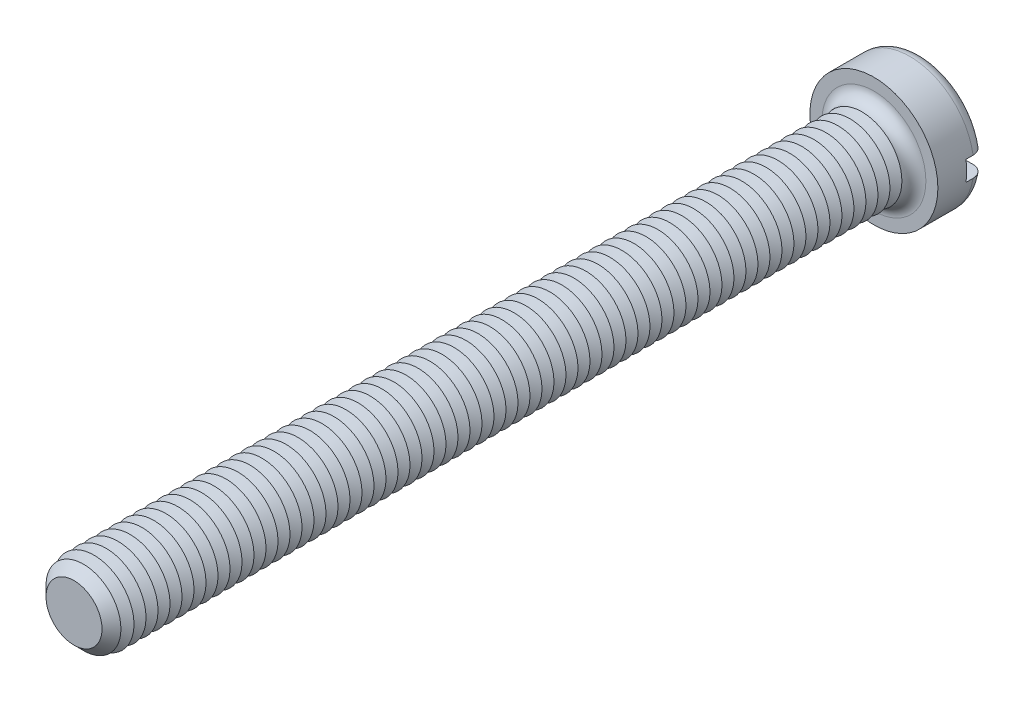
ISO-10303-21;
HEADER;
FILE_DESCRIPTION(('STEP AP214'),'2;1');
FILE_NAME('part.step','',(''),(''),'','','');
FILE_SCHEMA(('AUTOMOTIVE_DESIGN { 1 0 10303 214 1 1 1 1 }'));
ENDSEC;
DATA;
#1=APPLICATION_CONTEXT('core data for automotive mechanical design processes');
#2=APPLICATION_PROTOCOL_DEFINITION('international standard','automotive_design',2000,#1);
#3=PRODUCT_CONTEXT('',#1,'mechanical');
#4=PRODUCT('Part','Part','',(#3));
#5=PRODUCT_RELATED_PRODUCT_CATEGORY('part','',(#4));
#6=PRODUCT_DEFINITION_FORMATION('','',#4);
#7=PRODUCT_DEFINITION_CONTEXT('part definition',#1,'design');
#8=PRODUCT_DEFINITION('design','',#6,#7);
#9=PRODUCT_DEFINITION_SHAPE('','',#8);
#10=(LENGTH_UNIT() NAMED_UNIT(*) SI_UNIT(.MILLI.,.METRE.));
#11=(NAMED_UNIT(*) PLANE_ANGLE_UNIT() SI_UNIT($,.RADIAN.));
#12=(NAMED_UNIT(*) SI_UNIT($,.STERADIAN.) SOLID_ANGLE_UNIT());
#13=UNCERTAINTY_MEASURE_WITH_UNIT(LENGTH_MEASURE(1.E-05),#10,'distance_accuracy_value','');
#14=(GEOMETRIC_REPRESENTATION_CONTEXT(3) GLOBAL_UNCERTAINTY_ASSIGNED_CONTEXT((#13)) GLOBAL_UNIT_ASSIGNED_CONTEXT((#10,
#11,#12)) REPRESENTATION_CONTEXT('',''));
#15=CARTESIAN_POINT('',(0.,0.,0.));
#16=DIRECTION('',(0.,0.,1.));
#17=DIRECTION('',(1.,0.,0.));
#18=AXIS2_PLACEMENT_3D('',#15,#16,#17);
#19=CARTESIAN_POINT('',(0.,0.,-6.));
#20=DIRECTION('',(0.,0.,1.));
#21=DIRECTION('',(1.,0.,0.));
#22=AXIS2_PLACEMENT_3D('',#19,#20,#21);
#23=PLANE('',#22);
#24=CARTESIAN_POINT('',(0.,0.,-6.));
#25=DIRECTION('',(0.,0.,1.));
#26=DIRECTION('',(1.,0.,0.));
#27=AXIS2_PLACEMENT_3D('',#24,#25,#26);
#28=CIRCLE('',#27,6.5);
#29=CARTESIAN_POINT('',(-6.37867541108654,1.25,-6.));
#30=VERTEX_POINT('',#29);
#31=CARTESIAN_POINT('',(6.37867541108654,1.25,-6.));
#32=VERTEX_POINT('',#31);
#33=EDGE_CURVE('E115',#30,#32,#28,.F.);
#34=ORIENTED_EDGE('',*,*,#33,.T.);
#35=DIRECTION('',(1.,0.,0.));
#36=VECTOR('',#35,1.);
#37=CARTESIAN_POINT('',(-8.,1.25,-6.));
#38=LINE('',#37,#36);
#39=EDGE_CURVE('E110',#30,#32,#38,.T.);
#40=ORIENTED_EDGE('',*,*,#39,.F.);
#41=EDGE_LOOP('',(#34,#40));
#42=FACE_BOUND('',#41,.T.);
#43=ADVANCED_FACE('F38',(#42),#23,.F.);
#44=CARTESIAN_POINT('',(0.,0.,-4.5));
#45=DIRECTION('',(0.,0.,1.));
#46=DIRECTION('',(1.,0.,0.));
#47=AXIS2_PLACEMENT_3D('',#44,#45,#46);
#48=TOROIDAL_SURFACE('',#47,6.5,1.5);
#49=CARTESIAN_POINT('',(-7.63778128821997,1.25,-5.34492908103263));
#50=CARTESIAN_POINT('',(-7.58949199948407,1.25,-5.41482553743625));
#51=CARTESIAN_POINT('',(-7.53520056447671,1.25,-5.48065698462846));
#52=CARTESIAN_POINT('',(-7.41624971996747,1.25,-5.60228223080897));
#53=CARTESIAN_POINT('',(-7.35157642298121,1.25,-5.65806236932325));
#54=CARTESIAN_POINT('',(-7.21387612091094,1.25,-5.75795436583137));
#55=CARTESIAN_POINT('',(-7.14085828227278,1.25,-5.80207885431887));
#56=CARTESIAN_POINT('',(-6.98853766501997,1.25,-5.87758013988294));
#57=CARTESIAN_POINT('',(-6.90923642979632,1.25,-5.90896005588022));
#58=CARTESIAN_POINT('',(-6.74565677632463,1.25,-5.95849861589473));
#59=CARTESIAN_POINT('',(-6.66133328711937,1.25,-5.97650838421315));
#60=CARTESIAN_POINT('',(-6.49086565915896,1.25,-5.99833509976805));
#61=CARTESIAN_POINT('',(-6.40472129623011,1.25,-6.00215028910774));
#62=CARTESIAN_POINT('',(-6.23174891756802,1.25,-5.99550457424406));
#63=CARTESIAN_POINT('',(-6.14492874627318,1.25,-5.98483870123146));
#64=CARTESIAN_POINT('',(-5.97427268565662,1.25,-5.94920077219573));
#65=CARTESIAN_POINT('',(-5.89043699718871,1.25,-5.92422775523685));
#66=CARTESIAN_POINT('',(-5.72747580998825,1.25,-5.86041051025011));
#67=CARTESIAN_POINT('',(-5.64839123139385,1.25,-5.8214616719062));
#68=CARTESIAN_POINT('',(-5.49793182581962,1.25,-5.73076137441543));
#69=CARTESIAN_POINT('',(-5.42655700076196,1.25,-5.6790099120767));
#70=CARTESIAN_POINT('',(-5.29410028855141,1.25,-5.56444713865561));
#71=CARTESIAN_POINT('',(-5.23295591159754,1.25,-5.50170815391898));
#72=CARTESIAN_POINT('',(-5.12236155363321,1.25,-5.36664720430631));
#73=CARTESIAN_POINT('',(-5.07291010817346,1.25,-5.29432644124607));
#74=CARTESIAN_POINT('',(-4.98836421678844,1.25,-5.14389152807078));
#75=CARTESIAN_POINT('',(-4.95296843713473,1.25,-5.0659468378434));
#76=CARTESIAN_POINT('',(-4.89620356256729,1.25,-4.90510804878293));
#77=CARTESIAN_POINT('',(-4.87483169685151,1.25,-4.82221493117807));
#78=CARTESIAN_POINT('',(-4.8472995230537,1.25,-4.65636387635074));
#79=CARTESIAN_POINT('',(-4.84072446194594,1.25,-4.57347463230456));
#80=CARTESIAN_POINT('',(-4.84179430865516,1.25,-4.40779255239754));
#81=CARTESIAN_POINT('',(-4.84943782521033,1.25,-4.32499970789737));
#82=CARTESIAN_POINT('',(-4.87846819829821,1.25,-4.16301415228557));
#83=CARTESIAN_POINT('',(-4.89966978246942,1.25,-4.08378809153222));
#84=CARTESIAN_POINT('',(-4.95491528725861,1.25,-3.92995334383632));
#85=CARTESIAN_POINT('',(-4.98895983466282,1.25,-3.85534488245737));
#86=CARTESIAN_POINT('',(-5.06928242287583,1.25,-3.71183790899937));
#87=CARTESIAN_POINT('',(-5.11570495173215,1.25,-3.64302036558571));
#88=CARTESIAN_POINT('',(-5.21915370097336,1.25,-3.51388372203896));
#89=CARTESIAN_POINT('',(-5.27618132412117,1.25,-3.45356574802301));
#90=CARTESIAN_POINT('',(-5.40090076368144,1.25,-3.34137671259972));
#91=CARTESIAN_POINT('',(-5.46884305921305,1.25,-3.28978408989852));
#92=CARTESIAN_POINT('',(-5.61225757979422,1.25,-3.19841811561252));
#93=CARTESIAN_POINT('',(-5.68773079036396,1.25,-3.15864631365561));
#94=CARTESIAN_POINT('',(-5.84602026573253,1.25,-3.09111626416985));
#95=CARTESIAN_POINT('',(-5.92896901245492,1.25,-3.06366820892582));
#96=CARTESIAN_POINT('',(-6.09827849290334,1.25,-3.02294686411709));
#97=CARTESIAN_POINT('',(-6.18463944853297,1.25,-3.00967449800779));
#98=CARTESIAN_POINT('',(-6.35914138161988,1.25,-2.99765063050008));
#99=CARTESIAN_POINT('',(-6.4472913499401,1.25,-2.99902877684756));
#100=CARTESIAN_POINT('',(-6.62209547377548,1.25,-3.01665363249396));
#101=CARTESIAN_POINT('',(-6.70874965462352,1.25,-3.03290008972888));
#102=CARTESIAN_POINT('',(-6.87754008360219,1.25,-3.07975247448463));
#103=CARTESIAN_POINT('',(-6.95969991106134,1.25,-3.11027336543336));
#104=CARTESIAN_POINT('',(-7.11762200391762,1.25,-3.18486653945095));
#105=CARTESIAN_POINT('',(-7.19338469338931,1.25,-3.22893792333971));
#106=CARTESIAN_POINT('',(-7.33522754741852,1.25,-3.32873457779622));
#107=CARTESIAN_POINT('',(-7.40142768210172,1.25,-3.38428930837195));
#108=CARTESIAN_POINT('',(-7.52338344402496,1.25,-3.50587739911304));
#109=CARTESIAN_POINT('',(-7.5791399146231,1.25,-3.57190991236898));
#110=CARTESIAN_POINT('',(-7.67774856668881,1.25,-3.71151097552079));
#111=CARTESIAN_POINT('',(-7.72078137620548,1.25,-3.7849519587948));
#112=CARTESIAN_POINT('',(-7.79373860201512,1.25,-3.93807617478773));
#113=CARTESIAN_POINT('',(-7.82366445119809,1.25,-4.01775872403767));
#114=CARTESIAN_POINT('',(-7.86922494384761,1.25,-4.1801114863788));
#115=CARTESIAN_POINT('',(-7.88502105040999,1.25,-4.26273642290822));
#116=CARTESIAN_POINT('',(-7.90243332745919,1.25,-4.42948977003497));
#117=CARTESIAN_POINT('',(-7.90404643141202,1.25,-4.51361850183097));
#118=CARTESIAN_POINT('',(-7.89306914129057,1.25,-4.68049925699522));
#119=CARTESIAN_POINT('',(-7.88055163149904,1.25,-4.76325613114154));
#120=CARTESIAN_POINT('',(-7.84181179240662,1.25,-4.92542124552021));
#121=CARTESIAN_POINT('',(-7.81560657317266,1.25,-5.00483353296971));
#122=CARTESIAN_POINT('',(-7.76329893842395,1.25,-5.12766777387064));
#123=CARTESIAN_POINT('',(-7.74127773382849,1.25,-5.17287245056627));
#124=CARTESIAN_POINT('',(-7.69279783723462,1.25,-5.26083500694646));
#125=CARTESIAN_POINT('',(-7.66633917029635,1.25,-5.30359290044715));
#126=CARTESIAN_POINT('',(-7.63778128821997,1.25,-5.34492908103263));
#127=B_SPLINE_CURVE_WITH_KNOTS('',3,(#49,#50,#51,#52,#53,#54,#55,#56,#57,#58,#59,#60,#61,#62,
#63,#64,#65,#66,#67,#68,#69,#70,#71,#72,#73,#74,#75,#76,#77,#78,#79,#80,#81,#82,#83,#84,#85,#86,
#87,#88,#89,#90,#91,#92,#93,#94,#95,#96,#97,#98,#99,#100,#101,#102,#103,#104,#105,#106,#107,
#108,#109,#110,#111,#112,#113,#114,#115,#116,#117,#118,#119,#120,#121,#122,#123,#124,#125,#126),
.UNSPECIFIED.,.T.,.F.,(4,2,2,2,2,2,2,2,2,2,2,2,2,2,2,2,2,2,2,2,2,2,2,2,2,2,2,2,2,2,2,2,2,2,2,2,
2,2,4),(0.,0.254678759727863,0.509701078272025,0.764445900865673,1.01912834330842,
1.27660578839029,1.53411511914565,1.7953075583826,2.05651754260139,2.31972495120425,
2.58293242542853,2.84446831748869,3.10597143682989,3.36151874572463,3.61701554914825,
3.86525656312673,4.11347328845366,4.35836855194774,4.60327576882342,4.8511774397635,
5.0991119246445,5.35387584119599,5.60867314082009,5.86956650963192,6.13047687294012,
6.39369803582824,6.65691473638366,6.91858297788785,7.18023385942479,7.43824706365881,
7.69623942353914,7.95037087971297,8.20447454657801,8.45563599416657,8.70685174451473,
8.95677764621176,9.20639187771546,9.35700761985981,9.50762251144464),.UNSPECIFIED.);
#128=CARTESIAN_POINT('',(-7.90174031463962,1.25,-4.50000000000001));
#129=VERTEX_POINT('',#128);
#130=EDGE_CURVE('E704',#129,#30,#127,.T.);
#131=ORIENTED_EDGE('',*,*,#130,.F.);
#132=CARTESIAN_POINT('',(0.,0.,-4.5));
#133=DIRECTION('',(0.,0.,1.));
#134=DIRECTION('',(1.,0.,0.));
#135=AXIS2_PLACEMENT_3D('',#132,#133,#134);
#136=CIRCLE('',#135,8.);
#137=CARTESIAN_POINT('',(7.90174031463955,1.25,-4.5));
#138=VERTEX_POINT('',#137);
#139=EDGE_CURVE('E124',#138,#129,#136,.T.);
#140=ORIENTED_EDGE('',*,*,#139,.F.);
#141=CARTESIAN_POINT('',(4.95236709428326,1.25,-5.05808354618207));
#142=CARTESIAN_POINT('',(4.98477386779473,1.25,-5.13646278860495));
#143=CARTESIAN_POINT('',(5.02397623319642,1.25,-5.21210974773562));
#144=CARTESIAN_POINT('',(5.11464829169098,1.25,-5.35575180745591));
#145=CARTESIAN_POINT('',(5.16613670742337,1.25,-5.42373499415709));
#146=CARTESIAN_POINT('',(5.27963080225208,1.25,-5.55005899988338));
#147=CARTESIAN_POINT('',(5.34161871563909,1.25,-5.60841578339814));
#148=CARTESIAN_POINT('',(5.47431803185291,1.25,-5.71412381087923));
#149=CARTESIAN_POINT('',(5.545027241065,1.25,-5.76147781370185));
#150=CARTESIAN_POINT('',(5.69469818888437,1.25,-5.84486022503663));
#151=CARTESIAN_POINT('',(5.77379661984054,1.25,-5.88064336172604));
#152=CARTESIAN_POINT('',(5.93682776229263,1.25,-5.93863952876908));
#153=CARTESIAN_POINT('',(6.02076112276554,1.25,-5.96085073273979));
#154=CARTESIAN_POINT('',(6.19235911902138,1.25,-5.99130732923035));
#155=CARTESIAN_POINT('',(6.2800597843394,1.25,-5.99935025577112));
#156=CARTESIAN_POINT('',(6.45556807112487,1.25,-6.00057400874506));
#157=CARTESIAN_POINT('',(6.5433756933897,1.25,-5.99375472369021));
#158=CARTESIAN_POINT('',(6.71642471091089,1.25,-5.96539034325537));
#159=CARTESIAN_POINT('',(6.80167037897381,1.25,-5.94387137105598));
#160=CARTESIAN_POINT('',(6.96726399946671,1.25,-5.8866508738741));
#161=CARTESIAN_POINT('',(7.04761223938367,1.25,-5.85095018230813));
#162=CARTESIAN_POINT('',(7.2000703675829,1.25,-5.7668235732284));
#163=CARTESIAN_POINT('',(7.27226868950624,1.25,-5.71855796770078));
#164=CARTESIAN_POINT('',(7.40737382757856,1.25,-5.61041520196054));
#165=CARTESIAN_POINT('',(7.47028138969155,1.25,-5.55053897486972));
#166=CARTESIAN_POINT('',(7.5840004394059,1.25,-5.42185995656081));
#167=CARTESIAN_POINT('',(7.63498189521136,1.25,-5.35320736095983));
#168=CARTESIAN_POINT('',(7.72451646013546,1.25,-5.20822613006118));
#169=CARTESIAN_POINT('',(7.76307051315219,1.25,-5.13189807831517));
#170=CARTESIAN_POINT('',(7.82615156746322,1.25,-4.97479919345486));
#171=CARTESIAN_POINT('',(7.85085353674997,1.25,-4.89409858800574));
#172=CARTESIAN_POINT('',(7.88624162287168,1.25,-4.72968126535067));
#173=CARTESIAN_POINT('',(7.89692844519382,1.25,-4.64596470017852));
#174=CARTESIAN_POINT('',(7.90393395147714,1.25,-4.47857496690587));
#175=CARTESIAN_POINT('',(7.900361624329,1.25,-4.39490633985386));
#176=CARTESIAN_POINT('',(7.8792027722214,1.25,-4.2293620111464));
#177=CARTESIAN_POINT('',(7.86161649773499,1.25,-4.14748627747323));
#178=CARTESIAN_POINT('',(7.81298565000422,1.25,-3.98793539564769));
#179=CARTESIAN_POINT('',(7.78195585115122,1.25,-3.91025574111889));
#180=CARTESIAN_POINT('',(7.70736418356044,1.25,-3.76116938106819));
#181=CARTESIAN_POINT('',(7.66380211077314,1.25,-3.68976277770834));
#182=CARTESIAN_POINT('',(7.56515173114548,1.25,-3.55480889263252));
#183=CARTESIAN_POINT('',(7.51000119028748,1.25,-3.49130712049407));
#184=CARTESIAN_POINT('',(7.38992820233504,1.25,-3.3743390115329));
#185=CARTESIAN_POINT('',(7.32500529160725,1.25,-3.32087315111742));
#186=CARTESIAN_POINT('',(7.18646521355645,1.25,-3.22483712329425));
#187=CARTESIAN_POINT('',(7.11275872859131,1.25,-3.18239583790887));
#188=CARTESIAN_POINT('',(6.95934489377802,1.25,-3.11028530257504));
#189=CARTESIAN_POINT('',(6.87963710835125,1.25,-3.08061698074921));
#190=CARTESIAN_POINT('',(6.71523243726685,1.25,-3.03442872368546));
#191=CARTESIAN_POINT('',(6.63047940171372,1.25,-3.0181086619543));
#192=CARTESIAN_POINT('',(6.45944163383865,1.25,-2.99971307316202));
#193=CARTESIAN_POINT('',(6.37315677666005,1.25,-2.99763871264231));
#194=CARTESIAN_POINT('',(6.20021063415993,1.25,-3.00779604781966));
#195=CARTESIAN_POINT('',(6.11356117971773,1.25,-3.02022976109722));
#196=CARTESIAN_POINT('',(5.9435409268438,1.25,-3.0593597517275));
#197=CARTESIAN_POINT('',(5.86017035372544,1.25,-3.08605700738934));
#198=CARTESIAN_POINT('',(5.69848536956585,1.25,-3.15322746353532));
#199=CARTESIAN_POINT('',(5.62021039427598,1.25,-3.1937956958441));
#200=CARTESIAN_POINT('',(5.47164170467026,1.25,-3.28758816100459));
#201=CARTESIAN_POINT('',(5.40134797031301,1.25,-3.3408123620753));
#202=CARTESIAN_POINT('',(5.27136483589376,1.25,-3.45806317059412));
#203=CARTESIAN_POINT('',(5.21160120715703,1.25,-3.52200740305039));
#204=CARTESIAN_POINT('',(5.10396941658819,1.25,-3.65922833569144));
#205=CARTESIAN_POINT('',(5.05609917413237,1.25,-3.73250340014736));
#206=CARTESIAN_POINT('',(4.97487058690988,1.25,-3.8844714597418));
#207=CARTESIAN_POINT('',(4.94119529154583,1.25,-3.96299495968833));
#208=CARTESIAN_POINT('',(4.88793322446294,1.25,-4.12470694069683));
#209=CARTESIAN_POINT('',(4.86834741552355,1.25,-4.20789574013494));
#210=CARTESIAN_POINT('',(4.84433446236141,1.25,-4.3740749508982));
#211=CARTESIAN_POINT('',(4.83950391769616,1.25,-4.45700748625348));
#212=CARTESIAN_POINT('',(4.84404021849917,1.25,-4.62240731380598));
#213=CARTESIAN_POINT('',(4.85338770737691,1.25,-4.70487508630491));
#214=CARTESIAN_POINT('',(4.87895619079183,1.25,-4.83246978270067));
#215=CARTESIAN_POINT('',(4.89056704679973,1.25,-4.87856970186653));
#216=CARTESIAN_POINT('',(4.91819711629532,1.25,-4.96942661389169));
#217=CARTESIAN_POINT('',(4.93421619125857,1.25,-5.01418364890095));
#218=CARTESIAN_POINT('',(4.95236709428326,1.25,-5.05808354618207));
#219=B_SPLINE_CURVE_WITH_KNOTS('',3,(#141,#142,#143,#144,#145,#146,#147,#148,#149,#150,#151,
#152,#153,#154,#155,#156,#157,#158,#159,#160,#161,#162,#163,#164,#165,#166,#167,#168,#169,#170,
#171,#172,#173,#174,#175,#176,#177,#178,#179,#180,#181,#182,#183,#184,#185,#186,#187,#188,#189,
#190,#191,#192,#193,#194,#195,#196,#197,#198,#199,#200,#201,#202,#203,#204,#205,#206,#207,#208,
#209,#210,#211,#212,#213,#214,#215,#216,#217,#218),.UNSPECIFIED.,.T.,.F.,(4,2,2,2,2,2,2,2,2,2,2,
2,2,2,2,2,2,2,2,2,2,2,2,2,2,2,2,2,2,2,2,2,2,2,2,2,2,2,4),(0.,0.254263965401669,
0.508917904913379,0.763145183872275,1.01730864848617,1.27655188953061,1.53583000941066,
1.79878406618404,2.06174009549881,2.32423003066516,2.5867045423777,2.84598168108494,
3.10523799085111,3.36053725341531,3.61581712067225,3.8677953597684,4.11976091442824,
4.36980428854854,4.61984319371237,4.86960800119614,5.11937687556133,5.3705230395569,
5.62168112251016,5.87565515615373,6.12964764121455,6.38737709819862,6.64512765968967,
6.90651052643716,7.16791132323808,7.43114013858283,7.69436829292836,7.95565940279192,
8.21690477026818,8.47196060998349,8.72703387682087,8.97506819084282,9.22276418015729,
9.36518087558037,9.50759309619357),.UNSPECIFIED.);
#220=EDGE_CURVE('E706',#32,#138,#219,.T.);
#221=ORIENTED_EDGE('',*,*,#220,.F.);
#222=ORIENTED_EDGE('',*,*,#33,.F.);
#223=EDGE_LOOP('',(#131,#140,#221,#222));
#224=FACE_BOUND('',#223,.T.);
#225=ADVANCED_FACE('F688',(#224),#48,.T.);
#226=CARTESIAN_POINT('',(0.,0.,-6.));
#227=DIRECTION('',(0.,0.,1.));
#228=DIRECTION('',(1.,0.,0.));
#229=AXIS2_PLACEMENT_3D('',#226,#227,#228);
#230=CYLINDRICAL_SURFACE('',#229,8.);
#231=DIRECTION('',(0.,0.,1.));
#232=VECTOR('',#231,1.);
#233=CARTESIAN_POINT('',(7.90174031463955,1.25,-6.));
#234=LINE('',#233,#232);
#235=CARTESIAN_POINT('',(7.90174031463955,1.25,-3.6));
#236=VERTEX_POINT('',#235);
#237=EDGE_CURVE('E721',#138,#236,#234,.T.);
#238=ORIENTED_EDGE('',*,*,#237,.F.);
#239=ORIENTED_EDGE('',*,*,#139,.T.);
#240=DIRECTION('',(0.,0.,1.));
#241=VECTOR('',#240,1.);
#242=CARTESIAN_POINT('',(-7.90174031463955,1.25,-6.));
#243=LINE('',#242,#241);
#244=CARTESIAN_POINT('',(-7.90174031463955,1.25,-3.6));
#245=VERTEX_POINT('',#244);
#246=EDGE_CURVE('E62',#245,#129,#243,.F.);
#247=ORIENTED_EDGE('',*,*,#246,.F.);
#248=CARTESIAN_POINT('',(0.,0.,-3.6));
#249=DIRECTION('',(0.,0.,-1.));
#250=DIRECTION('',(-1.,0.,0.));
#251=AXIS2_PLACEMENT_3D('',#248,#249,#250);
#252=CIRCLE('',#251,8.);
#253=CARTESIAN_POINT('',(-7.90174031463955,-1.25,-3.6));
#254=VERTEX_POINT('',#253);
#255=EDGE_CURVE('E42',#245,#254,#252,.F.);
#256=ORIENTED_EDGE('',*,*,#255,.T.);
#257=DIRECTION('',(0.,0.,1.));
#258=VECTOR('',#257,1.);
#259=CARTESIAN_POINT('',(-7.90174031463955,-1.25,-6.));
#260=LINE('',#259,#258);
#261=CARTESIAN_POINT('',(-7.9017403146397,-1.25,-4.49999999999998));
#262=VERTEX_POINT('',#261);
#263=EDGE_CURVE('E719',#262,#254,#260,.T.);
#264=ORIENTED_EDGE('',*,*,#263,.F.);
#265=CARTESIAN_POINT('',(7.90174031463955,-1.25,-4.5));
#266=VERTEX_POINT('',#265);
#267=EDGE_CURVE('E126',#262,#266,#136,.T.);
#268=ORIENTED_EDGE('',*,*,#267,.T.);
#269=DIRECTION('',(0.,0.,1.));
#270=VECTOR('',#269,1.);
#271=CARTESIAN_POINT('',(7.90174031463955,-1.25,-6.));
#272=LINE('',#271,#270);
#273=CARTESIAN_POINT('',(7.90174031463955,-1.25,-3.6));
#274=VERTEX_POINT('',#273);
#275=EDGE_CURVE('E54',#274,#266,#272,.F.);
#276=ORIENTED_EDGE('',*,*,#275,.F.);
#277=EDGE_CURVE('E11',#274,#236,#252,.F.);
#278=ORIENTED_EDGE('',*,*,#277,.T.);
#279=EDGE_LOOP('',(#238,#239,#247,#256,#264,#268,#276,#278));
#280=FACE_BOUND('',#279,.T.);
#281=CARTESIAN_POINT('',(0.,0.,0.));
#282=DIRECTION('',(0.,0.,1.));
#283=DIRECTION('',(1.,0.,0.));
#284=AXIS2_PLACEMENT_3D('',#281,#282,#283);
#285=CIRCLE('',#284,8.);
#286=CARTESIAN_POINT('',(8.,0.,0.));
#287=VERTEX_POINT('',#286);
#288=EDGE_CURVE('E724',#287,#287,#285,.T.);
#289=ORIENTED_EDGE('',*,*,#288,.F.);
#290=EDGE_LOOP('',(#289));
#291=FACE_BOUND('',#290,.T.);
#292=ADVANCED_FACE('F684',(#280,#291),#230,.T.);
#293=CARTESIAN_POINT('',(6.37867541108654,-1.25,-6.));
#294=VERTEX_POINT('',#293);
#295=CARTESIAN_POINT('',(-6.37867541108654,-1.25,-6.));
#296=VERTEX_POINT('',#295);
#297=EDGE_CURVE('E108',#294,#296,#28,.F.);
#298=ORIENTED_EDGE('',*,*,#297,.T.);
#299=DIRECTION('',(-1.,0.,0.));
#300=VECTOR('',#299,1.);
#301=CARTESIAN_POINT('',(-8.,-1.25,-6.));
#302=LINE('',#301,#300);
#303=EDGE_CURVE('E95',#294,#296,#302,.T.);
#304=ORIENTED_EDGE('',*,*,#303,.F.);
#305=EDGE_LOOP('',(#298,#304));
#306=FACE_BOUND('',#305,.T.);
#307=ADVANCED_FACE('F107',(#306),#23,.F.);
#308=CARTESIAN_POINT('',(0.,0.,0.));
#309=DIRECTION('',(0.,0.,1.));
#310=DIRECTION('',(1.,0.,0.));
#311=AXIS2_PLACEMENT_3D('',#308,#309,#310);
#312=PLANE('',#311);
#313=CARTESIAN_POINT('',(0.,0.,0.));
#314=DIRECTION('',(0.,0.,1.));
#315=DIRECTION('',(1.,0.,0.));
#316=AXIS2_PLACEMENT_3D('',#313,#314,#315);
#317=CIRCLE('',#316,6.5);
#318=CARTESIAN_POINT('',(6.5,0.,0.));
#319=VERTEX_POINT('',#318);
#320=EDGE_CURVE('E114',#319,#319,#317,.F.);
#321=ORIENTED_EDGE('',*,*,#320,.T.);
#322=EDGE_LOOP('',(#321));
#323=FACE_BOUND('',#322,.T.);
#324=ORIENTED_EDGE('',*,*,#288,.T.);
#325=EDGE_LOOP('',(#324));
#326=FACE_BOUND('',#325,.T.);
#327=ADVANCED_FACE('F683',(#323,#326),#312,.T.);
#328=CARTESIAN_POINT('',(-7.63778128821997,-1.25,-5.34492908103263));
#329=CARTESIAN_POINT('',(-7.68527581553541,-1.25,-5.27616964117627));
#330=CARTESIAN_POINT('',(-7.72703224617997,-1.25,-5.20337764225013));
#331=CARTESIAN_POINT('',(-7.79778035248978,-1.25,-5.05176511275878));
#332=CARTESIAN_POINT('',(-7.82675823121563,-1.25,-4.97293817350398));
#333=CARTESIAN_POINT('',(-7.87103239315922,-1.25,-4.81153865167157));
#334=CARTESIAN_POINT('',(-7.8863313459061,-1.25,-4.72896680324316));
#335=CARTESIAN_POINT('',(-7.90278562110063,-1.25,-4.56244566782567));
#336=CARTESIAN_POINT('',(-7.90394420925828,-1.25,-4.4784967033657));
#337=CARTESIAN_POINT('',(-7.89211470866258,-1.25,-4.31190980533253));
#338=CARTESIAN_POINT('',(-7.87917806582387,-1.25,-4.22926821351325));
#339=CARTESIAN_POINT('',(-7.8396278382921,-1.25,-4.06732477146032));
#340=CARTESIAN_POINT('',(-7.81301388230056,-1.25,-3.98802301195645));
#341=CARTESIAN_POINT('',(-7.74686575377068,-1.25,-3.83490116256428));
#342=CARTESIAN_POINT('',(-7.70731700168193,-1.25,-3.76108737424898));
#343=CARTESIAN_POINT('',(-7.61647675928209,-1.25,-3.62108231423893));
#344=CARTESIAN_POINT('',(-7.56518496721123,-1.25,-3.55489123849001));
#345=CARTESIAN_POINT('',(-7.45192141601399,-1.25,-3.43145488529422));
#346=CARTESIAN_POINT('',(-7.3898717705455,-1.25,-3.37428109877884));
#347=CARTESIAN_POINT('',(-7.25715883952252,-1.25,-3.27100737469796));
#348=CARTESIAN_POINT('',(-7.18649507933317,-1.25,-3.22490804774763));
#349=CARTESIAN_POINT('',(-7.03760898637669,-1.25,-3.14445316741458));
#350=CARTESIAN_POINT('',(-6.95930204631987,-1.25,-3.1102542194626));
#351=CARTESIAN_POINT('',(-6.79811453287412,-1.25,-3.05526915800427));
#352=CARTESIAN_POINT('',(-6.71523359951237,-1.25,-3.03448410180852));
#353=CARTESIAN_POINT('',(-6.54591659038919,-1.25,-3.006592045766));
#354=CARTESIAN_POINT('',(-6.45944575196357,-1.25,-2.99969602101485));
#355=CARTESIAN_POINT('',(-6.28655568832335,-1.25,-3.00032465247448));
#356=CARTESIAN_POINT('',(-6.20013646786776,-1.25,-3.00785047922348));
#357=CARTESIAN_POINT('',(-6.02865505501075,-1.25,-3.03725742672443));
#358=CARTESIAN_POINT('',(-5.94362352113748,-1.25,-3.05931758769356));
#359=CARTESIAN_POINT('',(-5.77844448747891,-1.25,-3.11735373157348));
#360=CARTESIAN_POINT('',(-5.69829723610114,-1.25,-3.15333042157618));
#361=CARTESIAN_POINT('',(-5.54495924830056,-1.25,-3.23837037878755));
#362=CARTESIAN_POINT('',(-5.47178958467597,-1.25,-3.28747168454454));
#363=CARTESIAN_POINT('',(-5.33486536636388,-1.25,-3.39741183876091));
#364=CARTESIAN_POINT('',(-5.27111040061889,-1.25,-3.45825017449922));
#365=CARTESIAN_POINT('',(-5.15579778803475,-1.25,-3.58914722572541));
#366=CARTESIAN_POINT('',(-5.10409113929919,-1.25,-3.65907455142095));
#367=CARTESIAN_POINT('',(-5.01353659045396,-1.25,-3.8068142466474));
#368=CARTESIAN_POINT('',(-4.97468647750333,-1.25,-3.88462525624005));
#369=CARTESIAN_POINT('',(-4.91208858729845,-1.25,-4.04366636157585));
#370=CARTESIAN_POINT('',(-4.88795969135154,-1.25,-4.12474643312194));
#371=CARTESIAN_POINT('',(-4.85404909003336,-1.25,-4.28985038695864));
#372=CARTESIAN_POINT('',(-4.84426486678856,-1.25,-4.37387374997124));
#373=CARTESIAN_POINT('',(-4.83946276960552,-1.25,-4.54023897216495));
#374=CARTESIAN_POINT('',(-4.8440833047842,-1.25,-4.62257060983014));
#375=CARTESIAN_POINT('',(-4.86713763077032,-1.25,-4.78527148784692));
#376=CARTESIAN_POINT('',(-4.88557092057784,-1.25,-4.86564079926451));
#377=CARTESIAN_POINT('',(-4.9355229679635,-1.25,-5.02189555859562));
#378=CARTESIAN_POINT('',(-4.9669975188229,-1.25,-5.09779517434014));
#379=CARTESIAN_POINT('',(-5.04199393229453,-1.25,-5.24338322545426));
#380=CARTESIAN_POINT('',(-5.0855168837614,-1.25,-5.31307109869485));
#381=CARTESIAN_POINT('',(-5.1842754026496,-1.25,-5.44580979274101));
#382=CARTESIAN_POINT('',(-5.2397318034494,-1.25,-5.50869620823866));
#383=CARTESIAN_POINT('',(-5.36015301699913,-1.25,-5.62458635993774));
#384=CARTESIAN_POINT('',(-5.42511919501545,-1.25,-5.67758867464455));
#385=CARTESIAN_POINT('',(-5.56469412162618,-1.25,-5.7737610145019));
#386=CARTESIAN_POINT('',(-5.6395232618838,-1.25,-5.81661133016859));
#387=CARTESIAN_POINT('',(-5.79521544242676,-1.25,-5.8894110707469));
#388=CARTESIAN_POINT('',(-5.8760791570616,-1.25,-5.91935905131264));
#389=CARTESIAN_POINT('',(-6.04317815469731,-1.25,-5.9660059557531));
#390=CARTESIAN_POINT('',(-6.12948555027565,-1.25,-5.98244700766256));
#391=CARTESIAN_POINT('',(-6.30363462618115,-1.25,-6.00064866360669));
#392=CARTESIAN_POINT('',(-6.39147629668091,-1.25,-6.00240936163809));
#393=CARTESIAN_POINT('',(-6.5664192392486,-1.25,-5.9911248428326));
#394=CARTESIAN_POINT('',(-6.653518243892,-1.25,-5.9780442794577));
#395=CARTESIAN_POINT('',(-6.82426167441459,-1.25,-5.93729204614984));
#396=CARTESIAN_POINT('',(-6.90790538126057,-1.25,-5.90961735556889));
#397=CARTESIAN_POINT('',(-7.06846412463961,-1.25,-5.84071272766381));
#398=CARTESIAN_POINT('',(-7.14543542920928,-1.25,-5.79961377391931));
#399=CARTESIAN_POINT('',(-7.29116896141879,-1.25,-5.7049121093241));
#400=CARTESIAN_POINT('',(-7.35994165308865,-1.25,-5.65132560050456));
#401=CARTESIAN_POINT('',(-7.4636289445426,-1.25,-5.55509815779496));
#402=CARTESIAN_POINT('',(-7.50165191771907,-1.25,-5.51575032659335));
#403=CARTESIAN_POINT('',(-7.57319530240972,-1.25,-5.43315308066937));
#404=CARTESIAN_POINT('',(-7.60671575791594,-1.25,-5.38990370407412));
#405=CARTESIAN_POINT('',(-7.63778128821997,-1.25,-5.34492908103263));
#406=B_SPLINE_CURVE_WITH_KNOTS('',3,(#328,#329,#330,#331,#332,#333,#334,#335,#336,#337,#338,
#339,#340,#341,#342,#343,#344,#345,#346,#347,#348,#349,#350,#351,#352,#353,#354,#355,#356,#357,
#358,#359,#360,#361,#362,#363,#364,#365,#366,#367,#368,#369,#370,#371,#372,#373,#374,#375,#376,
#377,#378,#379,#380,#381,#382,#383,#384,#385,#386,#387,#388,#389,#390,#391,#392,#393,#394,#395,
#396,#397,#398,#399,#400,#401,#402,#403,#404,#405),.UNSPECIFIED.,.T.,.F.,(4,2,2,2,2,2,2,2,2,2,2,
2,2,2,2,2,2,2,2,2,2,2,2,2,2,2,2,2,2,2,2,2,2,2,2,2,2,2,4),(0.,0.250506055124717,0.50128192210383,
0.75200883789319,1.00267784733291,1.25243500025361,1.50219893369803,1.75224536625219,
2.00229822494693,2.25424343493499,2.50620253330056,2.76136198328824,3.0165415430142,
3.27556891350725,3.53461730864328,3.79691797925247,4.05923197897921,4.32231463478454,
4.5853858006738,4.84500678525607,5.10458306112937,5.3571172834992,5.60960717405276,
5.8558105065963,6.10200490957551,6.34737151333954,6.59276029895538,6.8431552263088,
7.09358613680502,7.35108485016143,7.60861238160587,7.87094926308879,8.13328446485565,
8.39624576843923,8.65926152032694,8.91978401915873,9.17997036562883,9.34382460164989,
9.50767723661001),.UNSPECIFIED.);
#407=EDGE_CURVE('E102',#296,#262,#406,.T.);
#408=ORIENTED_EDGE('',*,*,#407,.F.);
#409=ORIENTED_EDGE('',*,*,#297,.F.);
#410=CARTESIAN_POINT('',(4.95236709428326,-1.25,-5.05808354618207));
#411=CARTESIAN_POINT('',(4.92105512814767,-1.25,-4.98233216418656));
#412=CARTESIAN_POINT('',(4.89604361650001,-1.25,-4.90392040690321));
#413=CARTESIAN_POINT('',(4.85951223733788,-1.25,-4.74395758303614));
#414=CARTESIAN_POINT('',(4.8480045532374,-1.25,-4.66240375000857));
#415=CARTESIAN_POINT('',(4.83891469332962,-1.25,-4.49852199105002));
#416=CARTESIAN_POINT('',(4.84133145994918,-1.25,-4.41619412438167));
#417=CARTESIAN_POINT('',(4.8600038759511,-1.25,-4.25314313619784));
#418=CARTESIAN_POINT('',(4.87625705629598,-1.25,-4.17241973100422));
#419=CARTESIAN_POINT('',(4.92196554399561,-1.25,-4.01505032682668));
#420=CARTESIAN_POINT('',(4.95138456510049,-1.25,-3.93839376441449));
#421=CARTESIAN_POINT('',(5.02244158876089,-1.25,-3.79097367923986));
#422=CARTESIAN_POINT('',(5.06408092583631,-1.25,-3.72021080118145));
#423=CARTESIAN_POINT('',(5.15918188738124,-1.25,-3.5851203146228));
#424=CARTESIAN_POINT('',(5.21285223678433,-1.25,-3.5209397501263));
#425=CARTESIAN_POINT('',(5.32993512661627,-1.25,-3.40218700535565));
#426=CARTESIAN_POINT('',(5.39334903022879,-1.25,-3.34761617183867));
#427=CARTESIAN_POINT('',(5.5300552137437,-1.25,-3.24801679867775));
#428=CARTESIAN_POINT('',(5.60357647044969,-1.25,-3.20330242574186));
#429=CARTESIAN_POINT('',(5.75697062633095,-1.25,-3.1265687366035));
#430=CARTESIAN_POINT('',(5.83684424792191,-1.25,-3.09455086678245));
#431=CARTESIAN_POINT('',(6.00239031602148,-1.25,-3.04353393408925));
#432=CARTESIAN_POINT('',(6.08814636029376,-1.25,-3.02480570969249));
#433=CARTESIAN_POINT('',(6.26158564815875,-1.25,-3.00194915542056));
#434=CARTESIAN_POINT('',(6.34926896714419,-1.25,-2.997821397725));
#435=CARTESIAN_POINT('',(6.52441816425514,-1.25,-3.00435236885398));
#436=CARTESIAN_POINT('',(6.61188199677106,-1.25,-3.01506655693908));
#437=CARTESIAN_POINT('',(6.78373130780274,-1.25,-3.05116556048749));
#438=CARTESIAN_POINT('',(6.8681168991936,-1.25,-3.07654983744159));
#439=CARTESIAN_POINT('',(7.03056473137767,-1.25,-3.14105639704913));
#440=CARTESIAN_POINT('',(7.10867812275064,-1.25,-3.18004978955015));
#441=CARTESIAN_POINT('',(7.25711285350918,-1.25,-3.27078804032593));
#442=CARTESIAN_POINT('',(7.327434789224,-1.25,-3.32253192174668));
#443=CARTESIAN_POINT('',(7.45716954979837,-1.25,-3.4364775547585));
#444=CARTESIAN_POINT('',(7.51672925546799,-1.25,-3.49851206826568));
#445=CARTESIAN_POINT('',(7.62440498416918,-1.25,-3.63182557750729));
#446=CARTESIAN_POINT('',(7.67252193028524,-1.25,-3.70310382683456));
#447=CARTESIAN_POINT('',(7.75523498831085,-1.25,-3.8517825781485));
#448=CARTESIAN_POINT('',(7.79001407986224,-1.25,-3.92908131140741));
#449=CARTESIAN_POINT('',(7.84595474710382,-1.25,-4.08845836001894));
#450=CARTESIAN_POINT('',(7.86711715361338,-1.25,-4.1705363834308));
#451=CARTESIAN_POINT('',(7.89503817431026,-1.25,-4.33627683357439));
#452=CARTESIAN_POINT('',(7.90193595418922,-1.25,-4.41991584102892));
#453=CARTESIAN_POINT('',(7.90153623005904,-1.25,-4.58715860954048));
#454=CARTESIAN_POINT('',(7.89423915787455,-1.25,-4.67076237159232));
#455=CARTESIAN_POINT('',(7.86572271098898,-1.25,-4.83525080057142));
#456=CARTESIAN_POINT('',(7.84455307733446,-1.25,-4.91614410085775));
#457=CARTESIAN_POINT('',(7.78897430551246,-1.25,-5.0732444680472));
#458=CARTESIAN_POINT('',(7.75456511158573,-1.25,-5.1494515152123));
#459=CARTESIAN_POINT('',(7.67339923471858,-1.25,-5.29528903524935));
#460=CARTESIAN_POINT('',(7.62660424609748,-1.25,-5.36489817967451));
#461=CARTESIAN_POINT('',(7.52209201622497,-1.25,-5.49536318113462));
#462=CARTESIAN_POINT('',(7.4643743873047,-1.25,-5.55621872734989));
#463=CARTESIAN_POINT('',(7.33909994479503,-1.25,-5.66807257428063));
#464=CARTESIAN_POINT('',(7.27145672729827,-1.25,-5.71897407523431));
#465=CARTESIAN_POINT('',(7.12868060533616,-1.25,-5.80887807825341));
#466=CARTESIAN_POINT('',(7.0535472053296,-1.25,-5.84787979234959));
#467=CARTESIAN_POINT('',(6.89682225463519,-1.25,-5.91345911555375));
#468=CARTESIAN_POINT('',(6.81515596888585,-1.25,-5.93985808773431));
#469=CARTESIAN_POINT('',(6.64858434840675,-1.25,-5.97879449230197));
#470=CARTESIAN_POINT('',(6.56367874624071,-1.25,-5.99133077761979));
#471=CARTESIAN_POINT('',(6.39168259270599,-1.25,-6.00236627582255));
#472=CARTESIAN_POINT('',(6.30457835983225,-1.25,-6.00065255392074));
#473=CARTESIAN_POINT('',(6.13186422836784,-1.25,-5.98278857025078));
#474=CARTESIAN_POINT('',(6.04625438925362,-1.25,-5.96663773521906));
#475=CARTESIAN_POINT('',(5.87802521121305,-1.25,-5.92012173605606));
#476=CARTESIAN_POINT('',(5.79544617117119,-1.25,-5.88961066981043));
#477=CARTESIAN_POINT('',(5.63656223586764,-1.25,-5.81513349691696));
#478=CARTESIAN_POINT('',(5.56025908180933,-1.25,-5.77116367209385));
#479=CARTESIAN_POINT('',(5.4162607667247,-1.25,-5.67098882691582));
#480=CARTESIAN_POINT('',(5.34855795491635,-1.25,-5.61479480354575));
#481=CARTESIAN_POINT('',(5.22382615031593,-1.25,-5.49168804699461));
#482=CARTESIAN_POINT('',(5.16678340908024,-1.25,-5.42478932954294));
#483=CARTESIAN_POINT('',(5.08326589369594,-1.25,-5.30754811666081));
#484=CARTESIAN_POINT('',(5.05313168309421,-1.25,-5.25976959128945));
#485=CARTESIAN_POINT('',(4.99845900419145,-1.25,-5.16110869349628));
#486=CARTESIAN_POINT('',(4.9739204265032,-1.25,-5.11022638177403));
#487=CARTESIAN_POINT('',(4.95236709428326,-1.25,-5.05808354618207));
#488=B_SPLINE_CURVE_WITH_KNOTS('',3,(#410,#411,#412,#413,#414,#415,#416,#417,#418,#419,#420,
#421,#422,#423,#424,#425,#426,#427,#428,#429,#430,#431,#432,#433,#434,#435,#436,#437,#438,#439,
#440,#441,#442,#443,#444,#445,#446,#447,#448,#449,#450,#451,#452,#453,#454,#455,#456,#457,#458,
#459,#460,#461,#462,#463,#464,#465,#466,#467,#468,#469,#470,#471,#472,#473,#474,#475,#476,#477,
#478,#479,#480,#481,#482,#483,#484,#485,#486,#487),.UNSPECIFIED.,.T.,.F.,(4,2,2,2,2,2,2,2,2,2,2,
2,2,2,2,2,2,2,2,2,2,2,2,2,2,2,2,2,2,2,2,2,2,2,2,2,2,2,4),(0.,0.245701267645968,
0.491624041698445,0.737528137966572,0.983388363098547,1.22857510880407,1.47378864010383,
1.72364048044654,1.97352730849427,2.2304941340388,2.48749022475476,2.74958408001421,
3.01168820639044,3.27477437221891,3.53785088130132,3.79850056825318,4.05913029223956,
4.31587819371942,4.57260537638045,4.82567253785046,5.07872425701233,5.32929532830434,
5.57985877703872,5.8295286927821,6.07919966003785,6.32965199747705,6.58011322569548,
6.8329006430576,7.08570479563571,7.3419930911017,7.59830259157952,7.85844887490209,
8.11860548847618,8.38146435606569,8.64439590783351,8.90709189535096,9.16944670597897,
9.33857644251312,9.5077028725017),.UNSPECIFIED.);
#489=EDGE_CURVE('E91',#266,#294,#488,.T.);
#490=ORIENTED_EDGE('',*,*,#489,.F.);
#491=ORIENTED_EDGE('',*,*,#267,.F.);
#492=EDGE_LOOP('',(#408,#409,#490,#491));
#493=FACE_BOUND('',#492,.T.);
#494=ADVANCED_FACE('F112',(#493),#48,.T.);
#495=CARTESIAN_POINT('',(0.,0.,1.5));
#496=DIRECTION('',(0.,0.,1.));
#497=DIRECTION('',(1.,0.,0.));
#498=AXIS2_PLACEMENT_3D('',#495,#496,#497);
#499=TOROIDAL_SURFACE('',#498,6.5,1.5);
#500=ORIENTED_EDGE('',*,*,#320,.F.);
#501=EDGE_LOOP('',(#500));
#502=FACE_BOUND('',#501,.T.);
#503=CARTESIAN_POINT('',(0.,0.,1.5));
#504=DIRECTION('',(0.,0.,-1.));
#505=DIRECTION('',(-1.,0.,0.));
#506=AXIS2_PLACEMENT_3D('',#503,#504,#505);
#507=CIRCLE('',#506,5.);
#508=CARTESIAN_POINT('',(-5.,0.,1.5));
#509=VERTEX_POINT('',#508);
#510=EDGE_CURVE('E730',#509,#509,#507,.T.);
#511=ORIENTED_EDGE('',*,*,#510,.T.);
#512=EDGE_LOOP('',(#511));
#513=FACE_BOUND('',#512,.T.);
#514=ADVANCED_FACE('F676',(#502,#513),#499,.F.);
#515=CARTESIAN_POINT('',(0.,0.,2.25));
#516=DIRECTION('',(0.,0.,-1.));
#517=DIRECTION('',(-1.,0.,0.));
#518=AXIS2_PLACEMENT_3D('',#515,#516,#517);
#519=CONICAL_SURFACE('',#518,3.70096189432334,1.0471975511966);
#520=ORIENTED_EDGE('',*,*,#510,.F.);
#521=EDGE_LOOP('',(#520));
#522=FACE_BOUND('',#521,.T.);
#523=CARTESIAN_POINT('',(0.,0.,2.25));
#524=DIRECTION('',(0.,0.,-1.));
#525=DIRECTION('',(-1.,0.,0.));
#526=AXIS2_PLACEMENT_3D('',#523,#524,#525);
#527=CIRCLE('',#526,3.70096189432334);
#528=CARTESIAN_POINT('',(-3.70096189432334,0.,2.25));
#529=VERTEX_POINT('',#528);
#530=EDGE_CURVE('E737',#529,#529,#527,.T.);
#531=ORIENTED_EDGE('',*,*,#530,.T.);
#532=EDGE_LOOP('',(#531));
#533=FACE_BOUND('',#532,.T.);
#534=ADVANCED_FACE('F672',(#522,#533),#519,.T.);
#535=CARTESIAN_POINT('',(0.,0.,3.));
#536=DIRECTION('',(0.,0.,1.));
#537=DIRECTION('',(1.,0.,0.));
#538=AXIS2_PLACEMENT_3D('',#535,#536,#537);
#539=CONICAL_SURFACE('',#538,5.,1.0471975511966);
#540=ORIENTED_EDGE('',*,*,#530,.F.);
#541=EDGE_LOOP('',(#540));
#542=FACE_BOUND('',#541,.T.);
#543=CARTESIAN_POINT('',(0.,0.,3.));
#544=DIRECTION('',(0.,0.,-1.));
#545=DIRECTION('',(-1.,0.,0.));
#546=AXIS2_PLACEMENT_3D('',#543,#544,#545);
#547=CIRCLE('',#546,5.);
#548=CARTESIAN_POINT('',(-5.,0.,3.));
#549=VERTEX_POINT('',#548);
#550=EDGE_CURVE('E743',#549,#549,#547,.T.);
#551=ORIENTED_EDGE('',*,*,#550,.T.);
#552=EDGE_LOOP('',(#551));
#553=FACE_BOUND('',#552,.T.);
#554=ADVANCED_FACE('F668',(#542,#553),#539,.T.);
#555=CARTESIAN_POINT('',(0.,0.,3.75));
#556=DIRECTION('',(0.,0.,-1.));
#557=DIRECTION('',(-1.,0.,0.));
#558=AXIS2_PLACEMENT_3D('',#555,#556,#557);
#559=CONICAL_SURFACE('',#558,3.70096189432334,1.0471975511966);
#560=ORIENTED_EDGE('',*,*,#550,.F.);
#561=EDGE_LOOP('',(#560));
#562=FACE_BOUND('',#561,.T.);
#563=CARTESIAN_POINT('',(0.,0.,3.75));
#564=DIRECTION('',(0.,0.,-1.));
#565=DIRECTION('',(-1.,0.,0.));
#566=AXIS2_PLACEMENT_3D('',#563,#564,#565);
#567=CIRCLE('',#566,3.70096189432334);
#568=CARTESIAN_POINT('',(-3.70096189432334,0.,3.75));
#569=VERTEX_POINT('',#568);
#570=EDGE_CURVE('E747',#569,#569,#567,.T.);
#571=ORIENTED_EDGE('',*,*,#570,.T.);
#572=EDGE_LOOP('',(#571));
#573=FACE_BOUND('',#572,.T.);
#574=ADVANCED_FACE('F664',(#562,#573),#559,.T.);
#575=CARTESIAN_POINT('',(0.,0.,4.5));
#576=DIRECTION('',(0.,0.,1.));
#577=DIRECTION('',(1.,0.,0.));
#578=AXIS2_PLACEMENT_3D('',#575,#576,#577);
#579=CONICAL_SURFACE('',#578,5.,1.0471975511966);
#580=ORIENTED_EDGE('',*,*,#570,.F.);
#581=EDGE_LOOP('',(#580));
#582=FACE_BOUND('',#581,.T.);
#583=CARTESIAN_POINT('',(0.,0.,4.5));
#584=DIRECTION('',(0.,0.,-1.));
#585=DIRECTION('',(-1.,0.,0.));
#586=AXIS2_PLACEMENT_3D('',#583,#584,#585);
#587=CIRCLE('',#586,5.);
#588=CARTESIAN_POINT('',(-5.,0.,4.5));
#589=VERTEX_POINT('',#588);
#590=EDGE_CURVE('E751',#589,#589,#587,.T.);
#591=ORIENTED_EDGE('',*,*,#590,.T.);
#592=EDGE_LOOP('',(#591));
#593=FACE_BOUND('',#592,.T.);
#594=ADVANCED_FACE('F660',(#582,#593),#579,.T.);
#595=CARTESIAN_POINT('',(0.,0.,5.25));
#596=DIRECTION('',(0.,0.,-1.));
#597=DIRECTION('',(-1.,0.,0.));
#598=AXIS2_PLACEMENT_3D('',#595,#596,#597);
#599=CONICAL_SURFACE('',#598,3.70096189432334,1.0471975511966);
#600=ORIENTED_EDGE('',*,*,#590,.F.);
#601=EDGE_LOOP('',(#600));
#602=FACE_BOUND('',#601,.T.);
#603=CARTESIAN_POINT('',(0.,0.,5.25));
#604=DIRECTION('',(0.,0.,-1.));
#605=DIRECTION('',(-1.,0.,0.));
#606=AXIS2_PLACEMENT_3D('',#603,#604,#605);
#607=CIRCLE('',#606,3.70096189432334);
#608=CARTESIAN_POINT('',(-3.70096189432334,0.,5.25));
#609=VERTEX_POINT('',#608);
#610=EDGE_CURVE('E754',#609,#609,#607,.T.);
#611=ORIENTED_EDGE('',*,*,#610,.T.);
#612=EDGE_LOOP('',(#611));
#613=FACE_BOUND('',#612,.T.);
#614=ADVANCED_FACE('F656',(#602,#613),#599,.T.);
#615=CARTESIAN_POINT('',(0.,0.,6.));
#616=DIRECTION('',(0.,0.,1.));
#617=DIRECTION('',(1.,0.,0.));
#618=AXIS2_PLACEMENT_3D('',#615,#616,#617);
#619=CONICAL_SURFACE('',#618,5.,1.0471975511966);
#620=ORIENTED_EDGE('',*,*,#610,.F.);
#621=EDGE_LOOP('',(#620));
#622=FACE_BOUND('',#621,.T.);
#623=CARTESIAN_POINT('',(0.,0.,6.));
#624=DIRECTION('',(0.,0.,-1.));
#625=DIRECTION('',(-1.,0.,0.));
#626=AXIS2_PLACEMENT_3D('',#623,#624,#625);
#627=CIRCLE('',#626,5.);
#628=CARTESIAN_POINT('',(-5.,0.,6.));
#629=VERTEX_POINT('',#628);
#630=EDGE_CURVE('E758',#629,#629,#627,.T.);
#631=ORIENTED_EDGE('',*,*,#630,.T.);
#632=EDGE_LOOP('',(#631));
#633=FACE_BOUND('',#632,.T.);
#634=ADVANCED_FACE('F652',(#622,#633),#619,.T.);
#635=CARTESIAN_POINT('',(0.,0.,6.75));
#636=DIRECTION('',(0.,0.,-1.));
#637=DIRECTION('',(-1.,0.,0.));
#638=AXIS2_PLACEMENT_3D('',#635,#636,#637);
#639=CONICAL_SURFACE('',#638,3.70096189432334,1.0471975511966);
#640=ORIENTED_EDGE('',*,*,#630,.F.);
#641=EDGE_LOOP('',(#640));
#642=FACE_BOUND('',#641,.T.);
#643=CARTESIAN_POINT('',(0.,0.,6.75));
#644=DIRECTION('',(0.,0.,-1.));
#645=DIRECTION('',(-1.,0.,0.));
#646=AXIS2_PLACEMENT_3D('',#643,#644,#645);
#647=CIRCLE('',#646,3.70096189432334);
#648=CARTESIAN_POINT('',(-3.70096189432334,0.,6.75));
#649=VERTEX_POINT('',#648);
#650=EDGE_CURVE('E762',#649,#649,#647,.T.);
#651=ORIENTED_EDGE('',*,*,#650,.T.);
#652=EDGE_LOOP('',(#651));
#653=FACE_BOUND('',#652,.T.);
#654=ADVANCED_FACE('F648',(#642,#653),#639,.T.);
#655=CARTESIAN_POINT('',(0.,0.,7.5));
#656=DIRECTION('',(0.,0.,1.));
#657=DIRECTION('',(1.,0.,0.));
#658=AXIS2_PLACEMENT_3D('',#655,#656,#657);
#659=CONICAL_SURFACE('',#658,5.,1.0471975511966);
#660=ORIENTED_EDGE('',*,*,#650,.F.);
#661=EDGE_LOOP('',(#660));
#662=FACE_BOUND('',#661,.T.);
#663=CARTESIAN_POINT('',(0.,0.,7.5));
#664=DIRECTION('',(0.,0.,-1.));
#665=DIRECTION('',(-1.,0.,0.));
#666=AXIS2_PLACEMENT_3D('',#663,#664,#665);
#667=CIRCLE('',#666,5.);
#668=CARTESIAN_POINT('',(-5.,0.,7.5));
#669=VERTEX_POINT('',#668);
#670=EDGE_CURVE('E766',#669,#669,#667,.T.);
#671=ORIENTED_EDGE('',*,*,#670,.T.);
#672=EDGE_LOOP('',(#671));
#673=FACE_BOUND('',#672,.T.);
#674=ADVANCED_FACE('F644',(#662,#673),#659,.T.);
#675=CARTESIAN_POINT('',(0.,0.,8.25));
#676=DIRECTION('',(0.,0.,-1.));
#677=DIRECTION('',(-1.,0.,0.));
#678=AXIS2_PLACEMENT_3D('',#675,#676,#677);
#679=CONICAL_SURFACE('',#678,3.70096189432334,1.0471975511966);
#680=ORIENTED_EDGE('',*,*,#670,.F.);
#681=EDGE_LOOP('',(#680));
#682=FACE_BOUND('',#681,.T.);
#683=CARTESIAN_POINT('',(0.,0.,8.25));
#684=DIRECTION('',(0.,0.,-1.));
#685=DIRECTION('',(-1.,0.,0.));
#686=AXIS2_PLACEMENT_3D('',#683,#684,#685);
#687=CIRCLE('',#686,3.70096189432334);
#688=CARTESIAN_POINT('',(-3.70096189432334,0.,8.25));
#689=VERTEX_POINT('',#688);
#690=EDGE_CURVE('E770',#689,#689,#687,.T.);
#691=ORIENTED_EDGE('',*,*,#690,.T.);
#692=EDGE_LOOP('',(#691));
#693=FACE_BOUND('',#692,.T.);
#694=ADVANCED_FACE('F640',(#682,#693),#679,.T.);
#695=CARTESIAN_POINT('',(0.,0.,9.));
#696=DIRECTION('',(0.,0.,1.));
#697=DIRECTION('',(1.,0.,0.));
#698=AXIS2_PLACEMENT_3D('',#695,#696,#697);
#699=CONICAL_SURFACE('',#698,5.,1.0471975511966);
#700=ORIENTED_EDGE('',*,*,#690,.F.);
#701=EDGE_LOOP('',(#700));
#702=FACE_BOUND('',#701,.T.);
#703=CARTESIAN_POINT('',(0.,0.,9.));
#704=DIRECTION('',(0.,0.,-1.));
#705=DIRECTION('',(-1.,0.,0.));
#706=AXIS2_PLACEMENT_3D('',#703,#704,#705);
#707=CIRCLE('',#706,5.);
#708=CARTESIAN_POINT('',(-5.,0.,9.));
#709=VERTEX_POINT('',#708);
#710=EDGE_CURVE('E774',#709,#709,#707,.T.);
#711=ORIENTED_EDGE('',*,*,#710,.T.);
#712=EDGE_LOOP('',(#711));
#713=FACE_BOUND('',#712,.T.);
#714=ADVANCED_FACE('F636',(#702,#713),#699,.T.);
#715=CARTESIAN_POINT('',(0.,0.,9.75));
#716=DIRECTION('',(0.,0.,-1.));
#717=DIRECTION('',(-1.,0.,0.));
#718=AXIS2_PLACEMENT_3D('',#715,#716,#717);
#719=CONICAL_SURFACE('',#718,3.70096189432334,1.0471975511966);
#720=ORIENTED_EDGE('',*,*,#710,.F.);
#721=EDGE_LOOP('',(#720));
#722=FACE_BOUND('',#721,.T.);
#723=CARTESIAN_POINT('',(0.,0.,9.75));
#724=DIRECTION('',(0.,0.,-1.));
#725=DIRECTION('',(-1.,0.,0.));
#726=AXIS2_PLACEMENT_3D('',#723,#724,#725);
#727=CIRCLE('',#726,3.70096189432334);
#728=CARTESIAN_POINT('',(-3.70096189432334,0.,9.75));
#729=VERTEX_POINT('',#728);
#730=EDGE_CURVE('E778',#729,#729,#727,.T.);
#731=ORIENTED_EDGE('',*,*,#730,.T.);
#732=EDGE_LOOP('',(#731));
#733=FACE_BOUND('',#732,.T.);
#734=ADVANCED_FACE('F632',(#722,#733),#719,.T.);
#735=CARTESIAN_POINT('',(0.,0.,10.5));
#736=DIRECTION('',(0.,0.,1.));
#737=DIRECTION('',(1.,0.,0.));
#738=AXIS2_PLACEMENT_3D('',#735,#736,#737);
#739=CONICAL_SURFACE('',#738,5.,1.0471975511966);
#740=ORIENTED_EDGE('',*,*,#730,.F.);
#741=EDGE_LOOP('',(#740));
#742=FACE_BOUND('',#741,.T.);
#743=CARTESIAN_POINT('',(0.,0.,10.5));
#744=DIRECTION('',(0.,0.,-1.));
#745=DIRECTION('',(-1.,0.,0.));
#746=AXIS2_PLACEMENT_3D('',#743,#744,#745);
#747=CIRCLE('',#746,5.);
#748=CARTESIAN_POINT('',(-5.,0.,10.5));
#749=VERTEX_POINT('',#748);
#750=EDGE_CURVE('E782',#749,#749,#747,.T.);
#751=ORIENTED_EDGE('',*,*,#750,.T.);
#752=EDGE_LOOP('',(#751));
#753=FACE_BOUND('',#752,.T.);
#754=ADVANCED_FACE('F628',(#742,#753),#739,.T.);
#755=CARTESIAN_POINT('',(0.,0.,11.25));
#756=DIRECTION('',(0.,0.,-1.));
#757=DIRECTION('',(-1.,0.,0.));
#758=AXIS2_PLACEMENT_3D('',#755,#756,#757);
#759=CONICAL_SURFACE('',#758,3.70096189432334,1.0471975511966);
#760=ORIENTED_EDGE('',*,*,#750,.F.);
#761=EDGE_LOOP('',(#760));
#762=FACE_BOUND('',#761,.T.);
#763=CARTESIAN_POINT('',(0.,0.,11.25));
#764=DIRECTION('',(0.,0.,-1.));
#765=DIRECTION('',(-1.,0.,0.));
#766=AXIS2_PLACEMENT_3D('',#763,#764,#765);
#767=CIRCLE('',#766,3.70096189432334);
#768=CARTESIAN_POINT('',(-3.70096189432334,0.,11.25));
#769=VERTEX_POINT('',#768);
#770=EDGE_CURVE('E786',#769,#769,#767,.T.);
#771=ORIENTED_EDGE('',*,*,#770,.T.);
#772=EDGE_LOOP('',(#771));
#773=FACE_BOUND('',#772,.T.);
#774=ADVANCED_FACE('F624',(#762,#773),#759,.T.);
#775=CARTESIAN_POINT('',(0.,0.,12.));
#776=DIRECTION('',(0.,0.,1.));
#777=DIRECTION('',(1.,0.,0.));
#778=AXIS2_PLACEMENT_3D('',#775,#776,#777);
#779=CONICAL_SURFACE('',#778,5.,1.0471975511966);
#780=ORIENTED_EDGE('',*,*,#770,.F.);
#781=EDGE_LOOP('',(#780));
#782=FACE_BOUND('',#781,.T.);
#783=CARTESIAN_POINT('',(0.,0.,12.));
#784=DIRECTION('',(0.,0.,-1.));
#785=DIRECTION('',(-1.,0.,0.));
#786=AXIS2_PLACEMENT_3D('',#783,#784,#785);
#787=CIRCLE('',#786,5.);
#788=CARTESIAN_POINT('',(-5.,0.,12.));
#789=VERTEX_POINT('',#788);
#790=EDGE_CURVE('E789',#789,#789,#787,.T.);
#791=ORIENTED_EDGE('',*,*,#790,.T.);
#792=EDGE_LOOP('',(#791));
#793=FACE_BOUND('',#792,.T.);
#794=ADVANCED_FACE('F620',(#782,#793),#779,.T.);
#795=CARTESIAN_POINT('',(0.,0.,12.75));
#796=DIRECTION('',(0.,0.,-1.));
#797=DIRECTION('',(-1.,0.,0.));
#798=AXIS2_PLACEMENT_3D('',#795,#796,#797);
#799=CONICAL_SURFACE('',#798,3.70096189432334,1.0471975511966);
#800=ORIENTED_EDGE('',*,*,#790,.F.);
#801=EDGE_LOOP('',(#800));
#802=FACE_BOUND('',#801,.T.);
#803=CARTESIAN_POINT('',(0.,0.,12.75));
#804=DIRECTION('',(0.,0.,-1.));
#805=DIRECTION('',(-1.,0.,0.));
#806=AXIS2_PLACEMENT_3D('',#803,#804,#805);
#807=CIRCLE('',#806,3.70096189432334);
#808=CARTESIAN_POINT('',(-3.70096189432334,0.,12.75));
#809=VERTEX_POINT('',#808);
#810=EDGE_CURVE('E793',#809,#809,#807,.T.);
#811=ORIENTED_EDGE('',*,*,#810,.T.);
#812=EDGE_LOOP('',(#811));
#813=FACE_BOUND('',#812,.T.);
#814=ADVANCED_FACE('F616',(#802,#813),#799,.T.);
#815=CARTESIAN_POINT('',(0.,0.,13.5));
#816=DIRECTION('',(0.,0.,1.));
#817=DIRECTION('',(1.,0.,0.));
#818=AXIS2_PLACEMENT_3D('',#815,#816,#817);
#819=CONICAL_SURFACE('',#818,5.,1.0471975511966);
#820=ORIENTED_EDGE('',*,*,#810,.F.);
#821=EDGE_LOOP('',(#820));
#822=FACE_BOUND('',#821,.T.);
#823=CARTESIAN_POINT('',(0.,0.,13.5));
#824=DIRECTION('',(0.,0.,-1.));
#825=DIRECTION('',(-1.,0.,0.));
#826=AXIS2_PLACEMENT_3D('',#823,#824,#825);
#827=CIRCLE('',#826,5.);
#828=CARTESIAN_POINT('',(-5.,0.,13.5));
#829=VERTEX_POINT('',#828);
#830=EDGE_CURVE('E797',#829,#829,#827,.T.);
#831=ORIENTED_EDGE('',*,*,#830,.T.);
#832=EDGE_LOOP('',(#831));
#833=FACE_BOUND('',#832,.T.);
#834=ADVANCED_FACE('F612',(#822,#833),#819,.T.);
#835=CARTESIAN_POINT('',(0.,0.,14.25));
#836=DIRECTION('',(0.,0.,-1.));
#837=DIRECTION('',(-1.,0.,0.));
#838=AXIS2_PLACEMENT_3D('',#835,#836,#837);
#839=CONICAL_SURFACE('',#838,3.70096189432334,1.0471975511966);
#840=ORIENTED_EDGE('',*,*,#830,.F.);
#841=EDGE_LOOP('',(#840));
#842=FACE_BOUND('',#841,.T.);
#843=CARTESIAN_POINT('',(0.,0.,14.25));
#844=DIRECTION('',(0.,0.,-1.));
#845=DIRECTION('',(-1.,0.,0.));
#846=AXIS2_PLACEMENT_3D('',#843,#844,#845);
#847=CIRCLE('',#846,3.70096189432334);
#848=CARTESIAN_POINT('',(-3.70096189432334,0.,14.25));
#849=VERTEX_POINT('',#848);
#850=EDGE_CURVE('E800',#849,#849,#847,.T.);
#851=ORIENTED_EDGE('',*,*,#850,.T.);
#852=EDGE_LOOP('',(#851));
#853=FACE_BOUND('',#852,.T.);
#854=ADVANCED_FACE('F608',(#842,#853),#839,.T.);
#855=CARTESIAN_POINT('',(0.,0.,15.));
#856=DIRECTION('',(0.,0.,1.));
#857=DIRECTION('',(1.,0.,0.));
#858=AXIS2_PLACEMENT_3D('',#855,#856,#857);
#859=CONICAL_SURFACE('',#858,5.,1.0471975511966);
#860=ORIENTED_EDGE('',*,*,#850,.F.);
#861=EDGE_LOOP('',(#860));
#862=FACE_BOUND('',#861,.T.);
#863=CARTESIAN_POINT('',(0.,0.,15.));
#864=DIRECTION('',(0.,0.,-1.));
#865=DIRECTION('',(-1.,0.,0.));
#866=AXIS2_PLACEMENT_3D('',#863,#864,#865);
#867=CIRCLE('',#866,5.);
#868=CARTESIAN_POINT('',(-5.,0.,15.));
#869=VERTEX_POINT('',#868);
#870=EDGE_CURVE('E804',#869,#869,#867,.T.);
#871=ORIENTED_EDGE('',*,*,#870,.T.);
#872=EDGE_LOOP('',(#871));
#873=FACE_BOUND('',#872,.T.);
#874=ADVANCED_FACE('F604',(#862,#873),#859,.T.);
#875=CARTESIAN_POINT('',(0.,0.,15.75));
#876=DIRECTION('',(0.,0.,-1.));
#877=DIRECTION('',(-1.,0.,0.));
#878=AXIS2_PLACEMENT_3D('',#875,#876,#877);
#879=CONICAL_SURFACE('',#878,3.70096189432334,1.0471975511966);
#880=ORIENTED_EDGE('',*,*,#870,.F.);
#881=EDGE_LOOP('',(#880));
#882=FACE_BOUND('',#881,.T.);
#883=CARTESIAN_POINT('',(0.,0.,15.75));
#884=DIRECTION('',(0.,0.,-1.));
#885=DIRECTION('',(-1.,0.,0.));
#886=AXIS2_PLACEMENT_3D('',#883,#884,#885);
#887=CIRCLE('',#886,3.70096189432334);
#888=CARTESIAN_POINT('',(-3.70096189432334,0.,15.75));
#889=VERTEX_POINT('',#888);
#890=EDGE_CURVE('E807',#889,#889,#887,.T.);
#891=ORIENTED_EDGE('',*,*,#890,.T.);
#892=EDGE_LOOP('',(#891));
#893=FACE_BOUND('',#892,.T.);
#894=ADVANCED_FACE('F600',(#882,#893),#879,.T.);
#895=CARTESIAN_POINT('',(0.,0.,16.5));
#896=DIRECTION('',(0.,0.,1.));
#897=DIRECTION('',(1.,0.,0.));
#898=AXIS2_PLACEMENT_3D('',#895,#896,#897);
#899=CONICAL_SURFACE('',#898,5.,1.0471975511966);
#900=ORIENTED_EDGE('',*,*,#890,.F.);
#901=EDGE_LOOP('',(#900));
#902=FACE_BOUND('',#901,.T.);
#903=CARTESIAN_POINT('',(0.,0.,16.5));
#904=DIRECTION('',(0.,0.,-1.));
#905=DIRECTION('',(-1.,0.,0.));
#906=AXIS2_PLACEMENT_3D('',#903,#904,#905);
#907=CIRCLE('',#906,5.);
#908=CARTESIAN_POINT('',(-5.,0.,16.5));
#909=VERTEX_POINT('',#908);
#910=EDGE_CURVE('E811',#909,#909,#907,.T.);
#911=ORIENTED_EDGE('',*,*,#910,.T.);
#912=EDGE_LOOP('',(#911));
#913=FACE_BOUND('',#912,.T.);
#914=ADVANCED_FACE('F596',(#902,#913),#899,.T.);
#915=CARTESIAN_POINT('',(0.,0.,17.25));
#916=DIRECTION('',(0.,0.,-1.));
#917=DIRECTION('',(-1.,0.,0.));
#918=AXIS2_PLACEMENT_3D('',#915,#916,#917);
#919=CONICAL_SURFACE('',#918,3.70096189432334,1.0471975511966);
#920=ORIENTED_EDGE('',*,*,#910,.F.);
#921=EDGE_LOOP('',(#920));
#922=FACE_BOUND('',#921,.T.);
#923=CARTESIAN_POINT('',(0.,0.,17.25));
#924=DIRECTION('',(0.,0.,-1.));
#925=DIRECTION('',(-1.,0.,0.));
#926=AXIS2_PLACEMENT_3D('',#923,#924,#925);
#927=CIRCLE('',#926,3.70096189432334);
#928=CARTESIAN_POINT('',(-3.70096189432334,0.,17.25));
#929=VERTEX_POINT('',#928);
#930=EDGE_CURVE('E815',#929,#929,#927,.T.);
#931=ORIENTED_EDGE('',*,*,#930,.T.);
#932=EDGE_LOOP('',(#931));
#933=FACE_BOUND('',#932,.T.);
#934=ADVANCED_FACE('F592',(#922,#933),#919,.T.);
#935=CARTESIAN_POINT('',(0.,0.,18.));
#936=DIRECTION('',(0.,0.,1.));
#937=DIRECTION('',(1.,0.,0.));
#938=AXIS2_PLACEMENT_3D('',#935,#936,#937);
#939=CONICAL_SURFACE('',#938,5.,1.0471975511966);
#940=ORIENTED_EDGE('',*,*,#930,.F.);
#941=EDGE_LOOP('',(#940));
#942=FACE_BOUND('',#941,.T.);
#943=CARTESIAN_POINT('',(0.,0.,18.));
#944=DIRECTION('',(0.,0.,-1.));
#945=DIRECTION('',(-1.,0.,0.));
#946=AXIS2_PLACEMENT_3D('',#943,#944,#945);
#947=CIRCLE('',#946,5.);
#948=CARTESIAN_POINT('',(-5.,0.,18.));
#949=VERTEX_POINT('',#948);
#950=EDGE_CURVE('E819',#949,#949,#947,.T.);
#951=ORIENTED_EDGE('',*,*,#950,.T.);
#952=EDGE_LOOP('',(#951));
#953=FACE_BOUND('',#952,.T.);
#954=ADVANCED_FACE('F588',(#942,#953),#939,.T.);
#955=CARTESIAN_POINT('',(0.,0.,18.75));
#956=DIRECTION('',(0.,0.,-1.));
#957=DIRECTION('',(-1.,0.,0.));
#958=AXIS2_PLACEMENT_3D('',#955,#956,#957);
#959=CONICAL_SURFACE('',#958,3.70096189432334,1.0471975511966);
#960=ORIENTED_EDGE('',*,*,#950,.F.);
#961=EDGE_LOOP('',(#960));
#962=FACE_BOUND('',#961,.T.);
#963=CARTESIAN_POINT('',(0.,0.,18.75));
#964=DIRECTION('',(0.,0.,-1.));
#965=DIRECTION('',(-1.,0.,0.));
#966=AXIS2_PLACEMENT_3D('',#963,#964,#965);
#967=CIRCLE('',#966,3.70096189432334);
#968=CARTESIAN_POINT('',(-3.70096189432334,0.,18.75));
#969=VERTEX_POINT('',#968);
#970=EDGE_CURVE('E823',#969,#969,#967,.T.);
#971=ORIENTED_EDGE('',*,*,#970,.T.);
#972=EDGE_LOOP('',(#971));
#973=FACE_BOUND('',#972,.T.);
#974=ADVANCED_FACE('F584',(#962,#973),#959,.T.);
#975=CARTESIAN_POINT('',(0.,0.,19.5));
#976=DIRECTION('',(0.,0.,1.));
#977=DIRECTION('',(1.,0.,0.));
#978=AXIS2_PLACEMENT_3D('',#975,#976,#977);
#979=CONICAL_SURFACE('',#978,5.,1.0471975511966);
#980=ORIENTED_EDGE('',*,*,#970,.F.);
#981=EDGE_LOOP('',(#980));
#982=FACE_BOUND('',#981,.T.);
#983=CARTESIAN_POINT('',(0.,0.,19.5));
#984=DIRECTION('',(0.,0.,-1.));
#985=DIRECTION('',(-1.,0.,0.));
#986=AXIS2_PLACEMENT_3D('',#983,#984,#985);
#987=CIRCLE('',#986,5.);
#988=CARTESIAN_POINT('',(-5.,0.,19.5));
#989=VERTEX_POINT('',#988);
#990=EDGE_CURVE('E827',#989,#989,#987,.T.);
#991=ORIENTED_EDGE('',*,*,#990,.T.);
#992=EDGE_LOOP('',(#991));
#993=FACE_BOUND('',#992,.T.);
#994=ADVANCED_FACE('F580',(#982,#993),#979,.T.);
#995=CARTESIAN_POINT('',(0.,0.,20.25));
#996=DIRECTION('',(0.,0.,-1.));
#997=DIRECTION('',(-1.,0.,0.));
#998=AXIS2_PLACEMENT_3D('',#995,#996,#997);
#999=CONICAL_SURFACE('',#998,3.70096189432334,1.0471975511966);
#1000=ORIENTED_EDGE('',*,*,#990,.F.);
#1001=EDGE_LOOP('',(#1000));
#1002=FACE_BOUND('',#1001,.T.);
#1003=CARTESIAN_POINT('',(0.,0.,20.25));
#1004=DIRECTION('',(0.,0.,-1.));
#1005=DIRECTION('',(-1.,0.,0.));
#1006=AXIS2_PLACEMENT_3D('',#1003,#1004,#1005);
#1007=CIRCLE('',#1006,3.70096189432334);
#1008=CARTESIAN_POINT('',(-3.70096189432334,0.,20.25));
#1009=VERTEX_POINT('',#1008);
#1010=EDGE_CURVE('E831',#1009,#1009,#1007,.T.);
#1011=ORIENTED_EDGE('',*,*,#1010,.T.);
#1012=EDGE_LOOP('',(#1011));
#1013=FACE_BOUND('',#1012,.T.);
#1014=ADVANCED_FACE('F576',(#1002,#1013),#999,.T.);
#1015=CARTESIAN_POINT('',(0.,0.,21.));
#1016=DIRECTION('',(0.,0.,1.));
#1017=DIRECTION('',(1.,0.,0.));
#1018=AXIS2_PLACEMENT_3D('',#1015,#1016,#1017);
#1019=CONICAL_SURFACE('',#1018,5.,1.0471975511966);
#1020=ORIENTED_EDGE('',*,*,#1010,.F.);
#1021=EDGE_LOOP('',(#1020));
#1022=FACE_BOUND('',#1021,.T.);
#1023=CARTESIAN_POINT('',(0.,0.,21.));
#1024=DIRECTION('',(0.,0.,-1.));
#1025=DIRECTION('',(-1.,0.,0.));
#1026=AXIS2_PLACEMENT_3D('',#1023,#1024,#1025);
#1027=CIRCLE('',#1026,5.);
#1028=CARTESIAN_POINT('',(-5.,0.,21.));
#1029=VERTEX_POINT('',#1028);
#1030=EDGE_CURVE('E834',#1029,#1029,#1027,.T.);
#1031=ORIENTED_EDGE('',*,*,#1030,.T.);
#1032=EDGE_LOOP('',(#1031));
#1033=FACE_BOUND('',#1032,.T.);
#1034=ADVANCED_FACE('F572',(#1022,#1033),#1019,.T.);
#1035=CARTESIAN_POINT('',(0.,0.,21.75));
#1036=DIRECTION('',(0.,0.,-1.));
#1037=DIRECTION('',(-1.,0.,0.));
#1038=AXIS2_PLACEMENT_3D('',#1035,#1036,#1037);
#1039=CONICAL_SURFACE('',#1038,3.70096189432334,1.0471975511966);
#1040=ORIENTED_EDGE('',*,*,#1030,.F.);
#1041=EDGE_LOOP('',(#1040));
#1042=FACE_BOUND('',#1041,.T.);
#1043=CARTESIAN_POINT('',(0.,0.,21.75));
#1044=DIRECTION('',(0.,0.,-1.));
#1045=DIRECTION('',(-1.,0.,0.));
#1046=AXIS2_PLACEMENT_3D('',#1043,#1044,#1045);
#1047=CIRCLE('',#1046,3.70096189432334);
#1048=CARTESIAN_POINT('',(-3.70096189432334,0.,21.75));
#1049=VERTEX_POINT('',#1048);
#1050=EDGE_CURVE('E838',#1049,#1049,#1047,.T.);
#1051=ORIENTED_EDGE('',*,*,#1050,.T.);
#1052=EDGE_LOOP('',(#1051));
#1053=FACE_BOUND('',#1052,.T.);
#1054=ADVANCED_FACE('F568',(#1042,#1053),#1039,.T.);
#1055=CARTESIAN_POINT('',(0.,0.,22.5));
#1056=DIRECTION('',(0.,0.,1.));
#1057=DIRECTION('',(1.,0.,0.));
#1058=AXIS2_PLACEMENT_3D('',#1055,#1056,#1057);
#1059=CONICAL_SURFACE('',#1058,5.,1.0471975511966);
#1060=ORIENTED_EDGE('',*,*,#1050,.F.);
#1061=EDGE_LOOP('',(#1060));
#1062=FACE_BOUND('',#1061,.T.);
#1063=CARTESIAN_POINT('',(0.,0.,22.5));
#1064=DIRECTION('',(0.,0.,-1.));
#1065=DIRECTION('',(-1.,0.,0.));
#1066=AXIS2_PLACEMENT_3D('',#1063,#1064,#1065);
#1067=CIRCLE('',#1066,5.);
#1068=CARTESIAN_POINT('',(-5.,0.,22.5));
#1069=VERTEX_POINT('',#1068);
#1070=EDGE_CURVE('E842',#1069,#1069,#1067,.T.);
#1071=ORIENTED_EDGE('',*,*,#1070,.T.);
#1072=EDGE_LOOP('',(#1071));
#1073=FACE_BOUND('',#1072,.T.);
#1074=ADVANCED_FACE('F564',(#1062,#1073),#1059,.T.);
#1075=CARTESIAN_POINT('',(0.,0.,23.25));
#1076=DIRECTION('',(0.,0.,-1.));
#1077=DIRECTION('',(-1.,0.,0.));
#1078=AXIS2_PLACEMENT_3D('',#1075,#1076,#1077);
#1079=CONICAL_SURFACE('',#1078,3.70096189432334,1.0471975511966);
#1080=ORIENTED_EDGE('',*,*,#1070,.F.);
#1081=EDGE_LOOP('',(#1080));
#1082=FACE_BOUND('',#1081,.T.);
#1083=CARTESIAN_POINT('',(0.,0.,23.25));
#1084=DIRECTION('',(0.,0.,-1.));
#1085=DIRECTION('',(-1.,0.,0.));
#1086=AXIS2_PLACEMENT_3D('',#1083,#1084,#1085);
#1087=CIRCLE('',#1086,3.70096189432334);
#1088=CARTESIAN_POINT('',(-3.70096189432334,0.,23.25));
#1089=VERTEX_POINT('',#1088);
#1090=EDGE_CURVE('E846',#1089,#1089,#1087,.T.);
#1091=ORIENTED_EDGE('',*,*,#1090,.T.);
#1092=EDGE_LOOP('',(#1091));
#1093=FACE_BOUND('',#1092,.T.);
#1094=ADVANCED_FACE('F560',(#1082,#1093),#1079,.T.);
#1095=CARTESIAN_POINT('',(0.,0.,24.));
#1096=DIRECTION('',(0.,0.,1.));
#1097=DIRECTION('',(1.,0.,0.));
#1098=AXIS2_PLACEMENT_3D('',#1095,#1096,#1097);
#1099=CONICAL_SURFACE('',#1098,5.,1.0471975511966);
#1100=ORIENTED_EDGE('',*,*,#1090,.F.);
#1101=EDGE_LOOP('',(#1100));
#1102=FACE_BOUND('',#1101,.T.);
#1103=CARTESIAN_POINT('',(0.,0.,24.));
#1104=DIRECTION('',(0.,0.,-1.));
#1105=DIRECTION('',(-1.,0.,0.));
#1106=AXIS2_PLACEMENT_3D('',#1103,#1104,#1105);
#1107=CIRCLE('',#1106,5.);
#1108=CARTESIAN_POINT('',(-5.,0.,24.));
#1109=VERTEX_POINT('',#1108);
#1110=EDGE_CURVE('E850',#1109,#1109,#1107,.T.);
#1111=ORIENTED_EDGE('',*,*,#1110,.T.);
#1112=EDGE_LOOP('',(#1111));
#1113=FACE_BOUND('',#1112,.T.);
#1114=ADVANCED_FACE('F556',(#1102,#1113),#1099,.T.);
#1115=CARTESIAN_POINT('',(0.,0.,24.75));
#1116=DIRECTION('',(0.,0.,-1.));
#1117=DIRECTION('',(-1.,0.,0.));
#1118=AXIS2_PLACEMENT_3D('',#1115,#1116,#1117);
#1119=CONICAL_SURFACE('',#1118,3.70096189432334,1.0471975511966);
#1120=ORIENTED_EDGE('',*,*,#1110,.F.);
#1121=EDGE_LOOP('',(#1120));
#1122=FACE_BOUND('',#1121,.T.);
#1123=CARTESIAN_POINT('',(0.,0.,24.75));
#1124=DIRECTION('',(0.,0.,-1.));
#1125=DIRECTION('',(-1.,0.,0.));
#1126=AXIS2_PLACEMENT_3D('',#1123,#1124,#1125);
#1127=CIRCLE('',#1126,3.70096189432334);
#1128=CARTESIAN_POINT('',(-3.70096189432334,0.,24.75));
#1129=VERTEX_POINT('',#1128);
#1130=EDGE_CURVE('E854',#1129,#1129,#1127,.T.);
#1131=ORIENTED_EDGE('',*,*,#1130,.T.);
#1132=EDGE_LOOP('',(#1131));
#1133=FACE_BOUND('',#1132,.T.);
#1134=ADVANCED_FACE('F552',(#1122,#1133),#1119,.T.);
#1135=CARTESIAN_POINT('',(0.,0.,25.5));
#1136=DIRECTION('',(0.,0.,1.));
#1137=DIRECTION('',(1.,0.,0.));
#1138=AXIS2_PLACEMENT_3D('',#1135,#1136,#1137);
#1139=CONICAL_SURFACE('',#1138,5.,1.0471975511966);
#1140=ORIENTED_EDGE('',*,*,#1130,.F.);
#1141=EDGE_LOOP('',(#1140));
#1142=FACE_BOUND('',#1141,.T.);
#1143=CARTESIAN_POINT('',(0.,0.,25.5));
#1144=DIRECTION('',(0.,0.,-1.));
#1145=DIRECTION('',(-1.,0.,0.));
#1146=AXIS2_PLACEMENT_3D('',#1143,#1144,#1145);
#1147=CIRCLE('',#1146,5.);
#1148=CARTESIAN_POINT('',(-5.,0.,25.5));
#1149=VERTEX_POINT('',#1148);
#1150=EDGE_CURVE('E858',#1149,#1149,#1147,.T.);
#1151=ORIENTED_EDGE('',*,*,#1150,.T.);
#1152=EDGE_LOOP('',(#1151));
#1153=FACE_BOUND('',#1152,.T.);
#1154=ADVANCED_FACE('F548',(#1142,#1153),#1139,.T.);
#1155=CARTESIAN_POINT('',(0.,0.,26.25));
#1156=DIRECTION('',(0.,0.,-1.));
#1157=DIRECTION('',(-1.,0.,0.));
#1158=AXIS2_PLACEMENT_3D('',#1155,#1156,#1157);
#1159=CONICAL_SURFACE('',#1158,3.70096189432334,1.0471975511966);
#1160=ORIENTED_EDGE('',*,*,#1150,.F.);
#1161=EDGE_LOOP('',(#1160));
#1162=FACE_BOUND('',#1161,.T.);
#1163=CARTESIAN_POINT('',(0.,0.,26.25));
#1164=DIRECTION('',(0.,0.,-1.));
#1165=DIRECTION('',(-1.,0.,0.));
#1166=AXIS2_PLACEMENT_3D('',#1163,#1164,#1165);
#1167=CIRCLE('',#1166,3.70096189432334);
#1168=CARTESIAN_POINT('',(-3.70096189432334,0.,26.25));
#1169=VERTEX_POINT('',#1168);
#1170=EDGE_CURVE('E862',#1169,#1169,#1167,.T.);
#1171=ORIENTED_EDGE('',*,*,#1170,.T.);
#1172=EDGE_LOOP('',(#1171));
#1173=FACE_BOUND('',#1172,.T.);
#1174=ADVANCED_FACE('F544',(#1162,#1173),#1159,.T.);
#1175=CARTESIAN_POINT('',(0.,0.,27.));
#1176=DIRECTION('',(0.,0.,1.));
#1177=DIRECTION('',(1.,0.,0.));
#1178=AXIS2_PLACEMENT_3D('',#1175,#1176,#1177);
#1179=CONICAL_SURFACE('',#1178,5.,1.0471975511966);
#1180=ORIENTED_EDGE('',*,*,#1170,.F.);
#1181=EDGE_LOOP('',(#1180));
#1182=FACE_BOUND('',#1181,.T.);
#1183=CARTESIAN_POINT('',(0.,0.,27.));
#1184=DIRECTION('',(0.,0.,-1.));
#1185=DIRECTION('',(-1.,0.,0.));
#1186=AXIS2_PLACEMENT_3D('',#1183,#1184,#1185);
#1187=CIRCLE('',#1186,5.);
#1188=CARTESIAN_POINT('',(-5.,0.,27.));
#1189=VERTEX_POINT('',#1188);
#1190=EDGE_CURVE('E866',#1189,#1189,#1187,.T.);
#1191=ORIENTED_EDGE('',*,*,#1190,.T.);
#1192=EDGE_LOOP('',(#1191));
#1193=FACE_BOUND('',#1192,.T.);
#1194=ADVANCED_FACE('F540',(#1182,#1193),#1179,.T.);
#1195=CARTESIAN_POINT('',(0.,0.,27.75));
#1196=DIRECTION('',(0.,0.,-1.));
#1197=DIRECTION('',(-1.,0.,0.));
#1198=AXIS2_PLACEMENT_3D('',#1195,#1196,#1197);
#1199=CONICAL_SURFACE('',#1198,3.70096189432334,1.0471975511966);
#1200=ORIENTED_EDGE('',*,*,#1190,.F.);
#1201=EDGE_LOOP('',(#1200));
#1202=FACE_BOUND('',#1201,.T.);
#1203=CARTESIAN_POINT('',(0.,0.,27.75));
#1204=DIRECTION('',(0.,0.,-1.));
#1205=DIRECTION('',(-1.,0.,0.));
#1206=AXIS2_PLACEMENT_3D('',#1203,#1204,#1205);
#1207=CIRCLE('',#1206,3.70096189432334);
#1208=CARTESIAN_POINT('',(-3.70096189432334,0.,27.75));
#1209=VERTEX_POINT('',#1208);
#1210=EDGE_CURVE('E870',#1209,#1209,#1207,.T.);
#1211=ORIENTED_EDGE('',*,*,#1210,.T.);
#1212=EDGE_LOOP('',(#1211));
#1213=FACE_BOUND('',#1212,.T.);
#1214=ADVANCED_FACE('F536',(#1202,#1213),#1199,.T.);
#1215=CARTESIAN_POINT('',(0.,0.,28.5));
#1216=DIRECTION('',(0.,0.,1.));
#1217=DIRECTION('',(1.,0.,0.));
#1218=AXIS2_PLACEMENT_3D('',#1215,#1216,#1217);
#1219=CONICAL_SURFACE('',#1218,5.,1.0471975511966);
#1220=ORIENTED_EDGE('',*,*,#1210,.F.);
#1221=EDGE_LOOP('',(#1220));
#1222=FACE_BOUND('',#1221,.T.);
#1223=CARTESIAN_POINT('',(0.,0.,28.5));
#1224=DIRECTION('',(0.,0.,-1.));
#1225=DIRECTION('',(-1.,0.,0.));
#1226=AXIS2_PLACEMENT_3D('',#1223,#1224,#1225);
#1227=CIRCLE('',#1226,5.);
#1228=CARTESIAN_POINT('',(-5.,0.,28.5));
#1229=VERTEX_POINT('',#1228);
#1230=EDGE_CURVE('E874',#1229,#1229,#1227,.T.);
#1231=ORIENTED_EDGE('',*,*,#1230,.T.);
#1232=EDGE_LOOP('',(#1231));
#1233=FACE_BOUND('',#1232,.T.);
#1234=ADVANCED_FACE('F532',(#1222,#1233),#1219,.T.);
#1235=CARTESIAN_POINT('',(0.,0.,29.25));
#1236=DIRECTION('',(0.,0.,-1.));
#1237=DIRECTION('',(-1.,0.,0.));
#1238=AXIS2_PLACEMENT_3D('',#1235,#1236,#1237);
#1239=CONICAL_SURFACE('',#1238,3.70096189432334,1.0471975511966);
#1240=ORIENTED_EDGE('',*,*,#1230,.F.);
#1241=EDGE_LOOP('',(#1240));
#1242=FACE_BOUND('',#1241,.T.);
#1243=CARTESIAN_POINT('',(0.,0.,29.25));
#1244=DIRECTION('',(0.,0.,-1.));
#1245=DIRECTION('',(-1.,0.,0.));
#1246=AXIS2_PLACEMENT_3D('',#1243,#1244,#1245);
#1247=CIRCLE('',#1246,3.70096189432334);
#1248=CARTESIAN_POINT('',(-3.70096189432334,0.,29.25));
#1249=VERTEX_POINT('',#1248);
#1250=EDGE_CURVE('E878',#1249,#1249,#1247,.T.);
#1251=ORIENTED_EDGE('',*,*,#1250,.T.);
#1252=EDGE_LOOP('',(#1251));
#1253=FACE_BOUND('',#1252,.T.);
#1254=ADVANCED_FACE('F528',(#1242,#1253),#1239,.T.);
#1255=CARTESIAN_POINT('',(0.,0.,30.));
#1256=DIRECTION('',(0.,0.,1.));
#1257=DIRECTION('',(1.,0.,0.));
#1258=AXIS2_PLACEMENT_3D('',#1255,#1256,#1257);
#1259=CONICAL_SURFACE('',#1258,5.,1.0471975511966);
#1260=ORIENTED_EDGE('',*,*,#1250,.F.);
#1261=EDGE_LOOP('',(#1260));
#1262=FACE_BOUND('',#1261,.T.);
#1263=CARTESIAN_POINT('',(0.,0.,30.));
#1264=DIRECTION('',(0.,0.,-1.));
#1265=DIRECTION('',(-1.,0.,0.));
#1266=AXIS2_PLACEMENT_3D('',#1263,#1264,#1265);
#1267=CIRCLE('',#1266,5.);
#1268=CARTESIAN_POINT('',(-5.,0.,30.));
#1269=VERTEX_POINT('',#1268);
#1270=EDGE_CURVE('E882',#1269,#1269,#1267,.T.);
#1271=ORIENTED_EDGE('',*,*,#1270,.T.);
#1272=EDGE_LOOP('',(#1271));
#1273=FACE_BOUND('',#1272,.T.);
#1274=ADVANCED_FACE('F524',(#1262,#1273),#1259,.T.);
#1275=CARTESIAN_POINT('',(0.,0.,30.75));
#1276=DIRECTION('',(0.,0.,-1.));
#1277=DIRECTION('',(-1.,0.,0.));
#1278=AXIS2_PLACEMENT_3D('',#1275,#1276,#1277);
#1279=CONICAL_SURFACE('',#1278,3.70096189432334,1.0471975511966);
#1280=ORIENTED_EDGE('',*,*,#1270,.F.);
#1281=EDGE_LOOP('',(#1280));
#1282=FACE_BOUND('',#1281,.T.);
#1283=CARTESIAN_POINT('',(0.,0.,30.75));
#1284=DIRECTION('',(0.,0.,-1.));
#1285=DIRECTION('',(-1.,0.,0.));
#1286=AXIS2_PLACEMENT_3D('',#1283,#1284,#1285);
#1287=CIRCLE('',#1286,3.70096189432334);
#1288=CARTESIAN_POINT('',(-3.70096189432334,0.,30.75));
#1289=VERTEX_POINT('',#1288);
#1290=EDGE_CURVE('E886',#1289,#1289,#1287,.T.);
#1291=ORIENTED_EDGE('',*,*,#1290,.T.);
#1292=EDGE_LOOP('',(#1291));
#1293=FACE_BOUND('',#1292,.T.);
#1294=ADVANCED_FACE('F520',(#1282,#1293),#1279,.T.);
#1295=CARTESIAN_POINT('',(0.,0.,31.5));
#1296=DIRECTION('',(0.,0.,1.));
#1297=DIRECTION('',(1.,0.,0.));
#1298=AXIS2_PLACEMENT_3D('',#1295,#1296,#1297);
#1299=CONICAL_SURFACE('',#1298,5.,1.0471975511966);
#1300=ORIENTED_EDGE('',*,*,#1290,.F.);
#1301=EDGE_LOOP('',(#1300));
#1302=FACE_BOUND('',#1301,.T.);
#1303=CARTESIAN_POINT('',(0.,0.,31.5));
#1304=DIRECTION('',(0.,0.,-1.));
#1305=DIRECTION('',(-1.,0.,0.));
#1306=AXIS2_PLACEMENT_3D('',#1303,#1304,#1305);
#1307=CIRCLE('',#1306,5.);
#1308=CARTESIAN_POINT('',(-5.,0.,31.5));
#1309=VERTEX_POINT('',#1308);
#1310=EDGE_CURVE('E890',#1309,#1309,#1307,.T.);
#1311=ORIENTED_EDGE('',*,*,#1310,.T.);
#1312=EDGE_LOOP('',(#1311));
#1313=FACE_BOUND('',#1312,.T.);
#1314=ADVANCED_FACE('F516',(#1302,#1313),#1299,.T.);
#1315=CARTESIAN_POINT('',(0.,0.,32.25));
#1316=DIRECTION('',(0.,0.,-1.));
#1317=DIRECTION('',(-1.,0.,0.));
#1318=AXIS2_PLACEMENT_3D('',#1315,#1316,#1317);
#1319=CONICAL_SURFACE('',#1318,3.70096189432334,1.0471975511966);
#1320=ORIENTED_EDGE('',*,*,#1310,.F.);
#1321=EDGE_LOOP('',(#1320));
#1322=FACE_BOUND('',#1321,.T.);
#1323=CARTESIAN_POINT('',(0.,0.,32.25));
#1324=DIRECTION('',(0.,0.,-1.));
#1325=DIRECTION('',(-1.,0.,0.));
#1326=AXIS2_PLACEMENT_3D('',#1323,#1324,#1325);
#1327=CIRCLE('',#1326,3.70096189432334);
#1328=CARTESIAN_POINT('',(-3.70096189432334,0.,32.25));
#1329=VERTEX_POINT('',#1328);
#1330=EDGE_CURVE('E894',#1329,#1329,#1327,.T.);
#1331=ORIENTED_EDGE('',*,*,#1330,.T.);
#1332=EDGE_LOOP('',(#1331));
#1333=FACE_BOUND('',#1332,.T.);
#1334=ADVANCED_FACE('F512',(#1322,#1333),#1319,.T.);
#1335=CARTESIAN_POINT('',(0.,0.,33.));
#1336=DIRECTION('',(0.,0.,1.));
#1337=DIRECTION('',(1.,0.,0.));
#1338=AXIS2_PLACEMENT_3D('',#1335,#1336,#1337);
#1339=CONICAL_SURFACE('',#1338,5.,1.0471975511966);
#1340=ORIENTED_EDGE('',*,*,#1330,.F.);
#1341=EDGE_LOOP('',(#1340));
#1342=FACE_BOUND('',#1341,.T.);
#1343=CARTESIAN_POINT('',(0.,0.,33.));
#1344=DIRECTION('',(0.,0.,-1.));
#1345=DIRECTION('',(-1.,0.,0.));
#1346=AXIS2_PLACEMENT_3D('',#1343,#1344,#1345);
#1347=CIRCLE('',#1346,5.);
#1348=CARTESIAN_POINT('',(-5.,0.,33.));
#1349=VERTEX_POINT('',#1348);
#1350=EDGE_CURVE('E898',#1349,#1349,#1347,.T.);
#1351=ORIENTED_EDGE('',*,*,#1350,.T.);
#1352=EDGE_LOOP('',(#1351));
#1353=FACE_BOUND('',#1352,.T.);
#1354=ADVANCED_FACE('F508',(#1342,#1353),#1339,.T.);
#1355=CARTESIAN_POINT('',(0.,0.,33.75));
#1356=DIRECTION('',(0.,0.,-1.));
#1357=DIRECTION('',(-1.,0.,0.));
#1358=AXIS2_PLACEMENT_3D('',#1355,#1356,#1357);
#1359=CONICAL_SURFACE('',#1358,3.70096189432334,1.0471975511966);
#1360=ORIENTED_EDGE('',*,*,#1350,.F.);
#1361=EDGE_LOOP('',(#1360));
#1362=FACE_BOUND('',#1361,.T.);
#1363=CARTESIAN_POINT('',(0.,0.,33.75));
#1364=DIRECTION('',(0.,0.,-1.));
#1365=DIRECTION('',(-1.,0.,0.));
#1366=AXIS2_PLACEMENT_3D('',#1363,#1364,#1365);
#1367=CIRCLE('',#1366,3.70096189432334);
#1368=CARTESIAN_POINT('',(-3.70096189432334,0.,33.75));
#1369=VERTEX_POINT('',#1368);
#1370=EDGE_CURVE('E902',#1369,#1369,#1367,.T.);
#1371=ORIENTED_EDGE('',*,*,#1370,.T.);
#1372=EDGE_LOOP('',(#1371));
#1373=FACE_BOUND('',#1372,.T.);
#1374=ADVANCED_FACE('F504',(#1362,#1373),#1359,.T.);
#1375=CARTESIAN_POINT('',(0.,0.,34.5));
#1376=DIRECTION('',(0.,0.,1.));
#1377=DIRECTION('',(1.,0.,0.));
#1378=AXIS2_PLACEMENT_3D('',#1375,#1376,#1377);
#1379=CONICAL_SURFACE('',#1378,5.,1.0471975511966);
#1380=ORIENTED_EDGE('',*,*,#1370,.F.);
#1381=EDGE_LOOP('',(#1380));
#1382=FACE_BOUND('',#1381,.T.);
#1383=CARTESIAN_POINT('',(0.,0.,34.5));
#1384=DIRECTION('',(0.,0.,-1.));
#1385=DIRECTION('',(-1.,0.,0.));
#1386=AXIS2_PLACEMENT_3D('',#1383,#1384,#1385);
#1387=CIRCLE('',#1386,5.);
#1388=CARTESIAN_POINT('',(-5.,0.,34.5));
#1389=VERTEX_POINT('',#1388);
#1390=EDGE_CURVE('E906',#1389,#1389,#1387,.T.);
#1391=ORIENTED_EDGE('',*,*,#1390,.T.);
#1392=EDGE_LOOP('',(#1391));
#1393=FACE_BOUND('',#1392,.T.);
#1394=ADVANCED_FACE('F500',(#1382,#1393),#1379,.T.);
#1395=CARTESIAN_POINT('',(0.,0.,35.25));
#1396=DIRECTION('',(0.,0.,-1.));
#1397=DIRECTION('',(-1.,0.,0.));
#1398=AXIS2_PLACEMENT_3D('',#1395,#1396,#1397);
#1399=CONICAL_SURFACE('',#1398,3.70096189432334,1.0471975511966);
#1400=ORIENTED_EDGE('',*,*,#1390,.F.);
#1401=EDGE_LOOP('',(#1400));
#1402=FACE_BOUND('',#1401,.T.);
#1403=CARTESIAN_POINT('',(0.,0.,35.25));
#1404=DIRECTION('',(0.,0.,-1.));
#1405=DIRECTION('',(-1.,0.,0.));
#1406=AXIS2_PLACEMENT_3D('',#1403,#1404,#1405);
#1407=CIRCLE('',#1406,3.70096189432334);
#1408=CARTESIAN_POINT('',(-3.70096189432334,0.,35.25));
#1409=VERTEX_POINT('',#1408);
#1410=EDGE_CURVE('E910',#1409,#1409,#1407,.T.);
#1411=ORIENTED_EDGE('',*,*,#1410,.T.);
#1412=EDGE_LOOP('',(#1411));
#1413=FACE_BOUND('',#1412,.T.);
#1414=ADVANCED_FACE('F496',(#1402,#1413),#1399,.T.);
#1415=CARTESIAN_POINT('',(0.,0.,36.));
#1416=DIRECTION('',(0.,0.,1.));
#1417=DIRECTION('',(1.,0.,0.));
#1418=AXIS2_PLACEMENT_3D('',#1415,#1416,#1417);
#1419=CONICAL_SURFACE('',#1418,5.,1.0471975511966);
#1420=ORIENTED_EDGE('',*,*,#1410,.F.);
#1421=EDGE_LOOP('',(#1420));
#1422=FACE_BOUND('',#1421,.T.);
#1423=CARTESIAN_POINT('',(0.,0.,36.));
#1424=DIRECTION('',(0.,0.,-1.));
#1425=DIRECTION('',(-1.,0.,0.));
#1426=AXIS2_PLACEMENT_3D('',#1423,#1424,#1425);
#1427=CIRCLE('',#1426,5.);
#1428=CARTESIAN_POINT('',(-5.,0.,36.));
#1429=VERTEX_POINT('',#1428);
#1430=EDGE_CURVE('E914',#1429,#1429,#1427,.T.);
#1431=ORIENTED_EDGE('',*,*,#1430,.T.);
#1432=EDGE_LOOP('',(#1431));
#1433=FACE_BOUND('',#1432,.T.);
#1434=ADVANCED_FACE('F492',(#1422,#1433),#1419,.T.);
#1435=CARTESIAN_POINT('',(0.,0.,36.75));
#1436=DIRECTION('',(0.,0.,-1.));
#1437=DIRECTION('',(-1.,0.,0.));
#1438=AXIS2_PLACEMENT_3D('',#1435,#1436,#1437);
#1439=CONICAL_SURFACE('',#1438,3.70096189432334,1.0471975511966);
#1440=ORIENTED_EDGE('',*,*,#1430,.F.);
#1441=EDGE_LOOP('',(#1440));
#1442=FACE_BOUND('',#1441,.T.);
#1443=CARTESIAN_POINT('',(0.,0.,36.75));
#1444=DIRECTION('',(0.,0.,-1.));
#1445=DIRECTION('',(-1.,0.,0.));
#1446=AXIS2_PLACEMENT_3D('',#1443,#1444,#1445);
#1447=CIRCLE('',#1446,3.70096189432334);
#1448=CARTESIAN_POINT('',(-3.70096189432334,0.,36.75));
#1449=VERTEX_POINT('',#1448);
#1450=EDGE_CURVE('E918',#1449,#1449,#1447,.T.);
#1451=ORIENTED_EDGE('',*,*,#1450,.T.);
#1452=EDGE_LOOP('',(#1451));
#1453=FACE_BOUND('',#1452,.T.);
#1454=ADVANCED_FACE('F488',(#1442,#1453),#1439,.T.);
#1455=CARTESIAN_POINT('',(0.,0.,37.5));
#1456=DIRECTION('',(0.,0.,1.));
#1457=DIRECTION('',(1.,0.,0.));
#1458=AXIS2_PLACEMENT_3D('',#1455,#1456,#1457);
#1459=CONICAL_SURFACE('',#1458,5.,1.0471975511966);
#1460=ORIENTED_EDGE('',*,*,#1450,.F.);
#1461=EDGE_LOOP('',(#1460));
#1462=FACE_BOUND('',#1461,.T.);
#1463=CARTESIAN_POINT('',(0.,0.,37.5));
#1464=DIRECTION('',(0.,0.,-1.));
#1465=DIRECTION('',(-1.,0.,0.));
#1466=AXIS2_PLACEMENT_3D('',#1463,#1464,#1465);
#1467=CIRCLE('',#1466,5.);
#1468=CARTESIAN_POINT('',(-5.,0.,37.5));
#1469=VERTEX_POINT('',#1468);
#1470=EDGE_CURVE('E922',#1469,#1469,#1467,.T.);
#1471=ORIENTED_EDGE('',*,*,#1470,.T.);
#1472=EDGE_LOOP('',(#1471));
#1473=FACE_BOUND('',#1472,.T.);
#1474=ADVANCED_FACE('F484',(#1462,#1473),#1459,.T.);
#1475=CARTESIAN_POINT('',(0.,0.,38.25));
#1476=DIRECTION('',(0.,0.,-1.));
#1477=DIRECTION('',(-1.,0.,0.));
#1478=AXIS2_PLACEMENT_3D('',#1475,#1476,#1477);
#1479=CONICAL_SURFACE('',#1478,3.70096189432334,1.0471975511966);
#1480=ORIENTED_EDGE('',*,*,#1470,.F.);
#1481=EDGE_LOOP('',(#1480));
#1482=FACE_BOUND('',#1481,.T.);
#1483=CARTESIAN_POINT('',(0.,0.,38.25));
#1484=DIRECTION('',(0.,0.,-1.));
#1485=DIRECTION('',(-1.,0.,0.));
#1486=AXIS2_PLACEMENT_3D('',#1483,#1484,#1485);
#1487=CIRCLE('',#1486,3.70096189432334);
#1488=CARTESIAN_POINT('',(-3.70096189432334,0.,38.25));
#1489=VERTEX_POINT('',#1488);
#1490=EDGE_CURVE('E926',#1489,#1489,#1487,.T.);
#1491=ORIENTED_EDGE('',*,*,#1490,.T.);
#1492=EDGE_LOOP('',(#1491));
#1493=FACE_BOUND('',#1492,.T.);
#1494=ADVANCED_FACE('F480',(#1482,#1493),#1479,.T.);
#1495=CARTESIAN_POINT('',(0.,0.,39.));
#1496=DIRECTION('',(0.,0.,1.));
#1497=DIRECTION('',(1.,0.,0.));
#1498=AXIS2_PLACEMENT_3D('',#1495,#1496,#1497);
#1499=CONICAL_SURFACE('',#1498,5.,1.0471975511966);
#1500=ORIENTED_EDGE('',*,*,#1490,.F.);
#1501=EDGE_LOOP('',(#1500));
#1502=FACE_BOUND('',#1501,.T.);
#1503=CARTESIAN_POINT('',(0.,0.,39.));
#1504=DIRECTION('',(0.,0.,-1.));
#1505=DIRECTION('',(-1.,0.,0.));
#1506=AXIS2_PLACEMENT_3D('',#1503,#1504,#1505);
#1507=CIRCLE('',#1506,5.);
#1508=CARTESIAN_POINT('',(-5.,0.,39.));
#1509=VERTEX_POINT('',#1508);
#1510=EDGE_CURVE('E930',#1509,#1509,#1507,.T.);
#1511=ORIENTED_EDGE('',*,*,#1510,.T.);
#1512=EDGE_LOOP('',(#1511));
#1513=FACE_BOUND('',#1512,.T.);
#1514=ADVANCED_FACE('F476',(#1502,#1513),#1499,.T.);
#1515=CARTESIAN_POINT('',(0.,0.,39.75));
#1516=DIRECTION('',(0.,0.,-1.));
#1517=DIRECTION('',(-1.,0.,0.));
#1518=AXIS2_PLACEMENT_3D('',#1515,#1516,#1517);
#1519=CONICAL_SURFACE('',#1518,3.70096189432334,1.0471975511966);
#1520=ORIENTED_EDGE('',*,*,#1510,.F.);
#1521=EDGE_LOOP('',(#1520));
#1522=FACE_BOUND('',#1521,.T.);
#1523=CARTESIAN_POINT('',(0.,0.,39.75));
#1524=DIRECTION('',(0.,0.,-1.));
#1525=DIRECTION('',(-1.,0.,0.));
#1526=AXIS2_PLACEMENT_3D('',#1523,#1524,#1525);
#1527=CIRCLE('',#1526,3.70096189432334);
#1528=CARTESIAN_POINT('',(-3.70096189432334,0.,39.75));
#1529=VERTEX_POINT('',#1528);
#1530=EDGE_CURVE('E934',#1529,#1529,#1527,.T.);
#1531=ORIENTED_EDGE('',*,*,#1530,.T.);
#1532=EDGE_LOOP('',(#1531));
#1533=FACE_BOUND('',#1532,.T.);
#1534=ADVANCED_FACE('F472',(#1522,#1533),#1519,.T.);
#1535=CARTESIAN_POINT('',(0.,0.,40.5));
#1536=DIRECTION('',(0.,0.,1.));
#1537=DIRECTION('',(1.,0.,0.));
#1538=AXIS2_PLACEMENT_3D('',#1535,#1536,#1537);
#1539=CONICAL_SURFACE('',#1538,5.,1.0471975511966);
#1540=ORIENTED_EDGE('',*,*,#1530,.F.);
#1541=EDGE_LOOP('',(#1540));
#1542=FACE_BOUND('',#1541,.T.);
#1543=CARTESIAN_POINT('',(0.,0.,40.5));
#1544=DIRECTION('',(0.,0.,-1.));
#1545=DIRECTION('',(-1.,0.,0.));
#1546=AXIS2_PLACEMENT_3D('',#1543,#1544,#1545);
#1547=CIRCLE('',#1546,5.);
#1548=CARTESIAN_POINT('',(-5.,0.,40.5));
#1549=VERTEX_POINT('',#1548);
#1550=EDGE_CURVE('E938',#1549,#1549,#1547,.T.);
#1551=ORIENTED_EDGE('',*,*,#1550,.T.);
#1552=EDGE_LOOP('',(#1551));
#1553=FACE_BOUND('',#1552,.T.);
#1554=ADVANCED_FACE('F468',(#1542,#1553),#1539,.T.);
#1555=CARTESIAN_POINT('',(0.,0.,41.25));
#1556=DIRECTION('',(0.,0.,-1.));
#1557=DIRECTION('',(-1.,0.,0.));
#1558=AXIS2_PLACEMENT_3D('',#1555,#1556,#1557);
#1559=CONICAL_SURFACE('',#1558,3.70096189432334,1.0471975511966);
#1560=ORIENTED_EDGE('',*,*,#1550,.F.);
#1561=EDGE_LOOP('',(#1560));
#1562=FACE_BOUND('',#1561,.T.);
#1563=CARTESIAN_POINT('',(0.,0.,41.25));
#1564=DIRECTION('',(0.,0.,-1.));
#1565=DIRECTION('',(-1.,0.,0.));
#1566=AXIS2_PLACEMENT_3D('',#1563,#1564,#1565);
#1567=CIRCLE('',#1566,3.70096189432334);
#1568=CARTESIAN_POINT('',(-3.70096189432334,0.,41.25));
#1569=VERTEX_POINT('',#1568);
#1570=EDGE_CURVE('E942',#1569,#1569,#1567,.T.);
#1571=ORIENTED_EDGE('',*,*,#1570,.T.);
#1572=EDGE_LOOP('',(#1571));
#1573=FACE_BOUND('',#1572,.T.);
#1574=ADVANCED_FACE('F464',(#1562,#1573),#1559,.T.);
#1575=CARTESIAN_POINT('',(0.,0.,42.));
#1576=DIRECTION('',(0.,0.,1.));
#1577=DIRECTION('',(1.,0.,0.));
#1578=AXIS2_PLACEMENT_3D('',#1575,#1576,#1577);
#1579=CONICAL_SURFACE('',#1578,5.,1.0471975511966);
#1580=ORIENTED_EDGE('',*,*,#1570,.F.);
#1581=EDGE_LOOP('',(#1580));
#1582=FACE_BOUND('',#1581,.T.);
#1583=CARTESIAN_POINT('',(0.,0.,42.));
#1584=DIRECTION('',(0.,0.,-1.));
#1585=DIRECTION('',(-1.,0.,0.));
#1586=AXIS2_PLACEMENT_3D('',#1583,#1584,#1585);
#1587=CIRCLE('',#1586,5.);
#1588=CARTESIAN_POINT('',(-5.,0.,42.));
#1589=VERTEX_POINT('',#1588);
#1590=EDGE_CURVE('E946',#1589,#1589,#1587,.T.);
#1591=ORIENTED_EDGE('',*,*,#1590,.T.);
#1592=EDGE_LOOP('',(#1591));
#1593=FACE_BOUND('',#1592,.T.);
#1594=ADVANCED_FACE('F460',(#1582,#1593),#1579,.T.);
#1595=CARTESIAN_POINT('',(0.,0.,42.75));
#1596=DIRECTION('',(0.,0.,-1.));
#1597=DIRECTION('',(-1.,0.,0.));
#1598=AXIS2_PLACEMENT_3D('',#1595,#1596,#1597);
#1599=CONICAL_SURFACE('',#1598,3.70096189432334,1.0471975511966);
#1600=ORIENTED_EDGE('',*,*,#1590,.F.);
#1601=EDGE_LOOP('',(#1600));
#1602=FACE_BOUND('',#1601,.T.);
#1603=CARTESIAN_POINT('',(0.,0.,42.75));
#1604=DIRECTION('',(0.,0.,-1.));
#1605=DIRECTION('',(-1.,0.,0.));
#1606=AXIS2_PLACEMENT_3D('',#1603,#1604,#1605);
#1607=CIRCLE('',#1606,3.70096189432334);
#1608=CARTESIAN_POINT('',(-3.70096189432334,0.,42.75));
#1609=VERTEX_POINT('',#1608);
#1610=EDGE_CURVE('E950',#1609,#1609,#1607,.T.);
#1611=ORIENTED_EDGE('',*,*,#1610,.T.);
#1612=EDGE_LOOP('',(#1611));
#1613=FACE_BOUND('',#1612,.T.);
#1614=ADVANCED_FACE('F456',(#1602,#1613),#1599,.T.);
#1615=CARTESIAN_POINT('',(0.,0.,43.5));
#1616=DIRECTION('',(0.,0.,1.));
#1617=DIRECTION('',(1.,0.,0.));
#1618=AXIS2_PLACEMENT_3D('',#1615,#1616,#1617);
#1619=CONICAL_SURFACE('',#1618,5.,1.0471975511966);
#1620=ORIENTED_EDGE('',*,*,#1610,.F.);
#1621=EDGE_LOOP('',(#1620));
#1622=FACE_BOUND('',#1621,.T.);
#1623=CARTESIAN_POINT('',(0.,0.,43.5));
#1624=DIRECTION('',(0.,0.,-1.));
#1625=DIRECTION('',(-1.,0.,0.));
#1626=AXIS2_PLACEMENT_3D('',#1623,#1624,#1625);
#1627=CIRCLE('',#1626,5.);
#1628=CARTESIAN_POINT('',(-5.,0.,43.5));
#1629=VERTEX_POINT('',#1628);
#1630=EDGE_CURVE('E954',#1629,#1629,#1627,.T.);
#1631=ORIENTED_EDGE('',*,*,#1630,.T.);
#1632=EDGE_LOOP('',(#1631));
#1633=FACE_BOUND('',#1632,.T.);
#1634=ADVANCED_FACE('F452',(#1622,#1633),#1619,.T.);
#1635=CARTESIAN_POINT('',(0.,0.,44.25));
#1636=DIRECTION('',(0.,0.,-1.));
#1637=DIRECTION('',(-1.,0.,0.));
#1638=AXIS2_PLACEMENT_3D('',#1635,#1636,#1637);
#1639=CONICAL_SURFACE('',#1638,3.70096189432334,1.0471975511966);
#1640=ORIENTED_EDGE('',*,*,#1630,.F.);
#1641=EDGE_LOOP('',(#1640));
#1642=FACE_BOUND('',#1641,.T.);
#1643=CARTESIAN_POINT('',(0.,0.,44.25));
#1644=DIRECTION('',(0.,0.,-1.));
#1645=DIRECTION('',(-1.,0.,0.));
#1646=AXIS2_PLACEMENT_3D('',#1643,#1644,#1645);
#1647=CIRCLE('',#1646,3.70096189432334);
#1648=CARTESIAN_POINT('',(-3.70096189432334,0.,44.25));
#1649=VERTEX_POINT('',#1648);
#1650=EDGE_CURVE('E958',#1649,#1649,#1647,.T.);
#1651=ORIENTED_EDGE('',*,*,#1650,.T.);
#1652=EDGE_LOOP('',(#1651));
#1653=FACE_BOUND('',#1652,.T.);
#1654=ADVANCED_FACE('F448',(#1642,#1653),#1639,.T.);
#1655=CARTESIAN_POINT('',(0.,0.,45.));
#1656=DIRECTION('',(0.,0.,1.));
#1657=DIRECTION('',(1.,0.,0.));
#1658=AXIS2_PLACEMENT_3D('',#1655,#1656,#1657);
#1659=CONICAL_SURFACE('',#1658,5.,1.0471975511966);
#1660=ORIENTED_EDGE('',*,*,#1650,.F.);
#1661=EDGE_LOOP('',(#1660));
#1662=FACE_BOUND('',#1661,.T.);
#1663=CARTESIAN_POINT('',(0.,0.,45.));
#1664=DIRECTION('',(0.,0.,-1.));
#1665=DIRECTION('',(-1.,0.,0.));
#1666=AXIS2_PLACEMENT_3D('',#1663,#1664,#1665);
#1667=CIRCLE('',#1666,5.);
#1668=CARTESIAN_POINT('',(-5.,0.,45.));
#1669=VERTEX_POINT('',#1668);
#1670=EDGE_CURVE('E962',#1669,#1669,#1667,.T.);
#1671=ORIENTED_EDGE('',*,*,#1670,.T.);
#1672=EDGE_LOOP('',(#1671));
#1673=FACE_BOUND('',#1672,.T.);
#1674=ADVANCED_FACE('F444',(#1662,#1673),#1659,.T.);
#1675=CARTESIAN_POINT('',(0.,0.,45.75));
#1676=DIRECTION('',(0.,0.,-1.));
#1677=DIRECTION('',(-1.,0.,0.));
#1678=AXIS2_PLACEMENT_3D('',#1675,#1676,#1677);
#1679=CONICAL_SURFACE('',#1678,3.70096189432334,1.0471975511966);
#1680=ORIENTED_EDGE('',*,*,#1670,.F.);
#1681=EDGE_LOOP('',(#1680));
#1682=FACE_BOUND('',#1681,.T.);
#1683=CARTESIAN_POINT('',(0.,0.,45.75));
#1684=DIRECTION('',(0.,0.,-1.));
#1685=DIRECTION('',(-1.,0.,0.));
#1686=AXIS2_PLACEMENT_3D('',#1683,#1684,#1685);
#1687=CIRCLE('',#1686,3.70096189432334);
#1688=CARTESIAN_POINT('',(-3.70096189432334,0.,45.75));
#1689=VERTEX_POINT('',#1688);
#1690=EDGE_CURVE('E966',#1689,#1689,#1687,.T.);
#1691=ORIENTED_EDGE('',*,*,#1690,.T.);
#1692=EDGE_LOOP('',(#1691));
#1693=FACE_BOUND('',#1692,.T.);
#1694=ADVANCED_FACE('F440',(#1682,#1693),#1679,.T.);
#1695=CARTESIAN_POINT('',(0.,0.,46.5));
#1696=DIRECTION('',(0.,0.,1.));
#1697=DIRECTION('',(1.,0.,0.));
#1698=AXIS2_PLACEMENT_3D('',#1695,#1696,#1697);
#1699=CONICAL_SURFACE('',#1698,5.,1.0471975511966);
#1700=ORIENTED_EDGE('',*,*,#1690,.F.);
#1701=EDGE_LOOP('',(#1700));
#1702=FACE_BOUND('',#1701,.T.);
#1703=CARTESIAN_POINT('',(0.,0.,46.5));
#1704=DIRECTION('',(0.,0.,-1.));
#1705=DIRECTION('',(-1.,0.,0.));
#1706=AXIS2_PLACEMENT_3D('',#1703,#1704,#1705);
#1707=CIRCLE('',#1706,5.);
#1708=CARTESIAN_POINT('',(-5.,0.,46.5));
#1709=VERTEX_POINT('',#1708);
#1710=EDGE_CURVE('E970',#1709,#1709,#1707,.T.);
#1711=ORIENTED_EDGE('',*,*,#1710,.T.);
#1712=EDGE_LOOP('',(#1711));
#1713=FACE_BOUND('',#1712,.T.);
#1714=ADVANCED_FACE('F436',(#1702,#1713),#1699,.T.);
#1715=CARTESIAN_POINT('',(0.,0.,47.25));
#1716=DIRECTION('',(0.,0.,-1.));
#1717=DIRECTION('',(-1.,0.,0.));
#1718=AXIS2_PLACEMENT_3D('',#1715,#1716,#1717);
#1719=CONICAL_SURFACE('',#1718,3.70096189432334,1.0471975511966);
#1720=ORIENTED_EDGE('',*,*,#1710,.F.);
#1721=EDGE_LOOP('',(#1720));
#1722=FACE_BOUND('',#1721,.T.);
#1723=CARTESIAN_POINT('',(0.,0.,47.25));
#1724=DIRECTION('',(0.,0.,-1.));
#1725=DIRECTION('',(-1.,0.,0.));
#1726=AXIS2_PLACEMENT_3D('',#1723,#1724,#1725);
#1727=CIRCLE('',#1726,3.70096189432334);
#1728=CARTESIAN_POINT('',(-3.70096189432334,0.,47.25));
#1729=VERTEX_POINT('',#1728);
#1730=EDGE_CURVE('E974',#1729,#1729,#1727,.T.);
#1731=ORIENTED_EDGE('',*,*,#1730,.T.);
#1732=EDGE_LOOP('',(#1731));
#1733=FACE_BOUND('',#1732,.T.);
#1734=ADVANCED_FACE('F432',(#1722,#1733),#1719,.T.);
#1735=CARTESIAN_POINT('',(0.,0.,48.));
#1736=DIRECTION('',(0.,0.,1.));
#1737=DIRECTION('',(1.,0.,0.));
#1738=AXIS2_PLACEMENT_3D('',#1735,#1736,#1737);
#1739=CONICAL_SURFACE('',#1738,5.,1.0471975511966);
#1740=ORIENTED_EDGE('',*,*,#1730,.F.);
#1741=EDGE_LOOP('',(#1740));
#1742=FACE_BOUND('',#1741,.T.);
#1743=CARTESIAN_POINT('',(0.,0.,48.));
#1744=DIRECTION('',(0.,0.,-1.));
#1745=DIRECTION('',(-1.,0.,0.));
#1746=AXIS2_PLACEMENT_3D('',#1743,#1744,#1745);
#1747=CIRCLE('',#1746,5.);
#1748=CARTESIAN_POINT('',(-5.,0.,48.));
#1749=VERTEX_POINT('',#1748);
#1750=EDGE_CURVE('E978',#1749,#1749,#1747,.T.);
#1751=ORIENTED_EDGE('',*,*,#1750,.T.);
#1752=EDGE_LOOP('',(#1751));
#1753=FACE_BOUND('',#1752,.T.);
#1754=ADVANCED_FACE('F428',(#1742,#1753),#1739,.T.);
#1755=CARTESIAN_POINT('',(0.,0.,48.75));
#1756=DIRECTION('',(0.,0.,-1.));
#1757=DIRECTION('',(-1.,0.,0.));
#1758=AXIS2_PLACEMENT_3D('',#1755,#1756,#1757);
#1759=CONICAL_SURFACE('',#1758,3.70096189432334,1.0471975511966);
#1760=ORIENTED_EDGE('',*,*,#1750,.F.);
#1761=EDGE_LOOP('',(#1760));
#1762=FACE_BOUND('',#1761,.T.);
#1763=CARTESIAN_POINT('',(0.,0.,48.75));
#1764=DIRECTION('',(0.,0.,-1.));
#1765=DIRECTION('',(-1.,0.,0.));
#1766=AXIS2_PLACEMENT_3D('',#1763,#1764,#1765);
#1767=CIRCLE('',#1766,3.70096189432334);
#1768=CARTESIAN_POINT('',(-3.70096189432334,0.,48.75));
#1769=VERTEX_POINT('',#1768);
#1770=EDGE_CURVE('E982',#1769,#1769,#1767,.T.);
#1771=ORIENTED_EDGE('',*,*,#1770,.T.);
#1772=EDGE_LOOP('',(#1771));
#1773=FACE_BOUND('',#1772,.T.);
#1774=ADVANCED_FACE('F424',(#1762,#1773),#1759,.T.);
#1775=CARTESIAN_POINT('',(0.,0.,49.5));
#1776=DIRECTION('',(0.,0.,1.));
#1777=DIRECTION('',(1.,0.,0.));
#1778=AXIS2_PLACEMENT_3D('',#1775,#1776,#1777);
#1779=CONICAL_SURFACE('',#1778,5.,1.0471975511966);
#1780=ORIENTED_EDGE('',*,*,#1770,.F.);
#1781=EDGE_LOOP('',(#1780));
#1782=FACE_BOUND('',#1781,.T.);
#1783=CARTESIAN_POINT('',(0.,0.,49.5));
#1784=DIRECTION('',(0.,0.,-1.));
#1785=DIRECTION('',(-1.,0.,0.));
#1786=AXIS2_PLACEMENT_3D('',#1783,#1784,#1785);
#1787=CIRCLE('',#1786,5.);
#1788=CARTESIAN_POINT('',(-5.,0.,49.5));
#1789=VERTEX_POINT('',#1788);
#1790=EDGE_CURVE('E986',#1789,#1789,#1787,.T.);
#1791=ORIENTED_EDGE('',*,*,#1790,.T.);
#1792=EDGE_LOOP('',(#1791));
#1793=FACE_BOUND('',#1792,.T.);
#1794=ADVANCED_FACE('F420',(#1782,#1793),#1779,.T.);
#1795=CARTESIAN_POINT('',(0.,0.,50.25));
#1796=DIRECTION('',(0.,0.,-1.));
#1797=DIRECTION('',(-1.,0.,0.));
#1798=AXIS2_PLACEMENT_3D('',#1795,#1796,#1797);
#1799=CONICAL_SURFACE('',#1798,3.70096189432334,1.0471975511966);
#1800=ORIENTED_EDGE('',*,*,#1790,.F.);
#1801=EDGE_LOOP('',(#1800));
#1802=FACE_BOUND('',#1801,.T.);
#1803=CARTESIAN_POINT('',(0.,0.,50.25));
#1804=DIRECTION('',(0.,0.,-1.));
#1805=DIRECTION('',(-1.,0.,0.));
#1806=AXIS2_PLACEMENT_3D('',#1803,#1804,#1805);
#1807=CIRCLE('',#1806,3.70096189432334);
#1808=CARTESIAN_POINT('',(-3.70096189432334,0.,50.25));
#1809=VERTEX_POINT('',#1808);
#1810=EDGE_CURVE('E990',#1809,#1809,#1807,.T.);
#1811=ORIENTED_EDGE('',*,*,#1810,.T.);
#1812=EDGE_LOOP('',(#1811));
#1813=FACE_BOUND('',#1812,.T.);
#1814=ADVANCED_FACE('F416',(#1802,#1813),#1799,.T.);
#1815=CARTESIAN_POINT('',(0.,0.,51.));
#1816=DIRECTION('',(0.,0.,1.));
#1817=DIRECTION('',(1.,0.,0.));
#1818=AXIS2_PLACEMENT_3D('',#1815,#1816,#1817);
#1819=CONICAL_SURFACE('',#1818,5.,1.0471975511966);
#1820=ORIENTED_EDGE('',*,*,#1810,.F.);
#1821=EDGE_LOOP('',(#1820));
#1822=FACE_BOUND('',#1821,.T.);
#1823=CARTESIAN_POINT('',(0.,0.,51.));
#1824=DIRECTION('',(0.,0.,-1.));
#1825=DIRECTION('',(-1.,0.,0.));
#1826=AXIS2_PLACEMENT_3D('',#1823,#1824,#1825);
#1827=CIRCLE('',#1826,5.);
#1828=CARTESIAN_POINT('',(-5.,0.,51.));
#1829=VERTEX_POINT('',#1828);
#1830=EDGE_CURVE('E994',#1829,#1829,#1827,.T.);
#1831=ORIENTED_EDGE('',*,*,#1830,.T.);
#1832=EDGE_LOOP('',(#1831));
#1833=FACE_BOUND('',#1832,.T.);
#1834=ADVANCED_FACE('F412',(#1822,#1833),#1819,.T.);
#1835=CARTESIAN_POINT('',(0.,0.,51.75));
#1836=DIRECTION('',(0.,0.,-1.));
#1837=DIRECTION('',(-1.,0.,0.));
#1838=AXIS2_PLACEMENT_3D('',#1835,#1836,#1837);
#1839=CONICAL_SURFACE('',#1838,3.70096189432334,1.0471975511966);
#1840=ORIENTED_EDGE('',*,*,#1830,.F.);
#1841=EDGE_LOOP('',(#1840));
#1842=FACE_BOUND('',#1841,.T.);
#1843=CARTESIAN_POINT('',(0.,0.,51.75));
#1844=DIRECTION('',(0.,0.,-1.));
#1845=DIRECTION('',(-1.,0.,0.));
#1846=AXIS2_PLACEMENT_3D('',#1843,#1844,#1845);
#1847=CIRCLE('',#1846,3.70096189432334);
#1848=CARTESIAN_POINT('',(-3.70096189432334,0.,51.75));
#1849=VERTEX_POINT('',#1848);
#1850=EDGE_CURVE('E998',#1849,#1849,#1847,.T.);
#1851=ORIENTED_EDGE('',*,*,#1850,.T.);
#1852=EDGE_LOOP('',(#1851));
#1853=FACE_BOUND('',#1852,.T.);
#1854=ADVANCED_FACE('F408',(#1842,#1853),#1839,.T.);
#1855=CARTESIAN_POINT('',(0.,0.,52.5));
#1856=DIRECTION('',(0.,0.,1.));
#1857=DIRECTION('',(1.,0.,0.));
#1858=AXIS2_PLACEMENT_3D('',#1855,#1856,#1857);
#1859=CONICAL_SURFACE('',#1858,5.,1.0471975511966);
#1860=ORIENTED_EDGE('',*,*,#1850,.F.);
#1861=EDGE_LOOP('',(#1860));
#1862=FACE_BOUND('',#1861,.T.);
#1863=CARTESIAN_POINT('',(0.,0.,52.5));
#1864=DIRECTION('',(0.,0.,-1.));
#1865=DIRECTION('',(-1.,0.,0.));
#1866=AXIS2_PLACEMENT_3D('',#1863,#1864,#1865);
#1867=CIRCLE('',#1866,5.);
#1868=CARTESIAN_POINT('',(-5.,0.,52.5));
#1869=VERTEX_POINT('',#1868);
#1870=EDGE_CURVE('E1002',#1869,#1869,#1867,.T.);
#1871=ORIENTED_EDGE('',*,*,#1870,.T.);
#1872=EDGE_LOOP('',(#1871));
#1873=FACE_BOUND('',#1872,.T.);
#1874=ADVANCED_FACE('F404',(#1862,#1873),#1859,.T.);
#1875=CARTESIAN_POINT('',(0.,0.,53.25));
#1876=DIRECTION('',(0.,0.,-1.));
#1877=DIRECTION('',(-1.,0.,0.));
#1878=AXIS2_PLACEMENT_3D('',#1875,#1876,#1877);
#1879=CONICAL_SURFACE('',#1878,3.70096189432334,1.0471975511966);
#1880=ORIENTED_EDGE('',*,*,#1870,.F.);
#1881=EDGE_LOOP('',(#1880));
#1882=FACE_BOUND('',#1881,.T.);
#1883=CARTESIAN_POINT('',(0.,0.,53.25));
#1884=DIRECTION('',(0.,0.,-1.));
#1885=DIRECTION('',(-1.,0.,0.));
#1886=AXIS2_PLACEMENT_3D('',#1883,#1884,#1885);
#1887=CIRCLE('',#1886,3.70096189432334);
#1888=CARTESIAN_POINT('',(-3.70096189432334,0.,53.25));
#1889=VERTEX_POINT('',#1888);
#1890=EDGE_CURVE('E1006',#1889,#1889,#1887,.T.);
#1891=ORIENTED_EDGE('',*,*,#1890,.T.);
#1892=EDGE_LOOP('',(#1891));
#1893=FACE_BOUND('',#1892,.T.);
#1894=ADVANCED_FACE('F400',(#1882,#1893),#1879,.T.);
#1895=CARTESIAN_POINT('',(0.,0.,54.));
#1896=DIRECTION('',(0.,0.,1.));
#1897=DIRECTION('',(1.,0.,0.));
#1898=AXIS2_PLACEMENT_3D('',#1895,#1896,#1897);
#1899=CONICAL_SURFACE('',#1898,5.,1.0471975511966);
#1900=ORIENTED_EDGE('',*,*,#1890,.F.);
#1901=EDGE_LOOP('',(#1900));
#1902=FACE_BOUND('',#1901,.T.);
#1903=CARTESIAN_POINT('',(0.,0.,54.));
#1904=DIRECTION('',(0.,0.,-1.));
#1905=DIRECTION('',(-1.,0.,0.));
#1906=AXIS2_PLACEMENT_3D('',#1903,#1904,#1905);
#1907=CIRCLE('',#1906,5.);
#1908=CARTESIAN_POINT('',(-5.,0.,54.));
#1909=VERTEX_POINT('',#1908);
#1910=EDGE_CURVE('E1010',#1909,#1909,#1907,.T.);
#1911=ORIENTED_EDGE('',*,*,#1910,.T.);
#1912=EDGE_LOOP('',(#1911));
#1913=FACE_BOUND('',#1912,.T.);
#1914=ADVANCED_FACE('F396',(#1902,#1913),#1899,.T.);
#1915=CARTESIAN_POINT('',(0.,0.,54.75));
#1916=DIRECTION('',(0.,0.,-1.));
#1917=DIRECTION('',(-1.,0.,0.));
#1918=AXIS2_PLACEMENT_3D('',#1915,#1916,#1917);
#1919=CONICAL_SURFACE('',#1918,3.70096189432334,1.0471975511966);
#1920=ORIENTED_EDGE('',*,*,#1910,.F.);
#1921=EDGE_LOOP('',(#1920));
#1922=FACE_BOUND('',#1921,.T.);
#1923=CARTESIAN_POINT('',(0.,0.,54.75));
#1924=DIRECTION('',(0.,0.,-1.));
#1925=DIRECTION('',(-1.,0.,0.));
#1926=AXIS2_PLACEMENT_3D('',#1923,#1924,#1925);
#1927=CIRCLE('',#1926,3.70096189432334);
#1928=CARTESIAN_POINT('',(-3.70096189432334,0.,54.75));
#1929=VERTEX_POINT('',#1928);
#1930=EDGE_CURVE('E1014',#1929,#1929,#1927,.T.);
#1931=ORIENTED_EDGE('',*,*,#1930,.T.);
#1932=EDGE_LOOP('',(#1931));
#1933=FACE_BOUND('',#1932,.T.);
#1934=ADVANCED_FACE('F392',(#1922,#1933),#1919,.T.);
#1935=CARTESIAN_POINT('',(0.,0.,55.5));
#1936=DIRECTION('',(0.,0.,1.));
#1937=DIRECTION('',(1.,0.,0.));
#1938=AXIS2_PLACEMENT_3D('',#1935,#1936,#1937);
#1939=CONICAL_SURFACE('',#1938,5.,1.0471975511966);
#1940=ORIENTED_EDGE('',*,*,#1930,.F.);
#1941=EDGE_LOOP('',(#1940));
#1942=FACE_BOUND('',#1941,.T.);
#1943=CARTESIAN_POINT('',(0.,0.,55.5));
#1944=DIRECTION('',(0.,0.,-1.));
#1945=DIRECTION('',(-1.,0.,0.));
#1946=AXIS2_PLACEMENT_3D('',#1943,#1944,#1945);
#1947=CIRCLE('',#1946,5.);
#1948=CARTESIAN_POINT('',(-5.,0.,55.5));
#1949=VERTEX_POINT('',#1948);
#1950=EDGE_CURVE('E1018',#1949,#1949,#1947,.T.);
#1951=ORIENTED_EDGE('',*,*,#1950,.T.);
#1952=EDGE_LOOP('',(#1951));
#1953=FACE_BOUND('',#1952,.T.);
#1954=ADVANCED_FACE('F388',(#1942,#1953),#1939,.T.);
#1955=CARTESIAN_POINT('',(0.,0.,56.25));
#1956=DIRECTION('',(0.,0.,-1.));
#1957=DIRECTION('',(-1.,0.,0.));
#1958=AXIS2_PLACEMENT_3D('',#1955,#1956,#1957);
#1959=CONICAL_SURFACE('',#1958,3.70096189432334,1.0471975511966);
#1960=ORIENTED_EDGE('',*,*,#1950,.F.);
#1961=EDGE_LOOP('',(#1960));
#1962=FACE_BOUND('',#1961,.T.);
#1963=CARTESIAN_POINT('',(0.,0.,56.25));
#1964=DIRECTION('',(0.,0.,-1.));
#1965=DIRECTION('',(-1.,0.,0.));
#1966=AXIS2_PLACEMENT_3D('',#1963,#1964,#1965);
#1967=CIRCLE('',#1966,3.70096189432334);
#1968=CARTESIAN_POINT('',(-3.70096189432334,0.,56.25));
#1969=VERTEX_POINT('',#1968);
#1970=EDGE_CURVE('E1022',#1969,#1969,#1967,.T.);
#1971=ORIENTED_EDGE('',*,*,#1970,.T.);
#1972=EDGE_LOOP('',(#1971));
#1973=FACE_BOUND('',#1972,.T.);
#1974=ADVANCED_FACE('F384',(#1962,#1973),#1959,.T.);
#1975=CARTESIAN_POINT('',(0.,0.,57.));
#1976=DIRECTION('',(0.,0.,1.));
#1977=DIRECTION('',(1.,0.,0.));
#1978=AXIS2_PLACEMENT_3D('',#1975,#1976,#1977);
#1979=CONICAL_SURFACE('',#1978,5.,1.0471975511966);
#1980=ORIENTED_EDGE('',*,*,#1970,.F.);
#1981=EDGE_LOOP('',(#1980));
#1982=FACE_BOUND('',#1981,.T.);
#1983=CARTESIAN_POINT('',(0.,0.,57.));
#1984=DIRECTION('',(0.,0.,-1.));
#1985=DIRECTION('',(-1.,0.,0.));
#1986=AXIS2_PLACEMENT_3D('',#1983,#1984,#1985);
#1987=CIRCLE('',#1986,5.);
#1988=CARTESIAN_POINT('',(-5.,0.,57.));
#1989=VERTEX_POINT('',#1988);
#1990=EDGE_CURVE('E1026',#1989,#1989,#1987,.T.);
#1991=ORIENTED_EDGE('',*,*,#1990,.T.);
#1992=EDGE_LOOP('',(#1991));
#1993=FACE_BOUND('',#1992,.T.);
#1994=ADVANCED_FACE('F380',(#1982,#1993),#1979,.T.);
#1995=CARTESIAN_POINT('',(0.,0.,57.75));
#1996=DIRECTION('',(0.,0.,-1.));
#1997=DIRECTION('',(-1.,0.,0.));
#1998=AXIS2_PLACEMENT_3D('',#1995,#1996,#1997);
#1999=CONICAL_SURFACE('',#1998,3.70096189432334,1.0471975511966);
#2000=ORIENTED_EDGE('',*,*,#1990,.F.);
#2001=EDGE_LOOP('',(#2000));
#2002=FACE_BOUND('',#2001,.T.);
#2003=CARTESIAN_POINT('',(0.,0.,57.75));
#2004=DIRECTION('',(0.,0.,-1.));
#2005=DIRECTION('',(-1.,0.,0.));
#2006=AXIS2_PLACEMENT_3D('',#2003,#2004,#2005);
#2007=CIRCLE('',#2006,3.70096189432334);
#2008=CARTESIAN_POINT('',(-3.70096189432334,0.,57.75));
#2009=VERTEX_POINT('',#2008);
#2010=EDGE_CURVE('E1030',#2009,#2009,#2007,.T.);
#2011=ORIENTED_EDGE('',*,*,#2010,.T.);
#2012=EDGE_LOOP('',(#2011));
#2013=FACE_BOUND('',#2012,.T.);
#2014=ADVANCED_FACE('F376',(#2002,#2013),#1999,.T.);
#2015=CARTESIAN_POINT('',(0.,0.,58.5));
#2016=DIRECTION('',(0.,0.,1.));
#2017=DIRECTION('',(1.,0.,0.));
#2018=AXIS2_PLACEMENT_3D('',#2015,#2016,#2017);
#2019=CONICAL_SURFACE('',#2018,5.,1.0471975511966);
#2020=ORIENTED_EDGE('',*,*,#2010,.F.);
#2021=EDGE_LOOP('',(#2020));
#2022=FACE_BOUND('',#2021,.T.);
#2023=CARTESIAN_POINT('',(0.,0.,58.5));
#2024=DIRECTION('',(0.,0.,-1.));
#2025=DIRECTION('',(-1.,0.,0.));
#2026=AXIS2_PLACEMENT_3D('',#2023,#2024,#2025);
#2027=CIRCLE('',#2026,5.);
#2028=CARTESIAN_POINT('',(-5.,0.,58.5));
#2029=VERTEX_POINT('',#2028);
#2030=EDGE_CURVE('E1034',#2029,#2029,#2027,.T.);
#2031=ORIENTED_EDGE('',*,*,#2030,.T.);
#2032=EDGE_LOOP('',(#2031));
#2033=FACE_BOUND('',#2032,.T.);
#2034=ADVANCED_FACE('F372',(#2022,#2033),#2019,.T.);
#2035=CARTESIAN_POINT('',(0.,0.,59.25));
#2036=DIRECTION('',(0.,0.,-1.));
#2037=DIRECTION('',(-1.,0.,0.));
#2038=AXIS2_PLACEMENT_3D('',#2035,#2036,#2037);
#2039=CONICAL_SURFACE('',#2038,3.70096189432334,1.0471975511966);
#2040=ORIENTED_EDGE('',*,*,#2030,.F.);
#2041=EDGE_LOOP('',(#2040));
#2042=FACE_BOUND('',#2041,.T.);
#2043=CARTESIAN_POINT('',(0.,0.,59.25));
#2044=DIRECTION('',(0.,0.,-1.));
#2045=DIRECTION('',(-1.,0.,0.));
#2046=AXIS2_PLACEMENT_3D('',#2043,#2044,#2045);
#2047=CIRCLE('',#2046,3.70096189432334);
#2048=CARTESIAN_POINT('',(-3.70096189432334,0.,59.25));
#2049=VERTEX_POINT('',#2048);
#2050=EDGE_CURVE('E1038',#2049,#2049,#2047,.T.);
#2051=ORIENTED_EDGE('',*,*,#2050,.T.);
#2052=EDGE_LOOP('',(#2051));
#2053=FACE_BOUND('',#2052,.T.);
#2054=ADVANCED_FACE('F368',(#2042,#2053),#2039,.T.);
#2055=CARTESIAN_POINT('',(0.,0.,60.));
#2056=DIRECTION('',(0.,0.,1.));
#2057=DIRECTION('',(1.,0.,0.));
#2058=AXIS2_PLACEMENT_3D('',#2055,#2056,#2057);
#2059=CONICAL_SURFACE('',#2058,5.,1.0471975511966);
#2060=ORIENTED_EDGE('',*,*,#2050,.F.);
#2061=EDGE_LOOP('',(#2060));
#2062=FACE_BOUND('',#2061,.T.);
#2063=CARTESIAN_POINT('',(0.,0.,60.));
#2064=DIRECTION('',(0.,0.,-1.));
#2065=DIRECTION('',(-1.,0.,0.));
#2066=AXIS2_PLACEMENT_3D('',#2063,#2064,#2065);
#2067=CIRCLE('',#2066,5.);
#2068=CARTESIAN_POINT('',(-5.,0.,60.));
#2069=VERTEX_POINT('',#2068);
#2070=EDGE_CURVE('E1042',#2069,#2069,#2067,.T.);
#2071=ORIENTED_EDGE('',*,*,#2070,.T.);
#2072=EDGE_LOOP('',(#2071));
#2073=FACE_BOUND('',#2072,.T.);
#2074=ADVANCED_FACE('F364',(#2062,#2073),#2059,.T.);
#2075=CARTESIAN_POINT('',(0.,0.,60.75));
#2076=DIRECTION('',(0.,0.,-1.));
#2077=DIRECTION('',(-1.,0.,0.));
#2078=AXIS2_PLACEMENT_3D('',#2075,#2076,#2077);
#2079=CONICAL_SURFACE('',#2078,3.70096189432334,1.0471975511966);
#2080=ORIENTED_EDGE('',*,*,#2070,.F.);
#2081=EDGE_LOOP('',(#2080));
#2082=FACE_BOUND('',#2081,.T.);
#2083=CARTESIAN_POINT('',(0.,0.,60.75));
#2084=DIRECTION('',(0.,0.,-1.));
#2085=DIRECTION('',(-1.,0.,0.));
#2086=AXIS2_PLACEMENT_3D('',#2083,#2084,#2085);
#2087=CIRCLE('',#2086,3.70096189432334);
#2088=CARTESIAN_POINT('',(-3.70096189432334,0.,60.75));
#2089=VERTEX_POINT('',#2088);
#2090=EDGE_CURVE('E1046',#2089,#2089,#2087,.T.);
#2091=ORIENTED_EDGE('',*,*,#2090,.T.);
#2092=EDGE_LOOP('',(#2091));
#2093=FACE_BOUND('',#2092,.T.);
#2094=ADVANCED_FACE('F360',(#2082,#2093),#2079,.T.);
#2095=CARTESIAN_POINT('',(0.,0.,61.5));
#2096=DIRECTION('',(0.,0.,1.));
#2097=DIRECTION('',(1.,0.,0.));
#2098=AXIS2_PLACEMENT_3D('',#2095,#2096,#2097);
#2099=CONICAL_SURFACE('',#2098,5.,1.0471975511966);
#2100=ORIENTED_EDGE('',*,*,#2090,.F.);
#2101=EDGE_LOOP('',(#2100));
#2102=FACE_BOUND('',#2101,.T.);
#2103=CARTESIAN_POINT('',(0.,0.,61.5));
#2104=DIRECTION('',(0.,0.,-1.));
#2105=DIRECTION('',(-1.,0.,0.));
#2106=AXIS2_PLACEMENT_3D('',#2103,#2104,#2105);
#2107=CIRCLE('',#2106,5.);
#2108=CARTESIAN_POINT('',(-5.,0.,61.5));
#2109=VERTEX_POINT('',#2108);
#2110=EDGE_CURVE('E1050',#2109,#2109,#2107,.T.);
#2111=ORIENTED_EDGE('',*,*,#2110,.T.);
#2112=EDGE_LOOP('',(#2111));
#2113=FACE_BOUND('',#2112,.T.);
#2114=ADVANCED_FACE('F356',(#2102,#2113),#2099,.T.);
#2115=CARTESIAN_POINT('',(0.,0.,62.25));
#2116=DIRECTION('',(0.,0.,-1.));
#2117=DIRECTION('',(-1.,0.,0.));
#2118=AXIS2_PLACEMENT_3D('',#2115,#2116,#2117);
#2119=CONICAL_SURFACE('',#2118,3.70096189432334,1.0471975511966);
#2120=ORIENTED_EDGE('',*,*,#2110,.F.);
#2121=EDGE_LOOP('',(#2120));
#2122=FACE_BOUND('',#2121,.T.);
#2123=CARTESIAN_POINT('',(0.,0.,62.25));
#2124=DIRECTION('',(0.,0.,-1.));
#2125=DIRECTION('',(-1.,0.,0.));
#2126=AXIS2_PLACEMENT_3D('',#2123,#2124,#2125);
#2127=CIRCLE('',#2126,3.70096189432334);
#2128=CARTESIAN_POINT('',(-3.70096189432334,0.,62.25));
#2129=VERTEX_POINT('',#2128);
#2130=EDGE_CURVE('E1054',#2129,#2129,#2127,.T.);
#2131=ORIENTED_EDGE('',*,*,#2130,.T.);
#2132=EDGE_LOOP('',(#2131));
#2133=FACE_BOUND('',#2132,.T.);
#2134=ADVANCED_FACE('F352',(#2122,#2133),#2119,.T.);
#2135=CARTESIAN_POINT('',(0.,0.,63.));
#2136=DIRECTION('',(0.,0.,1.));
#2137=DIRECTION('',(1.,0.,0.));
#2138=AXIS2_PLACEMENT_3D('',#2135,#2136,#2137);
#2139=CONICAL_SURFACE('',#2138,5.,1.0471975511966);
#2140=ORIENTED_EDGE('',*,*,#2130,.F.);
#2141=EDGE_LOOP('',(#2140));
#2142=FACE_BOUND('',#2141,.T.);
#2143=CARTESIAN_POINT('',(0.,0.,63.));
#2144=DIRECTION('',(0.,0.,-1.));
#2145=DIRECTION('',(-1.,0.,0.));
#2146=AXIS2_PLACEMENT_3D('',#2143,#2144,#2145);
#2147=CIRCLE('',#2146,5.);
#2148=CARTESIAN_POINT('',(-5.,0.,63.));
#2149=VERTEX_POINT('',#2148);
#2150=EDGE_CURVE('E1058',#2149,#2149,#2147,.T.);
#2151=ORIENTED_EDGE('',*,*,#2150,.T.);
#2152=EDGE_LOOP('',(#2151));
#2153=FACE_BOUND('',#2152,.T.);
#2154=ADVANCED_FACE('F348',(#2142,#2153),#2139,.T.);
#2155=CARTESIAN_POINT('',(0.,0.,63.75));
#2156=DIRECTION('',(0.,0.,-1.));
#2157=DIRECTION('',(-1.,0.,0.));
#2158=AXIS2_PLACEMENT_3D('',#2155,#2156,#2157);
#2159=CONICAL_SURFACE('',#2158,3.70096189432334,1.0471975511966);
#2160=ORIENTED_EDGE('',*,*,#2150,.F.);
#2161=EDGE_LOOP('',(#2160));
#2162=FACE_BOUND('',#2161,.T.);
#2163=CARTESIAN_POINT('',(0.,0.,63.75));
#2164=DIRECTION('',(0.,0.,-1.));
#2165=DIRECTION('',(-1.,0.,0.));
#2166=AXIS2_PLACEMENT_3D('',#2163,#2164,#2165);
#2167=CIRCLE('',#2166,3.70096189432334);
#2168=CARTESIAN_POINT('',(-3.70096189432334,0.,63.75));
#2169=VERTEX_POINT('',#2168);
#2170=EDGE_CURVE('E1062',#2169,#2169,#2167,.T.);
#2171=ORIENTED_EDGE('',*,*,#2170,.T.);
#2172=EDGE_LOOP('',(#2171));
#2173=FACE_BOUND('',#2172,.T.);
#2174=ADVANCED_FACE('F344',(#2162,#2173),#2159,.T.);
#2175=CARTESIAN_POINT('',(0.,0.,64.5));
#2176=DIRECTION('',(0.,0.,1.));
#2177=DIRECTION('',(1.,0.,0.));
#2178=AXIS2_PLACEMENT_3D('',#2175,#2176,#2177);
#2179=CONICAL_SURFACE('',#2178,5.,1.0471975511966);
#2180=ORIENTED_EDGE('',*,*,#2170,.F.);
#2181=EDGE_LOOP('',(#2180));
#2182=FACE_BOUND('',#2181,.T.);
#2183=CARTESIAN_POINT('',(0.,0.,64.5));
#2184=DIRECTION('',(0.,0.,-1.));
#2185=DIRECTION('',(-1.,0.,0.));
#2186=AXIS2_PLACEMENT_3D('',#2183,#2184,#2185);
#2187=CIRCLE('',#2186,5.);
#2188=CARTESIAN_POINT('',(-5.,0.,64.5));
#2189=VERTEX_POINT('',#2188);
#2190=EDGE_CURVE('E1066',#2189,#2189,#2187,.T.);
#2191=ORIENTED_EDGE('',*,*,#2190,.T.);
#2192=EDGE_LOOP('',(#2191));
#2193=FACE_BOUND('',#2192,.T.);
#2194=ADVANCED_FACE('F340',(#2182,#2193),#2179,.T.);
#2195=CARTESIAN_POINT('',(0.,0.,65.25));
#2196=DIRECTION('',(0.,0.,-1.));
#2197=DIRECTION('',(-1.,0.,0.));
#2198=AXIS2_PLACEMENT_3D('',#2195,#2196,#2197);
#2199=CONICAL_SURFACE('',#2198,3.70096189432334,1.0471975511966);
#2200=ORIENTED_EDGE('',*,*,#2190,.F.);
#2201=EDGE_LOOP('',(#2200));
#2202=FACE_BOUND('',#2201,.T.);
#2203=CARTESIAN_POINT('',(0.,0.,65.25));
#2204=DIRECTION('',(0.,0.,-1.));
#2205=DIRECTION('',(-1.,0.,0.));
#2206=AXIS2_PLACEMENT_3D('',#2203,#2204,#2205);
#2207=CIRCLE('',#2206,3.70096189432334);
#2208=CARTESIAN_POINT('',(-3.70096189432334,0.,65.25));
#2209=VERTEX_POINT('',#2208);
#2210=EDGE_CURVE('E1070',#2209,#2209,#2207,.T.);
#2211=ORIENTED_EDGE('',*,*,#2210,.T.);
#2212=EDGE_LOOP('',(#2211));
#2213=FACE_BOUND('',#2212,.T.);
#2214=ADVANCED_FACE('F336',(#2202,#2213),#2199,.T.);
#2215=CARTESIAN_POINT('',(0.,0.,66.));
#2216=DIRECTION('',(0.,0.,1.));
#2217=DIRECTION('',(1.,0.,0.));
#2218=AXIS2_PLACEMENT_3D('',#2215,#2216,#2217);
#2219=CONICAL_SURFACE('',#2218,5.,1.0471975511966);
#2220=ORIENTED_EDGE('',*,*,#2210,.F.);
#2221=EDGE_LOOP('',(#2220));
#2222=FACE_BOUND('',#2221,.T.);
#2223=CARTESIAN_POINT('',(0.,0.,66.));
#2224=DIRECTION('',(0.,0.,-1.));
#2225=DIRECTION('',(-1.,0.,0.));
#2226=AXIS2_PLACEMENT_3D('',#2223,#2224,#2225);
#2227=CIRCLE('',#2226,5.);
#2228=CARTESIAN_POINT('',(-5.,0.,66.));
#2229=VERTEX_POINT('',#2228);
#2230=EDGE_CURVE('E1073',#2229,#2229,#2227,.T.);
#2231=ORIENTED_EDGE('',*,*,#2230,.T.);
#2232=EDGE_LOOP('',(#2231));
#2233=FACE_BOUND('',#2232,.T.);
#2234=ADVANCED_FACE('F332',(#2222,#2233),#2219,.T.);
#2235=CARTESIAN_POINT('',(0.,0.,66.75));
#2236=DIRECTION('',(0.,0.,-1.));
#2237=DIRECTION('',(-1.,0.,0.));
#2238=AXIS2_PLACEMENT_3D('',#2235,#2236,#2237);
#2239=CONICAL_SURFACE('',#2238,3.70096189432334,1.0471975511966);
#2240=ORIENTED_EDGE('',*,*,#2230,.F.);
#2241=EDGE_LOOP('',(#2240));
#2242=FACE_BOUND('',#2241,.T.);
#2243=CARTESIAN_POINT('',(0.,0.,66.75));
#2244=DIRECTION('',(0.,0.,-1.));
#2245=DIRECTION('',(-1.,0.,0.));
#2246=AXIS2_PLACEMENT_3D('',#2243,#2244,#2245);
#2247=CIRCLE('',#2246,3.70096189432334);
#2248=CARTESIAN_POINT('',(-3.70096189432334,0.,66.75));
#2249=VERTEX_POINT('',#2248);
#2250=EDGE_CURVE('E1077',#2249,#2249,#2247,.T.);
#2251=ORIENTED_EDGE('',*,*,#2250,.T.);
#2252=EDGE_LOOP('',(#2251));
#2253=FACE_BOUND('',#2252,.T.);
#2254=ADVANCED_FACE('F328',(#2242,#2253),#2239,.T.);
#2255=CARTESIAN_POINT('',(0.,0.,67.5));
#2256=DIRECTION('',(0.,0.,1.));
#2257=DIRECTION('',(1.,0.,0.));
#2258=AXIS2_PLACEMENT_3D('',#2255,#2256,#2257);
#2259=CONICAL_SURFACE('',#2258,5.,1.0471975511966);
#2260=ORIENTED_EDGE('',*,*,#2250,.F.);
#2261=EDGE_LOOP('',(#2260));
#2262=FACE_BOUND('',#2261,.T.);
#2263=CARTESIAN_POINT('',(0.,0.,67.5));
#2264=DIRECTION('',(0.,0.,-1.));
#2265=DIRECTION('',(-1.,0.,0.));
#2266=AXIS2_PLACEMENT_3D('',#2263,#2264,#2265);
#2267=CIRCLE('',#2266,5.);
#2268=CARTESIAN_POINT('',(-5.,0.,67.5));
#2269=VERTEX_POINT('',#2268);
#2270=EDGE_CURVE('E1081',#2269,#2269,#2267,.T.);
#2271=ORIENTED_EDGE('',*,*,#2270,.T.);
#2272=EDGE_LOOP('',(#2271));
#2273=FACE_BOUND('',#2272,.T.);
#2274=ADVANCED_FACE('F324',(#2262,#2273),#2259,.T.);
#2275=CARTESIAN_POINT('',(0.,0.,68.25));
#2276=DIRECTION('',(0.,0.,-1.));
#2277=DIRECTION('',(-1.,0.,0.));
#2278=AXIS2_PLACEMENT_3D('',#2275,#2276,#2277);
#2279=CONICAL_SURFACE('',#2278,3.70096189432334,1.0471975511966);
#2280=ORIENTED_EDGE('',*,*,#2270,.F.);
#2281=EDGE_LOOP('',(#2280));
#2282=FACE_BOUND('',#2281,.T.);
#2283=CARTESIAN_POINT('',(0.,0.,68.25));
#2284=DIRECTION('',(0.,0.,-1.));
#2285=DIRECTION('',(-1.,0.,0.));
#2286=AXIS2_PLACEMENT_3D('',#2283,#2284,#2285);
#2287=CIRCLE('',#2286,3.70096189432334);
#2288=CARTESIAN_POINT('',(-3.70096189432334,0.,68.25));
#2289=VERTEX_POINT('',#2288);
#2290=EDGE_CURVE('E1085',#2289,#2289,#2287,.T.);
#2291=ORIENTED_EDGE('',*,*,#2290,.T.);
#2292=EDGE_LOOP('',(#2291));
#2293=FACE_BOUND('',#2292,.T.);
#2294=ADVANCED_FACE('F320',(#2282,#2293),#2279,.T.);
#2295=CARTESIAN_POINT('',(0.,0.,69.));
#2296=DIRECTION('',(0.,0.,1.));
#2297=DIRECTION('',(1.,0.,0.));
#2298=AXIS2_PLACEMENT_3D('',#2295,#2296,#2297);
#2299=CONICAL_SURFACE('',#2298,5.,1.0471975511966);
#2300=ORIENTED_EDGE('',*,*,#2290,.F.);
#2301=EDGE_LOOP('',(#2300));
#2302=FACE_BOUND('',#2301,.T.);
#2303=CARTESIAN_POINT('',(0.,0.,69.));
#2304=DIRECTION('',(0.,0.,-1.));
#2305=DIRECTION('',(-1.,0.,0.));
#2306=AXIS2_PLACEMENT_3D('',#2303,#2304,#2305);
#2307=CIRCLE('',#2306,5.);
#2308=CARTESIAN_POINT('',(-5.,0.,69.));
#2309=VERTEX_POINT('',#2308);
#2310=EDGE_CURVE('E1089',#2309,#2309,#2307,.T.);
#2311=ORIENTED_EDGE('',*,*,#2310,.T.);
#2312=EDGE_LOOP('',(#2311));
#2313=FACE_BOUND('',#2312,.T.);
#2314=ADVANCED_FACE('F316',(#2302,#2313),#2299,.T.);
#2315=CARTESIAN_POINT('',(0.,0.,69.75));
#2316=DIRECTION('',(0.,0.,-1.));
#2317=DIRECTION('',(-1.,0.,0.));
#2318=AXIS2_PLACEMENT_3D('',#2315,#2316,#2317);
#2319=CONICAL_SURFACE('',#2318,3.70096189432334,1.0471975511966);
#2320=ORIENTED_EDGE('',*,*,#2310,.F.);
#2321=EDGE_LOOP('',(#2320));
#2322=FACE_BOUND('',#2321,.T.);
#2323=CARTESIAN_POINT('',(0.,0.,69.75));
#2324=DIRECTION('',(0.,0.,-1.));
#2325=DIRECTION('',(-1.,0.,0.));
#2326=AXIS2_PLACEMENT_3D('',#2323,#2324,#2325);
#2327=CIRCLE('',#2326,3.70096189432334);
#2328=CARTESIAN_POINT('',(-3.70096189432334,0.,69.75));
#2329=VERTEX_POINT('',#2328);
#2330=EDGE_CURVE('E1093',#2329,#2329,#2327,.T.);
#2331=ORIENTED_EDGE('',*,*,#2330,.T.);
#2332=EDGE_LOOP('',(#2331));
#2333=FACE_BOUND('',#2332,.T.);
#2334=ADVANCED_FACE('F312',(#2322,#2333),#2319,.T.);
#2335=CARTESIAN_POINT('',(0.,0.,70.5));
#2336=DIRECTION('',(0.,0.,1.));
#2337=DIRECTION('',(1.,0.,0.));
#2338=AXIS2_PLACEMENT_3D('',#2335,#2336,#2337);
#2339=CONICAL_SURFACE('',#2338,5.,1.0471975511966);
#2340=ORIENTED_EDGE('',*,*,#2330,.F.);
#2341=EDGE_LOOP('',(#2340));
#2342=FACE_BOUND('',#2341,.T.);
#2343=CARTESIAN_POINT('',(0.,0.,70.5));
#2344=DIRECTION('',(0.,0.,-1.));
#2345=DIRECTION('',(-1.,0.,0.));
#2346=AXIS2_PLACEMENT_3D('',#2343,#2344,#2345);
#2347=CIRCLE('',#2346,5.);
#2348=CARTESIAN_POINT('',(-5.,0.,70.5));
#2349=VERTEX_POINT('',#2348);
#2350=EDGE_CURVE('E1097',#2349,#2349,#2347,.T.);
#2351=ORIENTED_EDGE('',*,*,#2350,.T.);
#2352=EDGE_LOOP('',(#2351));
#2353=FACE_BOUND('',#2352,.T.);
#2354=ADVANCED_FACE('F308',(#2342,#2353),#2339,.T.);
#2355=CARTESIAN_POINT('',(0.,0.,71.25));
#2356=DIRECTION('',(0.,0.,-1.));
#2357=DIRECTION('',(-1.,0.,0.));
#2358=AXIS2_PLACEMENT_3D('',#2355,#2356,#2357);
#2359=CONICAL_SURFACE('',#2358,3.70096189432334,1.0471975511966);
#2360=ORIENTED_EDGE('',*,*,#2350,.F.);
#2361=EDGE_LOOP('',(#2360));
#2362=FACE_BOUND('',#2361,.T.);
#2363=CARTESIAN_POINT('',(0.,0.,71.25));
#2364=DIRECTION('',(0.,0.,-1.));
#2365=DIRECTION('',(-1.,0.,0.));
#2366=AXIS2_PLACEMENT_3D('',#2363,#2364,#2365);
#2367=CIRCLE('',#2366,3.70096189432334);
#2368=CARTESIAN_POINT('',(-3.70096189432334,0.,71.25));
#2369=VERTEX_POINT('',#2368);
#2370=EDGE_CURVE('E1101',#2369,#2369,#2367,.T.);
#2371=ORIENTED_EDGE('',*,*,#2370,.T.);
#2372=EDGE_LOOP('',(#2371));
#2373=FACE_BOUND('',#2372,.T.);
#2374=ADVANCED_FACE('F304',(#2362,#2373),#2359,.T.);
#2375=CARTESIAN_POINT('',(0.,0.,72.));
#2376=DIRECTION('',(0.,0.,1.));
#2377=DIRECTION('',(1.,0.,0.));
#2378=AXIS2_PLACEMENT_3D('',#2375,#2376,#2377);
#2379=CONICAL_SURFACE('',#2378,5.,1.0471975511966);
#2380=ORIENTED_EDGE('',*,*,#2370,.F.);
#2381=EDGE_LOOP('',(#2380));
#2382=FACE_BOUND('',#2381,.T.);
#2383=CARTESIAN_POINT('',(0.,0.,72.));
#2384=DIRECTION('',(0.,0.,-1.));
#2385=DIRECTION('',(-1.,0.,0.));
#2386=AXIS2_PLACEMENT_3D('',#2383,#2384,#2385);
#2387=CIRCLE('',#2386,5.);
#2388=CARTESIAN_POINT('',(-5.,0.,72.));
#2389=VERTEX_POINT('',#2388);
#2390=EDGE_CURVE('E1105',#2389,#2389,#2387,.T.);
#2391=ORIENTED_EDGE('',*,*,#2390,.T.);
#2392=EDGE_LOOP('',(#2391));
#2393=FACE_BOUND('',#2392,.T.);
#2394=ADVANCED_FACE('F300',(#2382,#2393),#2379,.T.);
#2395=CARTESIAN_POINT('',(0.,0.,72.75));
#2396=DIRECTION('',(0.,0.,-1.));
#2397=DIRECTION('',(-1.,0.,0.));
#2398=AXIS2_PLACEMENT_3D('',#2395,#2396,#2397);
#2399=CONICAL_SURFACE('',#2398,3.70096189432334,1.0471975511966);
#2400=ORIENTED_EDGE('',*,*,#2390,.F.);
#2401=EDGE_LOOP('',(#2400));
#2402=FACE_BOUND('',#2401,.T.);
#2403=CARTESIAN_POINT('',(0.,0.,72.75));
#2404=DIRECTION('',(0.,0.,-1.));
#2405=DIRECTION('',(-1.,0.,0.));
#2406=AXIS2_PLACEMENT_3D('',#2403,#2404,#2405);
#2407=CIRCLE('',#2406,3.70096189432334);
#2408=CARTESIAN_POINT('',(-3.70096189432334,0.,72.75));
#2409=VERTEX_POINT('',#2408);
#2410=EDGE_CURVE('E1109',#2409,#2409,#2407,.T.);
#2411=ORIENTED_EDGE('',*,*,#2410,.T.);
#2412=EDGE_LOOP('',(#2411));
#2413=FACE_BOUND('',#2412,.T.);
#2414=ADVANCED_FACE('F296',(#2402,#2413),#2399,.T.);
#2415=CARTESIAN_POINT('',(0.,0.,73.5));
#2416=DIRECTION('',(0.,0.,1.));
#2417=DIRECTION('',(1.,0.,0.));
#2418=AXIS2_PLACEMENT_3D('',#2415,#2416,#2417);
#2419=CONICAL_SURFACE('',#2418,5.,1.0471975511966);
#2420=ORIENTED_EDGE('',*,*,#2410,.F.);
#2421=EDGE_LOOP('',(#2420));
#2422=FACE_BOUND('',#2421,.T.);
#2423=CARTESIAN_POINT('',(0.,0.,73.5));
#2424=DIRECTION('',(0.,0.,-1.));
#2425=DIRECTION('',(-1.,0.,0.));
#2426=AXIS2_PLACEMENT_3D('',#2423,#2424,#2425);
#2427=CIRCLE('',#2426,5.);
#2428=CARTESIAN_POINT('',(-5.,0.,73.5));
#2429=VERTEX_POINT('',#2428);
#2430=EDGE_CURVE('E1113',#2429,#2429,#2427,.T.);
#2431=ORIENTED_EDGE('',*,*,#2430,.T.);
#2432=EDGE_LOOP('',(#2431));
#2433=FACE_BOUND('',#2432,.T.);
#2434=ADVANCED_FACE('F292',(#2422,#2433),#2419,.T.);
#2435=CARTESIAN_POINT('',(0.,0.,74.25));
#2436=DIRECTION('',(0.,0.,-1.));
#2437=DIRECTION('',(-1.,0.,0.));
#2438=AXIS2_PLACEMENT_3D('',#2435,#2436,#2437);
#2439=CONICAL_SURFACE('',#2438,3.70096189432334,1.0471975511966);
#2440=ORIENTED_EDGE('',*,*,#2430,.F.);
#2441=EDGE_LOOP('',(#2440));
#2442=FACE_BOUND('',#2441,.T.);
#2443=CARTESIAN_POINT('',(0.,0.,74.25));
#2444=DIRECTION('',(0.,0.,-1.));
#2445=DIRECTION('',(-1.,0.,0.));
#2446=AXIS2_PLACEMENT_3D('',#2443,#2444,#2445);
#2447=CIRCLE('',#2446,3.70096189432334);
#2448=CARTESIAN_POINT('',(-3.70096189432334,0.,74.25));
#2449=VERTEX_POINT('',#2448);
#2450=EDGE_CURVE('E1117',#2449,#2449,#2447,.T.);
#2451=ORIENTED_EDGE('',*,*,#2450,.T.);
#2452=EDGE_LOOP('',(#2451));
#2453=FACE_BOUND('',#2452,.T.);
#2454=ADVANCED_FACE('F288',(#2442,#2453),#2439,.T.);
#2455=CARTESIAN_POINT('',(0.,0.,75.));
#2456=DIRECTION('',(0.,0.,1.));
#2457=DIRECTION('',(1.,0.,0.));
#2458=AXIS2_PLACEMENT_3D('',#2455,#2456,#2457);
#2459=CONICAL_SURFACE('',#2458,5.,1.0471975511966);
#2460=ORIENTED_EDGE('',*,*,#2450,.F.);
#2461=EDGE_LOOP('',(#2460));
#2462=FACE_BOUND('',#2461,.T.);
#2463=CARTESIAN_POINT('',(0.,0.,75.));
#2464=DIRECTION('',(0.,0.,-1.));
#2465=DIRECTION('',(-1.,0.,0.));
#2466=AXIS2_PLACEMENT_3D('',#2463,#2464,#2465);
#2467=CIRCLE('',#2466,5.);
#2468=CARTESIAN_POINT('',(-5.,0.,75.));
#2469=VERTEX_POINT('',#2468);
#2470=EDGE_CURVE('E1121',#2469,#2469,#2467,.T.);
#2471=ORIENTED_EDGE('',*,*,#2470,.T.);
#2472=EDGE_LOOP('',(#2471));
#2473=FACE_BOUND('',#2472,.T.);
#2474=ADVANCED_FACE('F284',(#2462,#2473),#2459,.T.);
#2475=CARTESIAN_POINT('',(0.,0.,75.75));
#2476=DIRECTION('',(0.,0.,-1.));
#2477=DIRECTION('',(-1.,0.,0.));
#2478=AXIS2_PLACEMENT_3D('',#2475,#2476,#2477);
#2479=CONICAL_SURFACE('',#2478,3.70096189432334,1.0471975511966);
#2480=ORIENTED_EDGE('',*,*,#2470,.F.);
#2481=EDGE_LOOP('',(#2480));
#2482=FACE_BOUND('',#2481,.T.);
#2483=CARTESIAN_POINT('',(0.,0.,75.75));
#2484=DIRECTION('',(0.,0.,-1.));
#2485=DIRECTION('',(-1.,0.,0.));
#2486=AXIS2_PLACEMENT_3D('',#2483,#2484,#2485);
#2487=CIRCLE('',#2486,3.70096189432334);
#2488=CARTESIAN_POINT('',(-3.70096189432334,0.,75.75));
#2489=VERTEX_POINT('',#2488);
#2490=EDGE_CURVE('E1125',#2489,#2489,#2487,.T.);
#2491=ORIENTED_EDGE('',*,*,#2490,.T.);
#2492=EDGE_LOOP('',(#2491));
#2493=FACE_BOUND('',#2492,.T.);
#2494=ADVANCED_FACE('F280',(#2482,#2493),#2479,.T.);
#2495=CARTESIAN_POINT('',(0.,0.,76.5));
#2496=DIRECTION('',(0.,0.,1.));
#2497=DIRECTION('',(1.,0.,0.));
#2498=AXIS2_PLACEMENT_3D('',#2495,#2496,#2497);
#2499=CONICAL_SURFACE('',#2498,5.,1.0471975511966);
#2500=ORIENTED_EDGE('',*,*,#2490,.F.);
#2501=EDGE_LOOP('',(#2500));
#2502=FACE_BOUND('',#2501,.T.);
#2503=CARTESIAN_POINT('',(0.,0.,76.5));
#2504=DIRECTION('',(0.,0.,-1.));
#2505=DIRECTION('',(-1.,0.,0.));
#2506=AXIS2_PLACEMENT_3D('',#2503,#2504,#2505);
#2507=CIRCLE('',#2506,5.);
#2508=CARTESIAN_POINT('',(-5.,0.,76.5));
#2509=VERTEX_POINT('',#2508);
#2510=EDGE_CURVE('E1129',#2509,#2509,#2507,.T.);
#2511=ORIENTED_EDGE('',*,*,#2510,.T.);
#2512=EDGE_LOOP('',(#2511));
#2513=FACE_BOUND('',#2512,.T.);
#2514=ADVANCED_FACE('F276',(#2502,#2513),#2499,.T.);
#2515=CARTESIAN_POINT('',(0.,0.,77.25));
#2516=DIRECTION('',(0.,0.,-1.));
#2517=DIRECTION('',(-1.,0.,0.));
#2518=AXIS2_PLACEMENT_3D('',#2515,#2516,#2517);
#2519=CONICAL_SURFACE('',#2518,3.70096189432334,1.0471975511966);
#2520=ORIENTED_EDGE('',*,*,#2510,.F.);
#2521=EDGE_LOOP('',(#2520));
#2522=FACE_BOUND('',#2521,.T.);
#2523=CARTESIAN_POINT('',(0.,0.,77.25));
#2524=DIRECTION('',(0.,0.,-1.));
#2525=DIRECTION('',(-1.,0.,0.));
#2526=AXIS2_PLACEMENT_3D('',#2523,#2524,#2525);
#2527=CIRCLE('',#2526,3.70096189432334);
#2528=CARTESIAN_POINT('',(-3.70096189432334,0.,77.25));
#2529=VERTEX_POINT('',#2528);
#2530=EDGE_CURVE('E1133',#2529,#2529,#2527,.T.);
#2531=ORIENTED_EDGE('',*,*,#2530,.T.);
#2532=EDGE_LOOP('',(#2531));
#2533=FACE_BOUND('',#2532,.T.);
#2534=ADVANCED_FACE('F272',(#2522,#2533),#2519,.T.);
#2535=CARTESIAN_POINT('',(0.,0.,78.));
#2536=DIRECTION('',(0.,0.,1.));
#2537=DIRECTION('',(1.,0.,0.));
#2538=AXIS2_PLACEMENT_3D('',#2535,#2536,#2537);
#2539=CONICAL_SURFACE('',#2538,5.,1.0471975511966);
#2540=ORIENTED_EDGE('',*,*,#2530,.F.);
#2541=EDGE_LOOP('',(#2540));
#2542=FACE_BOUND('',#2541,.T.);
#2543=CARTESIAN_POINT('',(0.,0.,78.));
#2544=DIRECTION('',(0.,0.,-1.));
#2545=DIRECTION('',(-1.,0.,0.));
#2546=AXIS2_PLACEMENT_3D('',#2543,#2544,#2545);
#2547=CIRCLE('',#2546,5.);
#2548=CARTESIAN_POINT('',(-5.,0.,78.));
#2549=VERTEX_POINT('',#2548);
#2550=EDGE_CURVE('E1137',#2549,#2549,#2547,.T.);
#2551=ORIENTED_EDGE('',*,*,#2550,.T.);
#2552=EDGE_LOOP('',(#2551));
#2553=FACE_BOUND('',#2552,.T.);
#2554=ADVANCED_FACE('F268',(#2542,#2553),#2539,.T.);
#2555=CARTESIAN_POINT('',(0.,0.,78.75));
#2556=DIRECTION('',(0.,0.,-1.));
#2557=DIRECTION('',(-1.,0.,0.));
#2558=AXIS2_PLACEMENT_3D('',#2555,#2556,#2557);
#2559=CONICAL_SURFACE('',#2558,3.70096189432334,1.0471975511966);
#2560=ORIENTED_EDGE('',*,*,#2550,.F.);
#2561=EDGE_LOOP('',(#2560));
#2562=FACE_BOUND('',#2561,.T.);
#2563=CARTESIAN_POINT('',(0.,0.,78.75));
#2564=DIRECTION('',(0.,0.,-1.));
#2565=DIRECTION('',(-1.,0.,0.));
#2566=AXIS2_PLACEMENT_3D('',#2563,#2564,#2565);
#2567=CIRCLE('',#2566,3.70096189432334);
#2568=CARTESIAN_POINT('',(-3.70096189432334,0.,78.75));
#2569=VERTEX_POINT('',#2568);
#2570=EDGE_CURVE('E1141',#2569,#2569,#2567,.T.);
#2571=ORIENTED_EDGE('',*,*,#2570,.T.);
#2572=EDGE_LOOP('',(#2571));
#2573=FACE_BOUND('',#2572,.T.);
#2574=ADVANCED_FACE('F264',(#2562,#2573),#2559,.T.);
#2575=CARTESIAN_POINT('',(0.,0.,79.5));
#2576=DIRECTION('',(0.,0.,1.));
#2577=DIRECTION('',(1.,0.,0.));
#2578=AXIS2_PLACEMENT_3D('',#2575,#2576,#2577);
#2579=CONICAL_SURFACE('',#2578,5.,1.0471975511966);
#2580=ORIENTED_EDGE('',*,*,#2570,.F.);
#2581=EDGE_LOOP('',(#2580));
#2582=FACE_BOUND('',#2581,.T.);
#2583=CARTESIAN_POINT('',(0.,0.,79.5));
#2584=DIRECTION('',(0.,0.,-1.));
#2585=DIRECTION('',(-1.,0.,0.));
#2586=AXIS2_PLACEMENT_3D('',#2583,#2584,#2585);
#2587=CIRCLE('',#2586,5.);
#2588=CARTESIAN_POINT('',(-5.,0.,79.5));
#2589=VERTEX_POINT('',#2588);
#2590=EDGE_CURVE('E1145',#2589,#2589,#2587,.T.);
#2591=ORIENTED_EDGE('',*,*,#2590,.T.);
#2592=EDGE_LOOP('',(#2591));
#2593=FACE_BOUND('',#2592,.T.);
#2594=ADVANCED_FACE('F260',(#2582,#2593),#2579,.T.);
#2595=CARTESIAN_POINT('',(0.,0.,80.25));
#2596=DIRECTION('',(0.,0.,-1.));
#2597=DIRECTION('',(-1.,0.,0.));
#2598=AXIS2_PLACEMENT_3D('',#2595,#2596,#2597);
#2599=CONICAL_SURFACE('',#2598,3.70096189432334,1.0471975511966);
#2600=ORIENTED_EDGE('',*,*,#2590,.F.);
#2601=EDGE_LOOP('',(#2600));
#2602=FACE_BOUND('',#2601,.T.);
#2603=CARTESIAN_POINT('',(0.,0.,80.25));
#2604=DIRECTION('',(0.,0.,-1.));
#2605=DIRECTION('',(-1.,0.,0.));
#2606=AXIS2_PLACEMENT_3D('',#2603,#2604,#2605);
#2607=CIRCLE('',#2606,3.70096189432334);
#2608=CARTESIAN_POINT('',(-3.70096189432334,0.,80.25));
#2609=VERTEX_POINT('',#2608);
#2610=EDGE_CURVE('E1149',#2609,#2609,#2607,.T.);
#2611=ORIENTED_EDGE('',*,*,#2610,.T.);
#2612=EDGE_LOOP('',(#2611));
#2613=FACE_BOUND('',#2612,.T.);
#2614=ADVANCED_FACE('F256',(#2602,#2613),#2599,.T.);
#2615=CARTESIAN_POINT('',(0.,0.,81.));
#2616=DIRECTION('',(0.,0.,1.));
#2617=DIRECTION('',(1.,0.,0.));
#2618=AXIS2_PLACEMENT_3D('',#2615,#2616,#2617);
#2619=CONICAL_SURFACE('',#2618,5.,1.0471975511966);
#2620=ORIENTED_EDGE('',*,*,#2610,.F.);
#2621=EDGE_LOOP('',(#2620));
#2622=FACE_BOUND('',#2621,.T.);
#2623=CARTESIAN_POINT('',(0.,0.,81.));
#2624=DIRECTION('',(0.,0.,-1.));
#2625=DIRECTION('',(-1.,0.,0.));
#2626=AXIS2_PLACEMENT_3D('',#2623,#2624,#2625);
#2627=CIRCLE('',#2626,5.);
#2628=CARTESIAN_POINT('',(-5.,0.,81.));
#2629=VERTEX_POINT('',#2628);
#2630=EDGE_CURVE('E1153',#2629,#2629,#2627,.T.);
#2631=ORIENTED_EDGE('',*,*,#2630,.T.);
#2632=EDGE_LOOP('',(#2631));
#2633=FACE_BOUND('',#2632,.T.);
#2634=ADVANCED_FACE('F252',(#2622,#2633),#2619,.T.);
#2635=CARTESIAN_POINT('',(0.,0.,81.75));
#2636=DIRECTION('',(0.,0.,-1.));
#2637=DIRECTION('',(-1.,0.,0.));
#2638=AXIS2_PLACEMENT_3D('',#2635,#2636,#2637);
#2639=CONICAL_SURFACE('',#2638,3.70096189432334,1.0471975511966);
#2640=ORIENTED_EDGE('',*,*,#2630,.F.);
#2641=EDGE_LOOP('',(#2640));
#2642=FACE_BOUND('',#2641,.T.);
#2643=CARTESIAN_POINT('',(0.,0.,81.75));
#2644=DIRECTION('',(0.,0.,-1.));
#2645=DIRECTION('',(-1.,0.,0.));
#2646=AXIS2_PLACEMENT_3D('',#2643,#2644,#2645);
#2647=CIRCLE('',#2646,3.70096189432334);
#2648=CARTESIAN_POINT('',(-3.70096189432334,0.,81.75));
#2649=VERTEX_POINT('',#2648);
#2650=EDGE_CURVE('E1157',#2649,#2649,#2647,.T.);
#2651=ORIENTED_EDGE('',*,*,#2650,.T.);
#2652=EDGE_LOOP('',(#2651));
#2653=FACE_BOUND('',#2652,.T.);
#2654=ADVANCED_FACE('F248',(#2642,#2653),#2639,.T.);
#2655=CARTESIAN_POINT('',(0.,0.,82.5));
#2656=DIRECTION('',(0.,0.,1.));
#2657=DIRECTION('',(1.,0.,0.));
#2658=AXIS2_PLACEMENT_3D('',#2655,#2656,#2657);
#2659=CONICAL_SURFACE('',#2658,5.,1.0471975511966);
#2660=ORIENTED_EDGE('',*,*,#2650,.F.);
#2661=EDGE_LOOP('',(#2660));
#2662=FACE_BOUND('',#2661,.T.);
#2663=CARTESIAN_POINT('',(0.,0.,82.5));
#2664=DIRECTION('',(0.,0.,-1.));
#2665=DIRECTION('',(-1.,0.,0.));
#2666=AXIS2_PLACEMENT_3D('',#2663,#2664,#2665);
#2667=CIRCLE('',#2666,5.);
#2668=CARTESIAN_POINT('',(-5.,0.,82.5));
#2669=VERTEX_POINT('',#2668);
#2670=EDGE_CURVE('E1161',#2669,#2669,#2667,.T.);
#2671=ORIENTED_EDGE('',*,*,#2670,.T.);
#2672=EDGE_LOOP('',(#2671));
#2673=FACE_BOUND('',#2672,.T.);
#2674=ADVANCED_FACE('F244',(#2662,#2673),#2659,.T.);
#2675=CARTESIAN_POINT('',(0.,0.,83.25));
#2676=DIRECTION('',(0.,0.,-1.));
#2677=DIRECTION('',(-1.,0.,0.));
#2678=AXIS2_PLACEMENT_3D('',#2675,#2676,#2677);
#2679=CONICAL_SURFACE('',#2678,3.70096189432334,1.0471975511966);
#2680=ORIENTED_EDGE('',*,*,#2670,.F.);
#2681=EDGE_LOOP('',(#2680));
#2682=FACE_BOUND('',#2681,.T.);
#2683=CARTESIAN_POINT('',(0.,0.,83.25));
#2684=DIRECTION('',(0.,0.,-1.));
#2685=DIRECTION('',(-1.,0.,0.));
#2686=AXIS2_PLACEMENT_3D('',#2683,#2684,#2685);
#2687=CIRCLE('',#2686,3.70096189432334);
#2688=CARTESIAN_POINT('',(-3.70096189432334,0.,83.25));
#2689=VERTEX_POINT('',#2688);
#2690=EDGE_CURVE('E1165',#2689,#2689,#2687,.T.);
#2691=ORIENTED_EDGE('',*,*,#2690,.T.);
#2692=EDGE_LOOP('',(#2691));
#2693=FACE_BOUND('',#2692,.T.);
#2694=ADVANCED_FACE('F240',(#2682,#2693),#2679,.T.);
#2695=CARTESIAN_POINT('',(0.,0.,84.));
#2696=DIRECTION('',(0.,0.,1.));
#2697=DIRECTION('',(1.,0.,0.));
#2698=AXIS2_PLACEMENT_3D('',#2695,#2696,#2697);
#2699=CONICAL_SURFACE('',#2698,5.,1.0471975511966);
#2700=ORIENTED_EDGE('',*,*,#2690,.F.);
#2701=EDGE_LOOP('',(#2700));
#2702=FACE_BOUND('',#2701,.T.);
#2703=CARTESIAN_POINT('',(0.,0.,84.));
#2704=DIRECTION('',(0.,0.,-1.));
#2705=DIRECTION('',(-1.,0.,0.));
#2706=AXIS2_PLACEMENT_3D('',#2703,#2704,#2705);
#2707=CIRCLE('',#2706,5.);
#2708=CARTESIAN_POINT('',(-5.,0.,84.));
#2709=VERTEX_POINT('',#2708);
#2710=EDGE_CURVE('E1169',#2709,#2709,#2707,.T.);
#2711=ORIENTED_EDGE('',*,*,#2710,.T.);
#2712=EDGE_LOOP('',(#2711));
#2713=FACE_BOUND('',#2712,.T.);
#2714=ADVANCED_FACE('F236',(#2702,#2713),#2699,.T.);
#2715=CARTESIAN_POINT('',(0.,0.,84.75));
#2716=DIRECTION('',(0.,0.,-1.));
#2717=DIRECTION('',(-1.,0.,0.));
#2718=AXIS2_PLACEMENT_3D('',#2715,#2716,#2717);
#2719=CONICAL_SURFACE('',#2718,3.70096189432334,1.0471975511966);
#2720=ORIENTED_EDGE('',*,*,#2710,.F.);
#2721=EDGE_LOOP('',(#2720));
#2722=FACE_BOUND('',#2721,.T.);
#2723=CARTESIAN_POINT('',(0.,0.,84.75));
#2724=DIRECTION('',(0.,0.,-1.));
#2725=DIRECTION('',(-1.,0.,0.));
#2726=AXIS2_PLACEMENT_3D('',#2723,#2724,#2725);
#2727=CIRCLE('',#2726,3.70096189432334);
#2728=CARTESIAN_POINT('',(-3.70096189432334,0.,84.75));
#2729=VERTEX_POINT('',#2728);
#2730=EDGE_CURVE('E1173',#2729,#2729,#2727,.T.);
#2731=ORIENTED_EDGE('',*,*,#2730,.T.);
#2732=EDGE_LOOP('',(#2731));
#2733=FACE_BOUND('',#2732,.T.);
#2734=ADVANCED_FACE('F232',(#2722,#2733),#2719,.T.);
#2735=CARTESIAN_POINT('',(0.,0.,85.5));
#2736=DIRECTION('',(0.,0.,1.));
#2737=DIRECTION('',(1.,0.,0.));
#2738=AXIS2_PLACEMENT_3D('',#2735,#2736,#2737);
#2739=CONICAL_SURFACE('',#2738,5.,1.0471975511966);
#2740=ORIENTED_EDGE('',*,*,#2730,.F.);
#2741=EDGE_LOOP('',(#2740));
#2742=FACE_BOUND('',#2741,.T.);
#2743=CARTESIAN_POINT('',(0.,0.,85.5));
#2744=DIRECTION('',(0.,0.,-1.));
#2745=DIRECTION('',(-1.,0.,0.));
#2746=AXIS2_PLACEMENT_3D('',#2743,#2744,#2745);
#2747=CIRCLE('',#2746,5.);
#2748=CARTESIAN_POINT('',(-5.,0.,85.5));
#2749=VERTEX_POINT('',#2748);
#2750=EDGE_CURVE('E1177',#2749,#2749,#2747,.T.);
#2751=ORIENTED_EDGE('',*,*,#2750,.T.);
#2752=EDGE_LOOP('',(#2751));
#2753=FACE_BOUND('',#2752,.T.);
#2754=ADVANCED_FACE('F228',(#2742,#2753),#2739,.T.);
#2755=CARTESIAN_POINT('',(0.,0.,86.25));
#2756=DIRECTION('',(0.,0.,-1.));
#2757=DIRECTION('',(-1.,0.,0.));
#2758=AXIS2_PLACEMENT_3D('',#2755,#2756,#2757);
#2759=CONICAL_SURFACE('',#2758,3.70096189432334,1.0471975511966);
#2760=ORIENTED_EDGE('',*,*,#2750,.F.);
#2761=EDGE_LOOP('',(#2760));
#2762=FACE_BOUND('',#2761,.T.);
#2763=CARTESIAN_POINT('',(0.,0.,86.25));
#2764=DIRECTION('',(0.,0.,-1.));
#2765=DIRECTION('',(-1.,0.,0.));
#2766=AXIS2_PLACEMENT_3D('',#2763,#2764,#2765);
#2767=CIRCLE('',#2766,3.70096189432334);
#2768=CARTESIAN_POINT('',(-3.70096189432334,0.,86.25));
#2769=VERTEX_POINT('',#2768);
#2770=EDGE_CURVE('E1181',#2769,#2769,#2767,.T.);
#2771=ORIENTED_EDGE('',*,*,#2770,.T.);
#2772=EDGE_LOOP('',(#2771));
#2773=FACE_BOUND('',#2772,.T.);
#2774=ADVANCED_FACE('F224',(#2762,#2773),#2759,.T.);
#2775=CARTESIAN_POINT('',(0.,0.,87.));
#2776=DIRECTION('',(0.,0.,1.));
#2777=DIRECTION('',(1.,0.,0.));
#2778=AXIS2_PLACEMENT_3D('',#2775,#2776,#2777);
#2779=CONICAL_SURFACE('',#2778,5.,1.0471975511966);
#2780=ORIENTED_EDGE('',*,*,#2770,.F.);
#2781=EDGE_LOOP('',(#2780));
#2782=FACE_BOUND('',#2781,.T.);
#2783=CARTESIAN_POINT('',(0.,0.,87.));
#2784=DIRECTION('',(0.,0.,-1.));
#2785=DIRECTION('',(-1.,0.,0.));
#2786=AXIS2_PLACEMENT_3D('',#2783,#2784,#2785);
#2787=CIRCLE('',#2786,5.);
#2788=CARTESIAN_POINT('',(-5.,0.,87.));
#2789=VERTEX_POINT('',#2788);
#2790=EDGE_CURVE('E1185',#2789,#2789,#2787,.T.);
#2791=ORIENTED_EDGE('',*,*,#2790,.T.);
#2792=EDGE_LOOP('',(#2791));
#2793=FACE_BOUND('',#2792,.T.);
#2794=ADVANCED_FACE('F220',(#2782,#2793),#2779,.T.);
#2795=CARTESIAN_POINT('',(0.,0.,87.75));
#2796=DIRECTION('',(0.,0.,-1.));
#2797=DIRECTION('',(-1.,0.,0.));
#2798=AXIS2_PLACEMENT_3D('',#2795,#2796,#2797);
#2799=CONICAL_SURFACE('',#2798,3.70096189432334,1.0471975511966);
#2800=ORIENTED_EDGE('',*,*,#2790,.F.);
#2801=EDGE_LOOP('',(#2800));
#2802=FACE_BOUND('',#2801,.T.);
#2803=CARTESIAN_POINT('',(0.,0.,87.75));
#2804=DIRECTION('',(0.,0.,-1.));
#2805=DIRECTION('',(-1.,0.,0.));
#2806=AXIS2_PLACEMENT_3D('',#2803,#2804,#2805);
#2807=CIRCLE('',#2806,3.70096189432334);
#2808=CARTESIAN_POINT('',(-3.70096189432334,0.,87.75));
#2809=VERTEX_POINT('',#2808);
#2810=EDGE_CURVE('E1189',#2809,#2809,#2807,.T.);
#2811=ORIENTED_EDGE('',*,*,#2810,.T.);
#2812=EDGE_LOOP('',(#2811));
#2813=FACE_BOUND('',#2812,.T.);
#2814=ADVANCED_FACE('F216',(#2802,#2813),#2799,.T.);
#2815=CARTESIAN_POINT('',(0.,0.,88.5));
#2816=DIRECTION('',(0.,0.,1.));
#2817=DIRECTION('',(1.,0.,0.));
#2818=AXIS2_PLACEMENT_3D('',#2815,#2816,#2817);
#2819=CONICAL_SURFACE('',#2818,5.,1.0471975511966);
#2820=ORIENTED_EDGE('',*,*,#2810,.F.);
#2821=EDGE_LOOP('',(#2820));
#2822=FACE_BOUND('',#2821,.T.);
#2823=CARTESIAN_POINT('',(0.,0.,88.5));
#2824=DIRECTION('',(0.,0.,-1.));
#2825=DIRECTION('',(-1.,0.,0.));
#2826=AXIS2_PLACEMENT_3D('',#2823,#2824,#2825);
#2827=CIRCLE('',#2826,5.);
#2828=CARTESIAN_POINT('',(-5.,0.,88.5));
#2829=VERTEX_POINT('',#2828);
#2830=EDGE_CURVE('E1193',#2829,#2829,#2827,.T.);
#2831=ORIENTED_EDGE('',*,*,#2830,.T.);
#2832=EDGE_LOOP('',(#2831));
#2833=FACE_BOUND('',#2832,.T.);
#2834=ADVANCED_FACE('F212',(#2822,#2833),#2819,.T.);
#2835=CARTESIAN_POINT('',(0.,0.,89.25));
#2836=DIRECTION('',(0.,0.,-1.));
#2837=DIRECTION('',(-1.,0.,0.));
#2838=AXIS2_PLACEMENT_3D('',#2835,#2836,#2837);
#2839=CONICAL_SURFACE('',#2838,3.70096189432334,1.0471975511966);
#2840=ORIENTED_EDGE('',*,*,#2830,.F.);
#2841=EDGE_LOOP('',(#2840));
#2842=FACE_BOUND('',#2841,.T.);
#2843=CARTESIAN_POINT('',(0.,0.,89.25));
#2844=DIRECTION('',(0.,0.,-1.));
#2845=DIRECTION('',(-1.,0.,0.));
#2846=AXIS2_PLACEMENT_3D('',#2843,#2844,#2845);
#2847=CIRCLE('',#2846,3.70096189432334);
#2848=CARTESIAN_POINT('',(-3.70096189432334,0.,89.25));
#2849=VERTEX_POINT('',#2848);
#2850=EDGE_CURVE('E1197',#2849,#2849,#2847,.T.);
#2851=ORIENTED_EDGE('',*,*,#2850,.T.);
#2852=EDGE_LOOP('',(#2851));
#2853=FACE_BOUND('',#2852,.T.);
#2854=ADVANCED_FACE('F208',(#2842,#2853),#2839,.T.);
#2855=CARTESIAN_POINT('',(0.,0.,90.));
#2856=DIRECTION('',(0.,0.,1.));
#2857=DIRECTION('',(1.,0.,0.));
#2858=AXIS2_PLACEMENT_3D('',#2855,#2856,#2857);
#2859=CONICAL_SURFACE('',#2858,5.,1.0471975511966);
#2860=ORIENTED_EDGE('',*,*,#2850,.F.);
#2861=EDGE_LOOP('',(#2860));
#2862=FACE_BOUND('',#2861,.T.);
#2863=CARTESIAN_POINT('',(0.,0.,90.));
#2864=DIRECTION('',(0.,0.,-1.));
#2865=DIRECTION('',(-1.,0.,0.));
#2866=AXIS2_PLACEMENT_3D('',#2863,#2864,#2865);
#2867=CIRCLE('',#2866,5.);
#2868=CARTESIAN_POINT('',(-5.,0.,90.));
#2869=VERTEX_POINT('',#2868);
#2870=EDGE_CURVE('E1201',#2869,#2869,#2867,.T.);
#2871=ORIENTED_EDGE('',*,*,#2870,.T.);
#2872=EDGE_LOOP('',(#2871));
#2873=FACE_BOUND('',#2872,.T.);
#2874=ADVANCED_FACE('F204',(#2862,#2873),#2859,.T.);
#2875=CARTESIAN_POINT('',(0.,0.,90.75));
#2876=DIRECTION('',(0.,0.,-1.));
#2877=DIRECTION('',(-1.,0.,0.));
#2878=AXIS2_PLACEMENT_3D('',#2875,#2876,#2877);
#2879=CONICAL_SURFACE('',#2878,3.70096189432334,1.0471975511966);
#2880=ORIENTED_EDGE('',*,*,#2870,.F.);
#2881=EDGE_LOOP('',(#2880));
#2882=FACE_BOUND('',#2881,.T.);
#2883=CARTESIAN_POINT('',(0.,0.,90.75));
#2884=DIRECTION('',(0.,0.,-1.));
#2885=DIRECTION('',(-1.,0.,0.));
#2886=AXIS2_PLACEMENT_3D('',#2883,#2884,#2885);
#2887=CIRCLE('',#2886,3.70096189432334);
#2888=CARTESIAN_POINT('',(-3.70096189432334,0.,90.75));
#2889=VERTEX_POINT('',#2888);
#2890=EDGE_CURVE('E1205',#2889,#2889,#2887,.T.);
#2891=ORIENTED_EDGE('',*,*,#2890,.T.);
#2892=EDGE_LOOP('',(#2891));
#2893=FACE_BOUND('',#2892,.T.);
#2894=ADVANCED_FACE('F200',(#2882,#2893),#2879,.T.);
#2895=CARTESIAN_POINT('',(0.,0.,91.5));
#2896=DIRECTION('',(0.,0.,1.));
#2897=DIRECTION('',(1.,0.,0.));
#2898=AXIS2_PLACEMENT_3D('',#2895,#2896,#2897);
#2899=CONICAL_SURFACE('',#2898,5.,1.0471975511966);
#2900=ORIENTED_EDGE('',*,*,#2890,.F.);
#2901=EDGE_LOOP('',(#2900));
#2902=FACE_BOUND('',#2901,.T.);
#2903=CARTESIAN_POINT('',(0.,0.,91.5));
#2904=DIRECTION('',(0.,0.,-1.));
#2905=DIRECTION('',(-1.,0.,0.));
#2906=AXIS2_PLACEMENT_3D('',#2903,#2904,#2905);
#2907=CIRCLE('',#2906,5.);
#2908=CARTESIAN_POINT('',(-5.,0.,91.5));
#2909=VERTEX_POINT('',#2908);
#2910=EDGE_CURVE('E1209',#2909,#2909,#2907,.T.);
#2911=ORIENTED_EDGE('',*,*,#2910,.T.);
#2912=EDGE_LOOP('',(#2911));
#2913=FACE_BOUND('',#2912,.T.);
#2914=ADVANCED_FACE('F196',(#2902,#2913),#2899,.T.);
#2915=CARTESIAN_POINT('',(0.,0.,92.25));
#2916=DIRECTION('',(0.,0.,-1.));
#2917=DIRECTION('',(-1.,0.,0.));
#2918=AXIS2_PLACEMENT_3D('',#2915,#2916,#2917);
#2919=CONICAL_SURFACE('',#2918,3.70096189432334,1.0471975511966);
#2920=ORIENTED_EDGE('',*,*,#2910,.F.);
#2921=EDGE_LOOP('',(#2920));
#2922=FACE_BOUND('',#2921,.T.);
#2923=CARTESIAN_POINT('',(0.,0.,92.25));
#2924=DIRECTION('',(0.,0.,-1.));
#2925=DIRECTION('',(-1.,0.,0.));
#2926=AXIS2_PLACEMENT_3D('',#2923,#2924,#2925);
#2927=CIRCLE('',#2926,3.70096189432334);
#2928=CARTESIAN_POINT('',(-3.70096189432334,0.,92.25));
#2929=VERTEX_POINT('',#2928);
#2930=EDGE_CURVE('E1213',#2929,#2929,#2927,.T.);
#2931=ORIENTED_EDGE('',*,*,#2930,.T.);
#2932=EDGE_LOOP('',(#2931));
#2933=FACE_BOUND('',#2932,.T.);
#2934=ADVANCED_FACE('F192',(#2922,#2933),#2919,.T.);
#2935=CARTESIAN_POINT('',(0.,0.,93.));
#2936=DIRECTION('',(0.,0.,1.));
#2937=DIRECTION('',(1.,0.,0.));
#2938=AXIS2_PLACEMENT_3D('',#2935,#2936,#2937);
#2939=CONICAL_SURFACE('',#2938,5.,1.0471975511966);
#2940=ORIENTED_EDGE('',*,*,#2930,.F.);
#2941=EDGE_LOOP('',(#2940));
#2942=FACE_BOUND('',#2941,.T.);
#2943=CARTESIAN_POINT('',(0.,0.,93.));
#2944=DIRECTION('',(0.,0.,-1.));
#2945=DIRECTION('',(-1.,0.,0.));
#2946=AXIS2_PLACEMENT_3D('',#2943,#2944,#2945);
#2947=CIRCLE('',#2946,5.);
#2948=CARTESIAN_POINT('',(-5.,0.,93.));
#2949=VERTEX_POINT('',#2948);
#2950=EDGE_CURVE('E1216',#2949,#2949,#2947,.T.);
#2951=ORIENTED_EDGE('',*,*,#2950,.T.);
#2952=EDGE_LOOP('',(#2951));
#2953=FACE_BOUND('',#2952,.T.);
#2954=ADVANCED_FACE('F188',(#2942,#2953),#2939,.T.);
#2955=CARTESIAN_POINT('',(0.,0.,93.75));
#2956=DIRECTION('',(0.,0.,-1.));
#2957=DIRECTION('',(-1.,0.,0.));
#2958=AXIS2_PLACEMENT_3D('',#2955,#2956,#2957);
#2959=CONICAL_SURFACE('',#2958,3.70096189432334,1.0471975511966);
#2960=ORIENTED_EDGE('',*,*,#2950,.F.);
#2961=EDGE_LOOP('',(#2960));
#2962=FACE_BOUND('',#2961,.T.);
#2963=CARTESIAN_POINT('',(0.,0.,93.75));
#2964=DIRECTION('',(0.,0.,-1.));
#2965=DIRECTION('',(-1.,0.,0.));
#2966=AXIS2_PLACEMENT_3D('',#2963,#2964,#2965);
#2967=CIRCLE('',#2966,3.70096189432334);
#2968=CARTESIAN_POINT('',(-3.70096189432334,0.,93.75));
#2969=VERTEX_POINT('',#2968);
#2970=EDGE_CURVE('E1220',#2969,#2969,#2967,.T.);
#2971=ORIENTED_EDGE('',*,*,#2970,.T.);
#2972=EDGE_LOOP('',(#2971));
#2973=FACE_BOUND('',#2972,.T.);
#2974=ADVANCED_FACE('F184',(#2962,#2973),#2959,.T.);
#2975=CARTESIAN_POINT('',(0.,0.,94.5));
#2976=DIRECTION('',(0.,0.,1.));
#2977=DIRECTION('',(1.,0.,0.));
#2978=AXIS2_PLACEMENT_3D('',#2975,#2976,#2977);
#2979=CONICAL_SURFACE('',#2978,5.,1.0471975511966);
#2980=ORIENTED_EDGE('',*,*,#2970,.F.);
#2981=EDGE_LOOP('',(#2980));
#2982=FACE_BOUND('',#2981,.T.);
#2983=CARTESIAN_POINT('',(0.,0.,94.5));
#2984=DIRECTION('',(0.,0.,-1.));
#2985=DIRECTION('',(-1.,0.,0.));
#2986=AXIS2_PLACEMENT_3D('',#2983,#2984,#2985);
#2987=CIRCLE('',#2986,5.);
#2988=CARTESIAN_POINT('',(-5.,0.,94.5));
#2989=VERTEX_POINT('',#2988);
#2990=EDGE_CURVE('E1224',#2989,#2989,#2987,.T.);
#2991=ORIENTED_EDGE('',*,*,#2990,.T.);
#2992=EDGE_LOOP('',(#2991));
#2993=FACE_BOUND('',#2992,.T.);
#2994=ADVANCED_FACE('F180',(#2982,#2993),#2979,.T.);
#2995=CARTESIAN_POINT('',(0.,0.,95.25));
#2996=DIRECTION('',(0.,0.,-1.));
#2997=DIRECTION('',(-1.,0.,0.));
#2998=AXIS2_PLACEMENT_3D('',#2995,#2996,#2997);
#2999=CONICAL_SURFACE('',#2998,3.70096189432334,1.0471975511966);
#3000=ORIENTED_EDGE('',*,*,#2990,.F.);
#3001=EDGE_LOOP('',(#3000));
#3002=FACE_BOUND('',#3001,.T.);
#3003=CARTESIAN_POINT('',(0.,0.,95.25));
#3004=DIRECTION('',(0.,0.,-1.));
#3005=DIRECTION('',(-1.,0.,0.));
#3006=AXIS2_PLACEMENT_3D('',#3003,#3004,#3005);
#3007=CIRCLE('',#3006,3.70096189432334);
#3008=CARTESIAN_POINT('',(-3.70096189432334,0.,95.25));
#3009=VERTEX_POINT('',#3008);
#3010=EDGE_CURVE('E1228',#3009,#3009,#3007,.T.);
#3011=ORIENTED_EDGE('',*,*,#3010,.T.);
#3012=EDGE_LOOP('',(#3011));
#3013=FACE_BOUND('',#3012,.T.);
#3014=ADVANCED_FACE('F176',(#3002,#3013),#2999,.T.);
#3015=CARTESIAN_POINT('',(0.,0.,96.));
#3016=DIRECTION('',(0.,0.,1.));
#3017=DIRECTION('',(1.,0.,0.));
#3018=AXIS2_PLACEMENT_3D('',#3015,#3016,#3017);
#3019=CONICAL_SURFACE('',#3018,5.,1.0471975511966);
#3020=ORIENTED_EDGE('',*,*,#3010,.F.);
#3021=EDGE_LOOP('',(#3020));
#3022=FACE_BOUND('',#3021,.T.);
#3023=CARTESIAN_POINT('',(0.,0.,96.));
#3024=DIRECTION('',(0.,0.,-1.));
#3025=DIRECTION('',(-1.,0.,0.));
#3026=AXIS2_PLACEMENT_3D('',#3023,#3024,#3025);
#3027=CIRCLE('',#3026,5.);
#3028=CARTESIAN_POINT('',(-5.,0.,96.));
#3029=VERTEX_POINT('',#3028);
#3030=EDGE_CURVE('E1231',#3029,#3029,#3027,.T.);
#3031=ORIENTED_EDGE('',*,*,#3030,.T.);
#3032=EDGE_LOOP('',(#3031));
#3033=FACE_BOUND('',#3032,.T.);
#3034=ADVANCED_FACE('F172',(#3022,#3033),#3019,.T.);
#3035=CARTESIAN_POINT('',(0.,0.,96.75));
#3036=DIRECTION('',(0.,0.,-1.));
#3037=DIRECTION('',(-1.,0.,0.));
#3038=AXIS2_PLACEMENT_3D('',#3035,#3036,#3037);
#3039=CONICAL_SURFACE('',#3038,3.70096189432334,1.0471975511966);
#3040=ORIENTED_EDGE('',*,*,#3030,.F.);
#3041=EDGE_LOOP('',(#3040));
#3042=FACE_BOUND('',#3041,.T.);
#3043=CARTESIAN_POINT('',(0.,0.,96.75));
#3044=DIRECTION('',(0.,0.,-1.));
#3045=DIRECTION('',(-1.,0.,0.));
#3046=AXIS2_PLACEMENT_3D('',#3043,#3044,#3045);
#3047=CIRCLE('',#3046,3.70096189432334);
#3048=CARTESIAN_POINT('',(-3.70096189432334,0.,96.75));
#3049=VERTEX_POINT('',#3048);
#3050=EDGE_CURVE('E135',#3049,#3049,#3047,.T.);
#3051=ORIENTED_EDGE('',*,*,#3050,.T.);
#3052=EDGE_LOOP('',(#3051));
#3053=FACE_BOUND('',#3052,.T.);
#3054=ADVANCED_FACE('F168',(#3042,#3053),#3039,.T.);
#3055=CARTESIAN_POINT('',(0.,0.,97.5));
#3056=DIRECTION('',(0.,0.,1.));
#3057=DIRECTION('',(1.,0.,0.));
#3058=AXIS2_PLACEMENT_3D('',#3055,#3056,#3057);
#3059=CONICAL_SURFACE('',#3058,5.,1.0471975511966);
#3060=ORIENTED_EDGE('',*,*,#3050,.F.);
#3061=EDGE_LOOP('',(#3060));
#3062=FACE_BOUND('',#3061,.T.);
#3063=CARTESIAN_POINT('',(0.,0.,97.5));
#3064=DIRECTION('',(0.,0.,-1.));
#3065=DIRECTION('',(-1.,0.,0.));
#3066=AXIS2_PLACEMENT_3D('',#3063,#3064,#3065);
#3067=CIRCLE('',#3066,5.);
#3068=CARTESIAN_POINT('',(-5.,0.,97.5));
#3069=VERTEX_POINT('',#3068);
#3070=EDGE_CURVE('E136',#3069,#3069,#3067,.T.);
#3071=ORIENTED_EDGE('',*,*,#3070,.T.);
#3072=EDGE_LOOP('',(#3071));
#3073=FACE_BOUND('',#3072,.T.);
#3074=ADVANCED_FACE('F164',(#3062,#3073),#3059,.T.);
#3075=CARTESIAN_POINT('',(0.,0.,98.25));
#3076=DIRECTION('',(0.,0.,-1.));
#3077=DIRECTION('',(-1.,0.,0.));
#3078=AXIS2_PLACEMENT_3D('',#3075,#3076,#3077);
#3079=CONICAL_SURFACE('',#3078,3.70096189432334,1.0471975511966);
#3080=ORIENTED_EDGE('',*,*,#3070,.F.);
#3081=EDGE_LOOP('',(#3080));
#3082=FACE_BOUND('',#3081,.T.);
#3083=CARTESIAN_POINT('',(0.,0.,98.25));
#3084=DIRECTION('',(0.,0.,-1.));
#3085=DIRECTION('',(-1.,0.,0.));
#3086=AXIS2_PLACEMENT_3D('',#3083,#3084,#3085);
#3087=CIRCLE('',#3086,3.70096189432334);
#3088=CARTESIAN_POINT('',(-3.70096189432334,0.,98.25));
#3089=VERTEX_POINT('',#3088);
#3090=EDGE_CURVE('E1241',#3089,#3089,#3087,.T.);
#3091=ORIENTED_EDGE('',*,*,#3090,.T.);
#3092=EDGE_LOOP('',(#3091));
#3093=FACE_BOUND('',#3092,.T.);
#3094=ADVANCED_FACE('F160',(#3082,#3093),#3079,.T.);
#3095=CARTESIAN_POINT('',(0.,0.,99.));
#3096=DIRECTION('',(0.,0.,1.));
#3097=DIRECTION('',(1.,0.,0.));
#3098=AXIS2_PLACEMENT_3D('',#3095,#3096,#3097);
#3099=CONICAL_SURFACE('',#3098,5.,1.0471975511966);
#3100=CARTESIAN_POINT('',(0.,0.,98.8169872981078));
#3101=DIRECTION('',(0.,0.,1.));
#3102=DIRECTION('',(1.,0.,0.));
#3103=AXIS2_PLACEMENT_3D('',#3100,#3101,#3102);
#3104=CIRCLE('',#3103,4.68301270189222);
#3105=CARTESIAN_POINT('',(4.68301270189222,0.,98.8169872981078));
#3106=VERTEX_POINT('',#3105);
#3107=EDGE_CURVE('E132',#3106,#3106,#3104,.F.);
#3108=ORIENTED_EDGE('',*,*,#3107,.T.);
#3109=EDGE_LOOP('',(#3108));
#3110=FACE_BOUND('',#3109,.T.);
#3111=ORIENTED_EDGE('',*,*,#3090,.F.);
#3112=EDGE_LOOP('',(#3111));
#3113=FACE_BOUND('',#3112,.T.);
#3114=ADVANCED_FACE('F155',(#3110,#3113),#3099,.T.);
#3115=CARTESIAN_POINT('',(0.,0.,100.));
#3116=DIRECTION('',(0.,0.,1.));
#3117=DIRECTION('',(1.,0.,0.));
#3118=AXIS2_PLACEMENT_3D('',#3115,#3116,#3117);
#3119=PLANE('',#3118);
#3120=CARTESIAN_POINT('',(0.,0.,100.));
#3121=DIRECTION('',(0.,0.,1.));
#3122=DIRECTION('',(1.,0.,0.));
#3123=AXIS2_PLACEMENT_3D('',#3120,#3121,#3122);
#3124=CIRCLE('',#3123,3.50000000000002);
#3125=CARTESIAN_POINT('',(3.50000000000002,0.,100.));
#3126=VERTEX_POINT('',#3125);
#3127=EDGE_CURVE('E103',#3126,#3126,#3124,.T.);
#3128=ORIENTED_EDGE('',*,*,#3127,.T.);
#3129=EDGE_LOOP('',(#3128));
#3130=FACE_BOUND('',#3129,.T.);
#3131=ADVANCED_FACE('F159',(#3130),#3119,.T.);
#3132=CARTESIAN_POINT('',(0.,0.,100.));
#3133=DIRECTION('',(0.,0.,-1.));
#3134=DIRECTION('',(-1.,0.,0.));
#3135=AXIS2_PLACEMENT_3D('',#3132,#3133,#3134);
#3136=CONICAL_SURFACE('',#3135,3.50000000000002,0.785398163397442);
#3137=ORIENTED_EDGE('',*,*,#3107,.F.);
#3138=EDGE_LOOP('',(#3137));
#3139=FACE_BOUND('',#3138,.T.);
#3140=ORIENTED_EDGE('',*,*,#3127,.F.);
#3141=EDGE_LOOP('',(#3140));
#3142=FACE_BOUND('',#3141,.T.);
#3143=ADVANCED_FACE('F40',(#3139,#3142),#3136,.T.);
#3144=CARTESIAN_POINT('',(-8.,1.25,-3.6));
#3145=DIRECTION('',(0.,1.,0.));
#3146=DIRECTION('',(-1.,0.,0.));
#3147=AXIS2_PLACEMENT_3D('',#3144,#3145,#3146);
#3148=PLANE('',#3147);
#3149=ORIENTED_EDGE('',*,*,#246,.T.);
#3150=ORIENTED_EDGE('',*,*,#130,.T.);
#3151=ORIENTED_EDGE('',*,*,#39,.T.);
#3152=ORIENTED_EDGE('',*,*,#220,.T.);
#3153=ORIENTED_EDGE('',*,*,#237,.T.);
#3154=DIRECTION('',(1.,0.,0.));
#3155=VECTOR('',#3154,1.);
#3156=CARTESIAN_POINT('',(-8.,1.25,-3.6));
#3157=LINE('',#3156,#3155);
#3158=EDGE_CURVE('E1250',#245,#236,#3157,.T.);
#3159=ORIENTED_EDGE('',*,*,#3158,.F.);
#3160=EDGE_LOOP('',(#3149,#3150,#3151,#3152,#3153,#3159));
#3161=FACE_BOUND('',#3160,.T.);
#3162=ADVANCED_FACE('F152',(#3161),#3148,.F.);
#3163=CARTESIAN_POINT('',(-8.,-1.25,-3.6));
#3164=DIRECTION('',(0.,-1.,0.));
#3165=DIRECTION('',(1.,0.,0.));
#3166=AXIS2_PLACEMENT_3D('',#3163,#3164,#3165);
#3167=PLANE('',#3166);
#3168=ORIENTED_EDGE('',*,*,#263,.T.);
#3169=DIRECTION('',(-1.,0.,0.));
#3170=VECTOR('',#3169,1.);
#3171=CARTESIAN_POINT('',(-8.,-1.25,-3.6));
#3172=LINE('',#3171,#3170);
#3173=EDGE_CURVE('E1252',#274,#254,#3172,.T.);
#3174=ORIENTED_EDGE('',*,*,#3173,.F.);
#3175=ORIENTED_EDGE('',*,*,#275,.T.);
#3176=ORIENTED_EDGE('',*,*,#489,.T.);
#3177=ORIENTED_EDGE('',*,*,#303,.T.);
#3178=ORIENTED_EDGE('',*,*,#407,.T.);
#3179=EDGE_LOOP('',(#3168,#3174,#3175,#3176,#3177,#3178));
#3180=FACE_BOUND('',#3179,.T.);
#3181=ADVANCED_FACE('F94',(#3180),#3167,.F.);
#3182=CARTESIAN_POINT('',(0.,0.,-3.6));
#3183=DIRECTION('',(0.,0.,-1.));
#3184=DIRECTION('',(-1.,0.,0.));
#3185=AXIS2_PLACEMENT_3D('',#3182,#3183,#3184);
#3186=PLANE('',#3185);
#3187=ORIENTED_EDGE('',*,*,#3173,.T.);
#3188=ORIENTED_EDGE('',*,*,#255,.F.);
#3189=ORIENTED_EDGE('',*,*,#3158,.T.);
#3190=ORIENTED_EDGE('',*,*,#277,.F.);
#3191=EDGE_LOOP('',(#3187,#3188,#3189,#3190));
#3192=FACE_BOUND('',#3191,.T.);
#3193=ADVANCED_FACE('F151',(#3192),#3186,.T.);
#3194=CLOSED_SHELL('',(#43,#225,#292,#307,#327,#494,#514,#534,#554,#574,#594,#614,#634,#654,
#674,#694,#714,#734,#754,#774,#794,#814,#834,#854,#874,#894,#914,#934,#954,#974,#994,#1014,
#1034,#1054,#1074,#1094,#1114,#1134,#1154,#1174,#1194,#1214,#1234,#1254,#1274,#1294,#1314,#1334,
#1354,#1374,#1394,#1414,#1434,#1454,#1474,#1494,#1514,#1534,#1554,#1574,#1594,#1614,#1634,#1654,
#1674,#1694,#1714,#1734,#1754,#1774,#1794,#1814,#1834,#1854,#1874,#1894,#1914,#1934,#1954,#1974,
#1994,#2014,#2034,#2054,#2074,#2094,#2114,#2134,#2154,#2174,#2194,#2214,#2234,#2254,#2274,#2294,
#2314,#2334,#2354,#2374,#2394,#2414,#2434,#2454,#2474,#2494,#2514,#2534,#2554,#2574,#2594,#2614,
#2634,#2654,#2674,#2694,#2714,#2734,#2754,#2774,#2794,#2814,#2834,#2854,#2874,#2894,#2914,#2934,
#2954,#2974,#2994,#3014,#3034,#3054,#3074,#3094,#3114,#3131,#3143,#3162,#3181,#3193));
#3195=MANIFOLD_SOLID_BREP('B2',#3194);
#3196=ADVANCED_BREP_SHAPE_REPRESENTATION('',(#18,#3195),#14);
#3197=SHAPE_DEFINITION_REPRESENTATION(#9,#3196);
ENDSEC;
END-ISO-10303-21;
